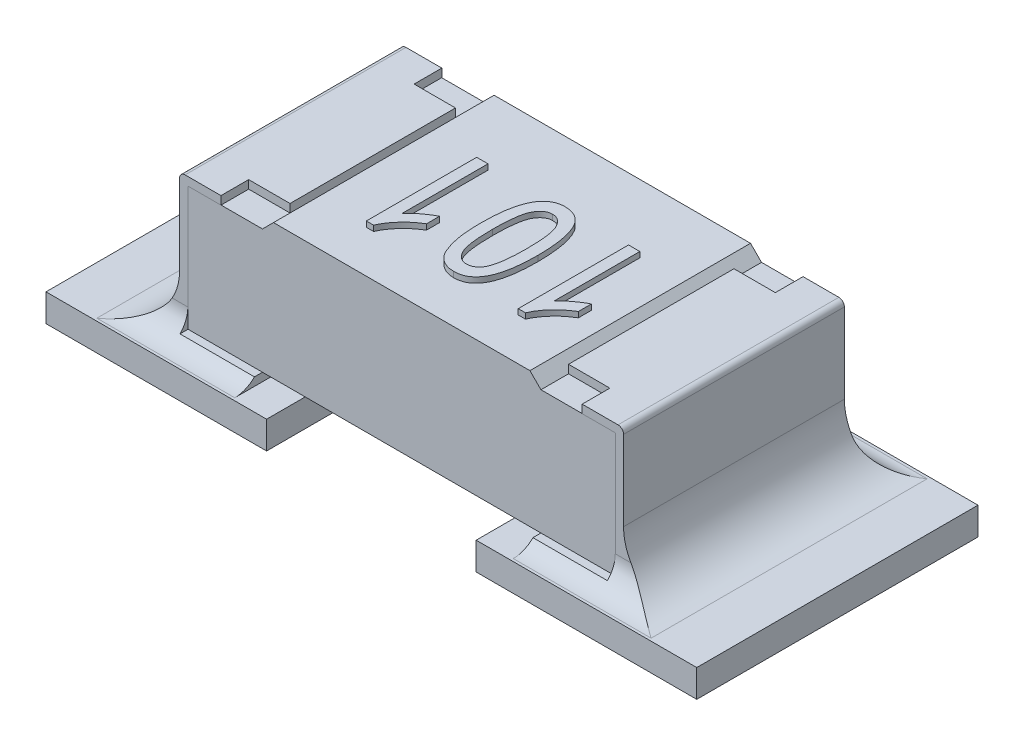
ISO-10303-21;
HEADER;
FILE_DESCRIPTION(('STEP AP214'),'2;1');
FILE_NAME('part.step','',(''),(''),'','','');
FILE_SCHEMA(('AUTOMOTIVE_DESIGN { 1 0 10303 214 1 1 1 1 }'));
ENDSEC;
DATA;
#1=APPLICATION_CONTEXT('core data for automotive mechanical design processes');
#2=APPLICATION_PROTOCOL_DEFINITION('international standard','automotive_design',2000,#1);
#3=PRODUCT_CONTEXT('',#1,'mechanical');
#4=PRODUCT('Part','Part','',(#3));
#5=PRODUCT_RELATED_PRODUCT_CATEGORY('part','',(#4));
#6=PRODUCT_DEFINITION_FORMATION('','',#4);
#7=PRODUCT_DEFINITION_CONTEXT('part definition',#1,'design');
#8=PRODUCT_DEFINITION('design','',#6,#7);
#9=PRODUCT_DEFINITION_SHAPE('','',#8);
#10=(LENGTH_UNIT() NAMED_UNIT(*) SI_UNIT(.MILLI.,.METRE.));
#11=(NAMED_UNIT(*) PLANE_ANGLE_UNIT() SI_UNIT($,.RADIAN.));
#12=(NAMED_UNIT(*) SI_UNIT($,.STERADIAN.) SOLID_ANGLE_UNIT());
#13=UNCERTAINTY_MEASURE_WITH_UNIT(LENGTH_MEASURE(1.E-05),#10,'distance_accuracy_value','');
#14=(GEOMETRIC_REPRESENTATION_CONTEXT(3) GLOBAL_UNCERTAINTY_ASSIGNED_CONTEXT((#13)) GLOBAL_UNIT_ASSIGNED_CONTEXT((#10,
#11,#12)) REPRESENTATION_CONTEXT('',''));
#15=CARTESIAN_POINT('',(0.,0.,0.));
#16=DIRECTION('',(0.,0.,1.));
#17=DIRECTION('',(1.,0.,0.));
#18=AXIS2_PLACEMENT_3D('',#15,#16,#17);
#19=CARTESIAN_POINT('',(-0.465,0.619999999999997,0.4));
#20=DIRECTION('',(0.,-1.,0.));
#21=DIRECTION('',(0.,0.,-1.));
#22=AXIS2_PLACEMENT_3D('',#19,#20,#21);
#23=PLANE('',#22);
#24=DIRECTION('',(-1.,0.,0.));
#25=VECTOR('',#24,1.);
#26=CARTESIAN_POINT('',(-0.255204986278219,0.619999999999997,0.246495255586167));
#27=LINE('',#26,#25);
#28=CARTESIAN_POINT('',(-0.255204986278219,0.619999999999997,0.246495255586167));
#29=VERTEX_POINT('',#28);
#30=CARTESIAN_POINT('',(-0.281647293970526,0.619999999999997,0.246495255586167));
#31=VERTEX_POINT('',#30);
#32=EDGE_CURVE('E521',#29,#31,#27,.T.);
#33=ORIENTED_EDGE('',*,*,#32,.T.);
#34=DIRECTION('',(0.,0.,-1.));
#35=VECTOR('',#34,1.);
#36=CARTESIAN_POINT('',(-0.281647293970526,0.619999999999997,0.246495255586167));
#37=LINE('',#36,#35);
#38=CARTESIAN_POINT('',(-0.281647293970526,0.619999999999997,-0.153504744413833));
#39=VERTEX_POINT('',#38);
#40=EDGE_CURVE('E503',#31,#39,#37,.T.);
#41=ORIENTED_EDGE('',*,*,#40,.T.);
#42=DIRECTION('',(1.,0.,0.));
#43=VECTOR('',#42,1.);
#44=CARTESIAN_POINT('',(-0.281647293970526,0.619999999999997,-0.153504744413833));
#45=LINE('',#44,#43);
#46=CARTESIAN_POINT('',(-0.240621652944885,0.619999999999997,-0.153504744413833));
#47=VERTEX_POINT('',#46);
#48=EDGE_CURVE('E514',#39,#47,#45,.T.);
#49=ORIENTED_EDGE('',*,*,#48,.T.);
#50=DIRECTION('',(0.,0.,1.));
#51=VECTOR('',#50,1.);
#52=CARTESIAN_POINT('',(-0.240621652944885,0.619999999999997,-0.153504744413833));
#53=LINE('',#52,#51);
#54=CARTESIAN_POINT('',(-0.240621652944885,0.619999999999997,0.158193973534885));
#55=VERTEX_POINT('',#54);
#56=EDGE_CURVE('E41',#47,#55,#53,.T.);
#57=ORIENTED_EDGE('',*,*,#56,.T.);
#58=CARTESIAN_POINT('',(-0.240621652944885,0.619999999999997,0.158193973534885));
#59=CARTESIAN_POINT('',(-0.238179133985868,0.619999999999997,0.155350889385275));
#60=CARTESIAN_POINT('',(-0.233126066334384,0.619999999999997,0.149469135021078));
#61=CARTESIAN_POINT('',(-0.224444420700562,0.619999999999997,0.141097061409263));
#62=CARTESIAN_POINT('',(-0.214792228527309,0.619999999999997,0.132612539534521));
#63=CARTESIAN_POINT('',(-0.204257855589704,0.619999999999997,0.124411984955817));
#64=CARTESIAN_POINT('',(-0.193501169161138,0.619999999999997,0.116741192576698));
#65=CARTESIAN_POINT('',(-0.183142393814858,0.619999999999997,0.109839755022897));
#66=CARTESIAN_POINT('',(-0.173334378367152,0.619999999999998,0.103961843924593));
#67=CARTESIAN_POINT('',(-0.166818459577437,0.619999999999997,0.100755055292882));
#68=CARTESIAN_POINT('',(-0.163698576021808,0.619999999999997,0.0992196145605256));
#69=B_SPLINE_CURVE_WITH_KNOTS('',3,(#58,#59,#60,#61,#62,#63,#64,#65,#66,#67,#68),.UNSPECIFIED.,
.F.,.F.,(4,1,1,1,1,1,1,1,4),(0.,0.115216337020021,0.238358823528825,0.370495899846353,
0.510333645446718,0.648696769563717,0.776733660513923,0.893097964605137,1.),.UNSPECIFIED.);
#70=CARTESIAN_POINT('',(-0.163698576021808,0.619999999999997,0.0992196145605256));
#71=VERTEX_POINT('',#70);
#72=EDGE_CURVE('E525',#55,#71,#69,.T.);
#73=ORIENTED_EDGE('',*,*,#72,.T.);
#74=DIRECTION('',(0.,0.,1.));
#75=VECTOR('',#74,1.);
#76=CARTESIAN_POINT('',(-0.163698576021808,0.619999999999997,0.0992196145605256));
#77=LINE('',#76,#75);
#78=CARTESIAN_POINT('',(-0.163698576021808,0.619999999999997,0.146495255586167));
#79=VERTEX_POINT('',#78);
#80=EDGE_CURVE('E530',#71,#79,#77,.T.);
#81=ORIENTED_EDGE('',*,*,#80,.T.);
#82=CARTESIAN_POINT('',(-0.163698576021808,0.619999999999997,0.146495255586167));
#83=CARTESIAN_POINT('',(-0.169015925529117,0.619999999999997,0.149805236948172));
#84=CARTESIAN_POINT('',(-0.179564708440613,0.619999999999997,0.156371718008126));
#85=CARTESIAN_POINT('',(-0.194340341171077,0.619999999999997,0.1676277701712));
#86=CARTESIAN_POINT('',(-0.208182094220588,0.619999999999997,0.179766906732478));
#87=CARTESIAN_POINT('',(-0.220680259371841,0.619999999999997,0.192930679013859));
#88=CARTESIAN_POINT('',(-0.231895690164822,0.619999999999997,0.206381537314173));
#89=CARTESIAN_POINT('',(-0.241471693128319,0.619999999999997,0.219831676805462));
#90=CARTESIAN_POINT('',(-0.249309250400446,0.619999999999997,0.233088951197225));
#91=CARTESIAN_POINT('',(-0.253284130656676,0.619999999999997,0.242127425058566));
#92=CARTESIAN_POINT('',(-0.255204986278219,0.619999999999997,0.246495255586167));
#93=B_SPLINE_CURVE_WITH_KNOTS('',3,(#82,#83,#84,#85,#86,#87,#88,#89,#90,#91,#92),.UNSPECIFIED.,
.F.,.F.,(4,1,1,1,1,1,1,1,4),(0.,0.13634120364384,0.270479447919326,0.403999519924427,
0.536885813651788,0.665360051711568,0.78511591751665,0.896157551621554,1.),.UNSPECIFIED.);
#94=EDGE_CURVE('E536',#79,#29,#93,.T.);
#95=ORIENTED_EDGE('',*,*,#94,.T.);
#96=EDGE_LOOP('',(#33,#41,#49,#57,#73,#81,#95));
#97=FACE_BOUND('',#96,.T.);
#98=CARTESIAN_POINT('',(0.0347629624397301,0.619999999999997,-0.158632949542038));
#99=CARTESIAN_POINT('',(0.0384549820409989,0.619999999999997,-0.158499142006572));
#100=CARTESIAN_POINT('',(0.0456948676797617,0.619999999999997,-0.15823675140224));
#101=CARTESIAN_POINT('',(0.0562689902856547,0.619999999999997,-0.156490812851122));
#102=CARTESIAN_POINT('',(0.06618062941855,0.619999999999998,-0.153395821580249));
#103=CARTESIAN_POINT('',(0.075535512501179,0.619999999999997,-0.149215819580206));
#104=CARTESIAN_POINT('',(0.0842293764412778,0.619999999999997,-0.143715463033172));
#105=CARTESIAN_POINT('',(0.0922591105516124,0.619999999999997,-0.136993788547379));
#106=CARTESIAN_POINT('',(0.0997629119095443,0.619999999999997,-0.129152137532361));
#107=CARTESIAN_POINT('',(0.104039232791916,0.619999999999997,-0.12316748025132));
#108=CARTESIAN_POINT('',(0.106237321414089,0.619999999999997,-0.120091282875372));
#109=B_SPLINE_CURVE_WITH_KNOTS('',3,(#98,#99,#100,#101,#102,#103,#104,#105,#106,#107,#108),
.UNSPECIFIED.,.F.,.F.,(4,1,1,1,1,1,1,1,4),(0.,0.130569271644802,0.256040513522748,
0.377640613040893,0.496854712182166,0.617404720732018,0.740158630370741,0.866437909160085,1.),.UNSPECIFIED.);
#110=CARTESIAN_POINT('',(0.0347629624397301,0.619999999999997,-0.158632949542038));
#111=VERTEX_POINT('',#110);
#112=CARTESIAN_POINT('',(0.106237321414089,0.619999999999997,-0.120091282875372));
#113=VERTEX_POINT('',#112);
#114=EDGE_CURVE('E638',#111,#113,#109,.T.);
#115=ORIENTED_EDGE('',*,*,#114,.T.);
#116=CARTESIAN_POINT('',(0.106237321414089,0.619999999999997,-0.120091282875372));
#117=CARTESIAN_POINT('',(0.108768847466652,0.619999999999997,-0.115492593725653));
#118=CARTESIAN_POINT('',(0.11404873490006,0.619999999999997,-0.105901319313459));
#119=CARTESIAN_POINT('',(0.120233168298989,0.619999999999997,-0.0899379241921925));
#120=CARTESIAN_POINT('',(0.125490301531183,0.619999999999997,-0.0721821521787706));
#121=CARTESIAN_POINT('',(0.129905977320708,0.619999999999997,-0.0525939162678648));
#122=CARTESIAN_POINT('',(0.133147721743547,0.619999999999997,-0.0311091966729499));
#123=CARTESIAN_POINT('',(0.13566325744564,0.619999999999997,-0.00780190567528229));
#124=CARTESIAN_POINT('',(0.137065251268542,0.619999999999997,0.0173647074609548));
#125=CARTESIAN_POINT('',(0.137237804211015,0.619999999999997,0.0347681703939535));
#126=CARTESIAN_POINT('',(0.137327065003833,0.619999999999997,0.0437708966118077));
#127=B_SPLINE_CURVE_WITH_KNOTS('',3,(#116,#117,#118,#119,#120,#121,#122,#123,#124,#125,#126),
.UNSPECIFIED.,.F.,.F.,(4,1,1,1,1,1,1,1,4),(0.,0.0933338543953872,0.194662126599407,
0.303837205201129,0.422725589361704,0.551666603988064,0.690295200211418,0.839791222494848,1.),.UNSPECIFIED.);
#128=CARTESIAN_POINT('',(0.137327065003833,0.619999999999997,0.0437708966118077));
#129=VERTEX_POINT('',#128);
#130=EDGE_CURVE('E611',#113,#129,#127,.T.);
#131=ORIENTED_EDGE('',*,*,#130,.T.);
#132=CARTESIAN_POINT('',(0.137327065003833,0.619999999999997,0.0437708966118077));
#133=CARTESIAN_POINT('',(0.137305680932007,0.619999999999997,0.0494873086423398));
#134=CARTESIAN_POINT('',(0.137263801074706,0.619999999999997,0.0606826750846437));
#135=CARTESIAN_POINT('',(0.136662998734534,0.619999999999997,0.0770582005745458));
#136=CARTESIAN_POINT('',(0.135834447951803,0.619999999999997,0.0926129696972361));
#137=CARTESIAN_POINT('',(0.134523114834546,0.619999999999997,0.107331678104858));
#138=CARTESIAN_POINT('',(0.132945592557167,0.619999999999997,0.121228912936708));
#139=CARTESIAN_POINT('',(0.131043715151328,0.619999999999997,0.134332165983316));
#140=CARTESIAN_POINT('',(0.12874079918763,0.619999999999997,0.146609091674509));
#141=CARTESIAN_POINT('',(0.125985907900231,0.619999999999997,0.158091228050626));
#142=CARTESIAN_POINT('',(0.122994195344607,0.619999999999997,0.168866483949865));
#143=CARTESIAN_POINT('',(0.119497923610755,0.619999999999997,0.178860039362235));
#144=CARTESIAN_POINT('',(0.115872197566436,0.619999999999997,0.18825641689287));
#145=CARTESIAN_POINT('',(0.111694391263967,0.619999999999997,0.196839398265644));
#146=CARTESIAN_POINT('',(0.107254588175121,0.619999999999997,0.204803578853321));
#147=CARTESIAN_POINT('',(0.102508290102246,0.619999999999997,0.212073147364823));
#148=CARTESIAN_POINT('',(0.0973170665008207,0.619999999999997,0.218602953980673));
#149=CARTESIAN_POINT('',(0.0918866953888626,0.619999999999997,0.224512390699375));
#150=CARTESIAN_POINT('',(0.0859842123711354,0.619999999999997,0.229670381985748));
#151=CARTESIAN_POINT('',(0.0797166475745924,0.619999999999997,0.234149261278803));
#152=CARTESIAN_POINT('',(0.0731611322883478,0.619999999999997,0.238051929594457));
#153=CARTESIAN_POINT('',(0.0661688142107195,0.619999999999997,0.241092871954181));
#154=CARTESIAN_POINT('',(0.0588455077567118,0.619999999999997,0.243506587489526));
#155=CARTESIAN_POINT('',(0.0511503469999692,0.619999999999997,0.245265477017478));
#156=CARTESIAN_POINT('',(0.0430733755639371,0.619999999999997,0.246339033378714));
#157=CARTESIAN_POINT('',(0.0375708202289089,0.619999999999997,0.246442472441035));
#158=CARTESIAN_POINT('',(0.0347629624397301,0.619999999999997,0.246495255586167));
#159=B_SPLINE_CURVE_WITH_KNOTS('',3,(#132,#133,#134,#135,#136,#137,#138,#139,#140,#141,#142,
#143,#144,#145,#146,#147,#148,#149,#150,#151,#152,#153,#154,#155,#156,#157,#158),.UNSPECIFIED.,
.F.,.F.,(4,1,1,1,1,1,1,1,1,1,1,1,1,1,1,1,1,1,1,1,1,1,1,1,4),(0.,0.0676683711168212,
0.132525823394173,0.193965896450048,0.252050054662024,0.307429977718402,0.359525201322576,
0.408764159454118,0.455240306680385,0.499280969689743,0.541078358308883,0.580535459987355,
0.618436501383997,0.653969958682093,0.688435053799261,0.721076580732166,0.75262154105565,
0.783318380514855,0.813679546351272,0.843722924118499,0.87345184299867,0.903748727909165,
0.934890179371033,0.966775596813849,1.),.UNSPECIFIED.);
#160=CARTESIAN_POINT('',(0.0347629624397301,0.619999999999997,0.246495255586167));
#161=VERTEX_POINT('',#160);
#162=EDGE_CURVE('E616',#129,#161,#159,.T.);
#163=ORIENTED_EDGE('',*,*,#162,.T.);
#164=CARTESIAN_POINT('',(0.0347629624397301,0.619999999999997,0.246495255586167));
#165=CARTESIAN_POINT('',(0.030638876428,0.619999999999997,0.246342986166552));
#166=CARTESIAN_POINT('',(0.0225054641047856,0.619999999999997,0.246042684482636));
#167=CARTESIAN_POINT('',(0.0106280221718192,0.619999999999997,0.243609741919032));
#168=CARTESIAN_POINT('',(-0.000550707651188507,0.619999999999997,0.239419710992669));
#169=CARTESIAN_POINT('',(-0.0110930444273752,0.619999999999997,0.233841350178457));
#170=CARTESIAN_POINT('',(-0.0207199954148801,0.619999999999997,0.226669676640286));
#171=CARTESIAN_POINT('',(-0.0293599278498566,0.619999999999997,0.218094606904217));
#172=CARTESIAN_POINT('',(-0.036644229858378,0.619999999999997,0.20793914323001));
#173=CARTESIAN_POINT('',(-0.0428209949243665,0.619999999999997,0.19641878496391));
#174=CARTESIAN_POINT('',(-0.0480250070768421,0.619999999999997,0.183534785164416));
#175=CARTESIAN_POINT('',(-0.0528151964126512,0.619999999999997,0.169429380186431));
#176=CARTESIAN_POINT('',(-0.0571487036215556,0.619999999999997,0.154002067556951));
#177=CARTESIAN_POINT('',(-0.06020904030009,0.619999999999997,0.140213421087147));
#178=CARTESIAN_POINT('',(-0.0624631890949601,0.619999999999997,0.128311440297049));
#179=CARTESIAN_POINT('',(-0.0638804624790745,0.619999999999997,0.118471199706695));
#180=CARTESIAN_POINT('',(-0.0650491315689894,0.619999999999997,0.107857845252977));
#181=CARTESIAN_POINT('',(-0.0661368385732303,0.619999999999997,0.0965107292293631));
#182=CARTESIAN_POINT('',(-0.0667927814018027,0.619999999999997,0.0843998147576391));
#183=CARTESIAN_POINT('',(-0.0673542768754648,0.619999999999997,0.0715523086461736));
#184=CARTESIAN_POINT('',(-0.0678025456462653,0.619999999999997,0.0579299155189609));
#185=CARTESIAN_POINT('',(-0.0678016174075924,0.619999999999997,0.0485789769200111));
#186=CARTESIAN_POINT('',(-0.0678011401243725,0.619999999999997,0.0437708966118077));
#187=B_SPLINE_CURVE_WITH_KNOTS('',3,(#164,#165,#166,#167,#168,#169,#170,#171,#172,#173,#174,
#175,#176,#177,#178,#179,#180,#181,#182,#183,#184,#185,#186),.UNSPECIFIED.,.F.,.F.,(4,1,1,1,1,1,
1,1,1,1,1,1,1,1,1,1,1,1,1,1,4),(0.,0.0487840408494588,0.0962105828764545,0.14271799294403,
0.189670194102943,0.236898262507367,0.284285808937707,0.33316193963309,0.384224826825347,
0.438645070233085,0.497425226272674,0.56047387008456,0.628191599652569,0.664524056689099,
0.703820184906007,0.745815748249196,0.79089161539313,0.838709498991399,0.889336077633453,
0.943098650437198,1.),.UNSPECIFIED.);
#188=CARTESIAN_POINT('',(-0.0678011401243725,0.619999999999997,0.0437708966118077));
#189=VERTEX_POINT('',#188);
#190=EDGE_CURVE('E49',#161,#189,#187,.T.);
#191=ORIENTED_EDGE('',*,*,#190,.T.);
#192=CARTESIAN_POINT('',(-0.0678011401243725,0.619999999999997,0.0437708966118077));
#193=CARTESIAN_POINT('',(-0.0677791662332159,0.619999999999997,0.0380812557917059));
#194=CARTESIAN_POINT('',(-0.067736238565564,0.619999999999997,0.0269661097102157));
#195=CARTESIAN_POINT('',(-0.0671470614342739,0.619999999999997,0.01072310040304));
#196=CARTESIAN_POINT('',(-0.0662721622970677,0.619999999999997,-0.00471888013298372));
#197=CARTESIAN_POINT('',(-0.0651031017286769,0.619999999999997,-0.0193667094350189));
#198=CARTESIAN_POINT('',(-0.0635134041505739,0.619999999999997,-0.0332395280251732));
#199=CARTESIAN_POINT('',(-0.0615041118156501,0.619999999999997,-0.0463043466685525));
#200=CARTESIAN_POINT('',(-0.0591875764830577,0.619999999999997,-0.0585730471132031));
#201=CARTESIAN_POINT('',(-0.0565850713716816,0.619999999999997,-0.0700604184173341));
#202=CARTESIAN_POINT('',(-0.0535034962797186,0.619999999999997,-0.0807675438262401));
#203=CARTESIAN_POINT('',(-0.0501428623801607,0.619999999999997,-0.0907962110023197));
#204=CARTESIAN_POINT('',(-0.0465157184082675,0.619999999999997,-0.100171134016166));
#205=CARTESIAN_POINT('',(-0.0424014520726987,0.619999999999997,-0.108814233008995));
#206=CARTESIAN_POINT('',(-0.0378877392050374,0.619999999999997,-0.116721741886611));
#207=CARTESIAN_POINT('',(-0.0332042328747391,0.619999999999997,-0.124077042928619));
#208=CARTESIAN_POINT('',(-0.0280610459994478,0.619999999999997,-0.130684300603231));
#209=CARTESIAN_POINT('',(-0.0224937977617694,0.619999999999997,-0.136543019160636));
#210=CARTESIAN_POINT('',(-0.0166535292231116,0.619999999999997,-0.141782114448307));
#211=CARTESIAN_POINT('',(-0.0104437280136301,0.619999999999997,-0.146326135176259));
#212=CARTESIAN_POINT('',(-0.0038116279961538,0.619999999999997,-0.150092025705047));
#213=CARTESIAN_POINT('',(0.00317446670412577,0.619999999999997,-0.153257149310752));
#214=CARTESIAN_POINT('',(0.010581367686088,0.619999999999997,-0.155622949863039));
#215=CARTESIAN_POINT('',(0.0183193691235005,0.619999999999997,-0.157415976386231));
#216=CARTESIAN_POINT('',(0.0264270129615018,0.619999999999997,-0.158470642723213));
#217=CARTESIAN_POINT('',(0.03195542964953,0.619999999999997,-0.158578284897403));
#218=CARTESIAN_POINT('',(0.0347629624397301,0.619999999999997,-0.158632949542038));
#219=B_SPLINE_CURVE_WITH_KNOTS('',3,(#192,#193,#194,#195,#196,#197,#198,#199,#200,#201,#202,
#203,#204,#205,#206,#207,#208,#209,#210,#211,#212,#213,#214,#215,#216,#217,#218),.UNSPECIFIED.,
.F.,.F.,(4,1,1,1,1,1,1,1,1,1,1,1,1,1,1,1,1,1,1,1,1,1,1,1,4),(0.,0.0674149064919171,
0.131700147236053,0.192565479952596,0.250677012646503,0.305794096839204,0.357984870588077,
0.407269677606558,0.453716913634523,0.497494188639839,0.539228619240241,0.579016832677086,
0.616531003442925,0.652528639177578,0.686852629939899,0.719773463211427,0.751564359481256,
0.782499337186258,0.81263224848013,0.842544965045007,0.87271939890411,0.903345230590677,
0.934515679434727,0.966744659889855,1.),.UNSPECIFIED.);
#220=EDGE_CURVE('E630',#189,#111,#219,.T.);
#221=ORIENTED_EDGE('',*,*,#220,.T.);
#222=EDGE_LOOP('',(#115,#131,#163,#191,#221));
#223=FACE_BOUND('',#222,.T.);
#224=DIRECTION('',(-1.,0.,0.));
#225=VECTOR('',#224,1.);
#226=CARTESIAN_POINT('',(-0.465,0.619999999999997,-0.4));
#227=LINE('',#226,#225);
#228=CARTESIAN_POINT('',(0.465,0.619999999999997,-0.4));
#229=VERTEX_POINT('',#228);
#230=CARTESIAN_POINT('',(-0.465,0.619999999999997,-0.4));
#231=VERTEX_POINT('',#230);
#232=EDGE_CURVE('E782',#229,#231,#227,.T.);
#233=ORIENTED_EDGE('',*,*,#232,.T.);
#234=DIRECTION('',(0.,0.,-1.));
#235=VECTOR('',#234,1.);
#236=CARTESIAN_POINT('',(-0.465,0.619999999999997,0.4));
#237=LINE('',#236,#235);
#238=CARTESIAN_POINT('',(-0.465,0.619999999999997,0.4));
#239=VERTEX_POINT('',#238);
#240=EDGE_CURVE('E797',#239,#231,#237,.T.);
#241=ORIENTED_EDGE('',*,*,#240,.F.);
#242=DIRECTION('',(-1.,0.,0.));
#243=VECTOR('',#242,1.);
#244=CARTESIAN_POINT('',(-0.465,0.619999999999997,0.4));
#245=LINE('',#244,#243);
#246=CARTESIAN_POINT('',(0.465,0.619999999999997,0.4));
#247=VERTEX_POINT('',#246);
#248=EDGE_CURVE('E789',#247,#239,#245,.T.);
#249=ORIENTED_EDGE('',*,*,#248,.F.);
#250=DIRECTION('',(0.,0.,-1.));
#251=VECTOR('',#250,1.);
#252=CARTESIAN_POINT('',(0.465,0.619999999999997,0.4));
#253=LINE('',#252,#251);
#254=EDGE_CURVE('E800',#247,#229,#253,.T.);
#255=ORIENTED_EDGE('',*,*,#254,.T.);
#256=EDGE_LOOP('',(#233,#241,#249,#255));
#257=FACE_BOUND('',#256,.T.);
#258=DIRECTION('',(-1.,0.,0.));
#259=VECTOR('',#258,1.);
#260=CARTESIAN_POINT('',(0.295564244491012,0.619999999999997,0.246495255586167));
#261=LINE('',#260,#259);
#262=CARTESIAN_POINT('',(0.295564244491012,0.619999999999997,0.246495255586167));
#263=VERTEX_POINT('',#262);
#264=CARTESIAN_POINT('',(0.269121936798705,0.619999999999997,0.246495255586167));
#265=VERTEX_POINT('',#264);
#266=EDGE_CURVE('E1149',#263,#265,#261,.T.);
#267=ORIENTED_EDGE('',*,*,#266,.T.);
#268=DIRECTION('',(0.,0.,-1.));
#269=VECTOR('',#268,1.);
#270=CARTESIAN_POINT('',(0.269121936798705,0.619999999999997,0.246495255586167));
#271=LINE('',#270,#269);
#272=CARTESIAN_POINT('',(0.269121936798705,0.619999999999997,-0.153504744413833));
#273=VERTEX_POINT('',#272);
#274=EDGE_CURVE('E1177',#265,#273,#271,.T.);
#275=ORIENTED_EDGE('',*,*,#274,.T.);
#276=DIRECTION('',(1.,0.,0.));
#277=VECTOR('',#276,1.);
#278=CARTESIAN_POINT('',(0.269121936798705,0.619999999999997,-0.153504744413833));
#279=LINE('',#278,#277);
#280=CARTESIAN_POINT('',(0.310147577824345,0.619999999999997,-0.153504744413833));
#281=VERTEX_POINT('',#280);
#282=EDGE_CURVE('E1174',#273,#281,#279,.T.);
#283=ORIENTED_EDGE('',*,*,#282,.T.);
#284=DIRECTION('',(0.,0.,1.));
#285=VECTOR('',#284,1.);
#286=CARTESIAN_POINT('',(0.310147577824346,0.619999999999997,-0.153504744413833));
#287=LINE('',#286,#285);
#288=CARTESIAN_POINT('',(0.310147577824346,0.619999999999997,0.158193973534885));
#289=VERTEX_POINT('',#288);
#290=EDGE_CURVE('E1168',#281,#289,#287,.T.);
#291=ORIENTED_EDGE('',*,*,#290,.T.);
#292=CARTESIAN_POINT('',(0.310147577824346,0.619999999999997,0.158193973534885));
#293=CARTESIAN_POINT('',(0.312590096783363,0.619999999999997,0.155350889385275));
#294=CARTESIAN_POINT('',(0.317643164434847,0.619999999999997,0.149469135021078));
#295=CARTESIAN_POINT('',(0.326324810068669,0.619999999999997,0.141097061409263));
#296=CARTESIAN_POINT('',(0.335977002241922,0.619999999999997,0.132612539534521));
#297=CARTESIAN_POINT('',(0.346511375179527,0.619999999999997,0.124411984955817));
#298=CARTESIAN_POINT('',(0.357268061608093,0.619999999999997,0.116741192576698));
#299=CARTESIAN_POINT('',(0.367626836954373,0.619999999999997,0.109839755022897));
#300=CARTESIAN_POINT('',(0.377434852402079,0.619999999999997,0.103961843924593));
#301=CARTESIAN_POINT('',(0.383950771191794,0.619999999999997,0.100755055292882));
#302=CARTESIAN_POINT('',(0.387070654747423,0.619999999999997,0.0992196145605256));
#303=B_SPLINE_CURVE_WITH_KNOTS('',3,(#292,#293,#294,#295,#296,#297,#298,#299,#300,#301,#302),
.UNSPECIFIED.,.F.,.F.,(4,1,1,1,1,1,1,1,4),(0.,0.115216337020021,0.238358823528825,
0.370495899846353,0.510333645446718,0.648696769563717,0.776733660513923,0.893097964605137,1.),.UNSPECIFIED.);
#304=CARTESIAN_POINT('',(0.387070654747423,0.619999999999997,0.0992196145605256));
#305=VERTEX_POINT('',#304);
#306=EDGE_CURVE('E1163',#289,#305,#303,.T.);
#307=ORIENTED_EDGE('',*,*,#306,.T.);
#308=DIRECTION('',(0.,0.,1.));
#309=VECTOR('',#308,1.);
#310=CARTESIAN_POINT('',(0.387070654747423,0.619999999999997,0.0992196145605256));
#311=LINE('',#310,#309);
#312=CARTESIAN_POINT('',(0.387070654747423,0.619999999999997,0.146495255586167));
#313=VERTEX_POINT('',#312);
#314=EDGE_CURVE('E1157',#305,#313,#311,.T.);
#315=ORIENTED_EDGE('',*,*,#314,.T.);
#316=CARTESIAN_POINT('',(0.387070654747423,0.619999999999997,0.146495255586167));
#317=CARTESIAN_POINT('',(0.381753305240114,0.619999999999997,0.149805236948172));
#318=CARTESIAN_POINT('',(0.371204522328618,0.619999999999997,0.156371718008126));
#319=CARTESIAN_POINT('',(0.356428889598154,0.619999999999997,0.1676277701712));
#320=CARTESIAN_POINT('',(0.342587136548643,0.619999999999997,0.179766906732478));
#321=CARTESIAN_POINT('',(0.33008897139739,0.619999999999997,0.192930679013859));
#322=CARTESIAN_POINT('',(0.318873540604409,0.619999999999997,0.206381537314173));
#323=CARTESIAN_POINT('',(0.309297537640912,0.619999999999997,0.219831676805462));
#324=CARTESIAN_POINT('',(0.301459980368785,0.619999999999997,0.233088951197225));
#325=CARTESIAN_POINT('',(0.297485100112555,0.619999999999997,0.242127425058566));
#326=CARTESIAN_POINT('',(0.295564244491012,0.619999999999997,0.246495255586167));
#327=B_SPLINE_CURVE_WITH_KNOTS('',3,(#316,#317,#318,#319,#320,#321,#322,#323,#324,#325,#326),
.UNSPECIFIED.,.F.,.F.,(4,1,1,1,1,1,1,1,4),(0.,0.136341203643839,0.270479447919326,
0.403999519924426,0.536885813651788,0.665360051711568,0.78511591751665,0.896157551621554,1.),.UNSPECIFIED.);
#328=EDGE_CURVE('E1152',#313,#263,#327,.T.);
#329=ORIENTED_EDGE('',*,*,#328,.T.);
#330=EDGE_LOOP('',(#267,#275,#283,#291,#307,#315,#329));
#331=FACE_BOUND('',#330,.T.);
#332=ADVANCED_FACE('F26',(#97,#223,#257,#331),#23,.F.);
#333=CARTESIAN_POINT('',(0.775,0.579999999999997,0.4));
#334=DIRECTION('',(0.,-1.,0.));
#335=DIRECTION('',(0.,0.,-1.));
#336=AXIS2_PLACEMENT_3D('',#333,#334,#335);
#337=PLANE('',#336);
#338=DIRECTION('',(0.,0.,-1.));
#339=VECTOR('',#338,1.);
#340=CARTESIAN_POINT('',(0.505,0.579999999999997,0.4));
#341=LINE('',#340,#339);
#342=CARTESIAN_POINT('',(0.505,0.579999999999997,0.4));
#343=VERTEX_POINT('',#342);
#344=CARTESIAN_POINT('',(0.505,0.579999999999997,0.3));
#345=VERTEX_POINT('',#344);
#346=EDGE_CURVE('E804',#343,#345,#341,.T.);
#347=ORIENTED_EDGE('',*,*,#346,.F.);
#348=DIRECTION('',(-1.,0.,0.));
#349=VECTOR('',#348,1.);
#350=CARTESIAN_POINT('',(0.775,0.579999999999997,0.4));
#351=LINE('',#350,#349);
#352=CARTESIAN_POINT('',(0.655,0.579999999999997,0.4));
#353=VERTEX_POINT('',#352);
#354=EDGE_CURVE('E999',#353,#343,#351,.T.);
#355=ORIENTED_EDGE('',*,*,#354,.F.);
#356=DIRECTION('',(0.,0.,-1.));
#357=VECTOR('',#356,1.);
#358=CARTESIAN_POINT('',(0.655,0.579999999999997,0.5));
#359=LINE('',#358,#357);
#360=CARTESIAN_POINT('',(0.655,0.579999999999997,0.3));
#361=VERTEX_POINT('',#360);
#362=EDGE_CURVE('E827',#353,#361,#359,.T.);
#363=ORIENTED_EDGE('',*,*,#362,.T.);
#364=DIRECTION('',(-1.,0.,0.));
#365=VECTOR('',#364,1.);
#366=CARTESIAN_POINT('',(0.505,0.579999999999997,0.3));
#367=LINE('',#366,#365);
#368=EDGE_CURVE('E830',#361,#345,#367,.T.);
#369=ORIENTED_EDGE('',*,*,#368,.T.);
#370=EDGE_LOOP('',(#347,#355,#363,#369));
#371=FACE_BOUND('',#370,.T.);
#372=ADVANCED_FACE('F1238',(#371),#337,.F.);
#373=CARTESIAN_POINT('',(0.505,0.579999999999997,-0.3));
#374=VERTEX_POINT('',#373);
#375=CARTESIAN_POINT('',(0.505,0.579999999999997,-0.4));
#376=VERTEX_POINT('',#375);
#377=EDGE_CURVE('E803',#374,#376,#341,.T.);
#378=ORIENTED_EDGE('',*,*,#377,.F.);
#379=DIRECTION('',(1.,0.,0.));
#380=VECTOR('',#379,1.);
#381=CARTESIAN_POINT('',(0.505,0.579999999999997,-0.3));
#382=LINE('',#381,#380);
#383=CARTESIAN_POINT('',(0.655,0.579999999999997,-0.3));
#384=VERTEX_POINT('',#383);
#385=EDGE_CURVE('E844',#374,#384,#382,.T.);
#386=ORIENTED_EDGE('',*,*,#385,.T.);
#387=DIRECTION('',(0.,0.,-1.));
#388=VECTOR('',#387,1.);
#389=CARTESIAN_POINT('',(0.655,0.579999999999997,-0.5));
#390=LINE('',#389,#388);
#391=CARTESIAN_POINT('',(0.655,0.579999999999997,-0.4));
#392=VERTEX_POINT('',#391);
#393=EDGE_CURVE('E848',#384,#392,#390,.T.);
#394=ORIENTED_EDGE('',*,*,#393,.T.);
#395=DIRECTION('',(-1.,0.,0.));
#396=VECTOR('',#395,1.);
#397=CARTESIAN_POINT('',(0.775,0.579999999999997,-0.4));
#398=LINE('',#397,#396);
#399=EDGE_CURVE('E973',#392,#376,#398,.T.);
#400=ORIENTED_EDGE('',*,*,#399,.T.);
#401=EDGE_LOOP('',(#378,#386,#394,#400));
#402=FACE_BOUND('',#401,.T.);
#403=ADVANCED_FACE('F1777',(#402),#337,.F.);
#404=DIRECTION('',(0.,0.,-1.));
#405=VECTOR('',#404,1.);
#406=CARTESIAN_POINT('',(-0.505,0.579999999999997,0.4));
#407=LINE('',#406,#405);
#408=CARTESIAN_POINT('',(-0.505,0.579999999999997,-0.3));
#409=VERTEX_POINT('',#408);
#410=CARTESIAN_POINT('',(-0.505,0.579999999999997,-0.4));
#411=VERTEX_POINT('',#410);
#412=EDGE_CURVE('E794',#409,#411,#407,.T.);
#413=ORIENTED_EDGE('',*,*,#412,.T.);
#414=CARTESIAN_POINT('',(-0.655,0.579999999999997,-0.4));
#415=VERTEX_POINT('',#414);
#416=EDGE_CURVE('E976',#411,#415,#398,.T.);
#417=ORIENTED_EDGE('',*,*,#416,.T.);
#418=DIRECTION('',(0.,0.,1.));
#419=VECTOR('',#418,1.);
#420=CARTESIAN_POINT('',(-0.655,0.579999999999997,-0.5));
#421=LINE('',#420,#419);
#422=CARTESIAN_POINT('',(-0.655,0.579999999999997,-0.3));
#423=VERTEX_POINT('',#422);
#424=EDGE_CURVE('E861',#415,#423,#421,.T.);
#425=ORIENTED_EDGE('',*,*,#424,.T.);
#426=DIRECTION('',(1.,0.,0.));
#427=VECTOR('',#426,1.);
#428=CARTESIAN_POINT('',(-0.505,0.579999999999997,-0.3));
#429=LINE('',#428,#427);
#430=EDGE_CURVE('E864',#423,#409,#429,.T.);
#431=ORIENTED_EDGE('',*,*,#430,.T.);
#432=EDGE_LOOP('',(#413,#417,#425,#431));
#433=FACE_BOUND('',#432,.T.);
#434=ADVANCED_FACE('F1789',(#433),#337,.F.);
#435=CARTESIAN_POINT('',(-0.505,0.579999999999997,0.4));
#436=VERTEX_POINT('',#435);
#437=CARTESIAN_POINT('',(-0.505,0.579999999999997,0.3));
#438=VERTEX_POINT('',#437);
#439=EDGE_CURVE('E795',#436,#438,#407,.T.);
#440=ORIENTED_EDGE('',*,*,#439,.T.);
#441=DIRECTION('',(-1.,0.,0.));
#442=VECTOR('',#441,1.);
#443=CARTESIAN_POINT('',(-0.505,0.579999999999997,0.3));
#444=LINE('',#443,#442);
#445=CARTESIAN_POINT('',(-0.655,0.579999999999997,0.3));
#446=VERTEX_POINT('',#445);
#447=EDGE_CURVE('E812',#438,#446,#444,.T.);
#448=ORIENTED_EDGE('',*,*,#447,.T.);
#449=DIRECTION('',(0.,0.,1.));
#450=VECTOR('',#449,1.);
#451=CARTESIAN_POINT('',(-0.655,0.579999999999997,0.5));
#452=LINE('',#451,#450);
#453=CARTESIAN_POINT('',(-0.655,0.579999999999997,0.4));
#454=VERTEX_POINT('',#453);
#455=EDGE_CURVE('E816',#446,#454,#452,.T.);
#456=ORIENTED_EDGE('',*,*,#455,.T.);
#457=EDGE_CURVE('E994',#436,#454,#351,.T.);
#458=ORIENTED_EDGE('',*,*,#457,.F.);
#459=EDGE_LOOP('',(#440,#448,#456,#458));
#460=FACE_BOUND('',#459,.T.);
#461=ADVANCED_FACE('F1779',(#460),#337,.F.);
#462=CARTESIAN_POINT('',(0.775,0.13,0.399999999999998));
#463=DIRECTION('',(0.,1.,0.));
#464=DIRECTION('',(0.,0.,1.));
#465=AXIS2_PLACEMENT_3D('',#462,#463,#464);
#466=PLANE('',#465);
#467=DIRECTION('',(0.,0.,-1.));
#468=VECTOR('',#467,1.);
#469=CARTESIAN_POINT('',(0.505,0.13,0.4005));
#470=LINE('',#469,#468);
#471=CARTESIAN_POINT('',(0.505,0.13,0.399999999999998));
#472=VERTEX_POINT('',#471);
#473=CARTESIAN_POINT('',(0.505,0.13,-0.399999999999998));
#474=VERTEX_POINT('',#473);
#475=EDGE_CURVE('E904',#472,#474,#470,.T.);
#476=ORIENTED_EDGE('',*,*,#475,.F.);
#477=DIRECTION('',(-1.,0.,0.));
#478=VECTOR('',#477,1.);
#479=CARTESIAN_POINT('',(0.775,0.13,0.399999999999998));
#480=LINE('',#479,#478);
#481=CARTESIAN_POINT('',(-0.504999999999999,0.13,0.399999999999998));
#482=VERTEX_POINT('',#481);
#483=EDGE_CURVE('E1006',#472,#482,#480,.T.);
#484=ORIENTED_EDGE('',*,*,#483,.T.);
#485=DIRECTION('',(0.,0.,-1.));
#486=VECTOR('',#485,1.);
#487=CARTESIAN_POINT('',(-0.505,0.13,0.4005));
#488=LINE('',#487,#486);
#489=CARTESIAN_POINT('',(-0.504999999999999,0.13,-0.399999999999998));
#490=VERTEX_POINT('',#489);
#491=EDGE_CURVE('E964',#482,#490,#488,.T.);
#492=ORIENTED_EDGE('',*,*,#491,.T.);
#493=DIRECTION('',(-1.,0.,0.));
#494=VECTOR('',#493,1.);
#495=CARTESIAN_POINT('',(0.775,0.13,-0.399999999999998));
#496=LINE('',#495,#494);
#497=EDGE_CURVE('E1002',#474,#490,#496,.T.);
#498=ORIENTED_EDGE('',*,*,#497,.F.);
#499=EDGE_LOOP('',(#476,#484,#492,#498));
#500=FACE_BOUND('',#499,.T.);
#501=ADVANCED_FACE('F1782',(#500),#466,.F.);
#502=CARTESIAN_POINT('',(0.775,0.579999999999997,0.4));
#503=DIRECTION('',(0.,0.,-1.));
#504=DIRECTION('',(0.,1.,0.));
#505=AXIS2_PLACEMENT_3D('',#502,#503,#504);
#506=PLANE('',#505);
#507=DIRECTION('',(0.,-1.,0.));
#508=VECTOR('',#507,1.);
#509=CARTESIAN_POINT('',(-0.775,0.579999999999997,0.4));
#510=LINE('',#509,#508);
#511=CARTESIAN_POINT('',(-0.775,0.579999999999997,0.4));
#512=VERTEX_POINT('',#511);
#513=CARTESIAN_POINT('',(-0.775,0.13,0.399999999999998));
#514=VERTEX_POINT('',#513);
#515=EDGE_CURVE('E985',#512,#514,#510,.T.);
#516=ORIENTED_EDGE('',*,*,#515,.T.);
#517=DIRECTION('',(-1.,0.,0.));
#518=VECTOR('',#517,1.);
#519=CARTESIAN_POINT('',(0.775,0.13,0.399999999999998));
#520=LINE('',#519,#518);
#521=EDGE_CURVE('E982',#482,#514,#520,.T.);
#522=ORIENTED_EDGE('',*,*,#521,.F.);
#523=ORIENTED_EDGE('',*,*,#483,.F.);
#524=CARTESIAN_POINT('',(0.775,0.13,0.4));
#525=VERTEX_POINT('',#524);
#526=EDGE_CURVE('E1007',#525,#472,#480,.T.);
#527=ORIENTED_EDGE('',*,*,#526,.F.);
#528=DIRECTION('',(0.,-1.,0.));
#529=VECTOR('',#528,1.);
#530=CARTESIAN_POINT('',(0.775,0.579999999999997,0.4));
#531=LINE('',#530,#529);
#532=CARTESIAN_POINT('',(0.775,0.579999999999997,0.4));
#533=VERTEX_POINT('',#532);
#534=EDGE_CURVE('E990',#533,#525,#531,.T.);
#535=ORIENTED_EDGE('',*,*,#534,.F.);
#536=EDGE_CURVE('E995',#533,#353,#351,.T.);
#537=ORIENTED_EDGE('',*,*,#536,.T.);
#538=ORIENTED_EDGE('',*,*,#354,.T.);
#539=DIRECTION('',(-0.707106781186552,0.707106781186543,0.));
#540=VECTOR('',#539,1.);
#541=CARTESIAN_POINT('',(0.465,0.619999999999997,0.4));
#542=LINE('',#541,#540);
#543=EDGE_CURVE('E787',#343,#247,#542,.T.);
#544=ORIENTED_EDGE('',*,*,#543,.T.);
#545=ORIENTED_EDGE('',*,*,#248,.T.);
#546=DIRECTION('',(-0.707106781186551,-0.707106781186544,0.));
#547=VECTOR('',#546,1.);
#548=CARTESIAN_POINT('',(-0.505,0.579999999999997,0.4));
#549=LINE('',#548,#547);
#550=EDGE_CURVE('E791',#239,#436,#549,.T.);
#551=ORIENTED_EDGE('',*,*,#550,.T.);
#552=ORIENTED_EDGE('',*,*,#457,.T.);
#553=DIRECTION('',(1.,0.,0.));
#554=VECTOR('',#553,1.);
#555=CARTESIAN_POINT('',(0.775,0.579999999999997,0.4));
#556=LINE('',#555,#554);
#557=EDGE_CURVE('E975',#512,#454,#556,.T.);
#558=ORIENTED_EDGE('',*,*,#557,.F.);
#559=EDGE_LOOP('',(#516,#522,#523,#527,#535,#537,#538,#544,#545,#551,#552,#558));
#560=FACE_BOUND('',#559,.T.);
#561=ADVANCED_FACE('F28',(#560),#506,.F.);
#562=CARTESIAN_POINT('',(0.775,0.579999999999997,-0.4));
#563=DIRECTION('',(0.,0.,1.));
#564=DIRECTION('',(0.,-1.,0.));
#565=AXIS2_PLACEMENT_3D('',#562,#563,#564);
#566=PLANE('',#565);
#567=DIRECTION('',(0.,1.,0.));
#568=VECTOR('',#567,1.);
#569=CARTESIAN_POINT('',(-0.775,0.579999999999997,-0.4));
#570=LINE('',#569,#568);
#571=CARTESIAN_POINT('',(-0.775,0.13,-0.399999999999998));
#572=VERTEX_POINT('',#571);
#573=CARTESIAN_POINT('',(-0.775,0.579999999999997,-0.4));
#574=VERTEX_POINT('',#573);
#575=EDGE_CURVE('E987',#572,#574,#570,.T.);
#576=ORIENTED_EDGE('',*,*,#575,.T.);
#577=EDGE_CURVE('E972',#415,#574,#398,.T.);
#578=ORIENTED_EDGE('',*,*,#577,.F.);
#579=ORIENTED_EDGE('',*,*,#416,.F.);
#580=DIRECTION('',(-0.707106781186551,-0.707106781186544,0.));
#581=VECTOR('',#580,1.);
#582=CARTESIAN_POINT('',(-0.505,0.579999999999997,-0.4));
#583=LINE('',#582,#581);
#584=EDGE_CURVE('E784',#231,#411,#583,.T.);
#585=ORIENTED_EDGE('',*,*,#584,.F.);
#586=ORIENTED_EDGE('',*,*,#232,.F.);
#587=DIRECTION('',(-0.707106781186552,0.707106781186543,0.));
#588=VECTOR('',#587,1.);
#589=CARTESIAN_POINT('',(0.465,0.619999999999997,-0.4));
#590=LINE('',#589,#588);
#591=EDGE_CURVE('E780',#376,#229,#590,.T.);
#592=ORIENTED_EDGE('',*,*,#591,.F.);
#593=ORIENTED_EDGE('',*,*,#399,.F.);
#594=DIRECTION('',(-1.,0.,0.));
#595=VECTOR('',#594,1.);
#596=CARTESIAN_POINT('',(0.775,0.579999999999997,-0.4));
#597=LINE('',#596,#595);
#598=CARTESIAN_POINT('',(0.775,0.579999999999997,-0.4));
#599=VERTEX_POINT('',#598);
#600=EDGE_CURVE('E998',#599,#392,#597,.T.);
#601=ORIENTED_EDGE('',*,*,#600,.F.);
#602=DIRECTION('',(0.,1.,0.));
#603=VECTOR('',#602,1.);
#604=CARTESIAN_POINT('',(0.775,0.579999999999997,-0.4));
#605=LINE('',#604,#603);
#606=CARTESIAN_POINT('',(0.775,0.13,-0.4));
#607=VERTEX_POINT('',#606);
#608=EDGE_CURVE('E992',#607,#599,#605,.T.);
#609=ORIENTED_EDGE('',*,*,#608,.F.);
#610=EDGE_CURVE('E1003',#607,#474,#496,.T.);
#611=ORIENTED_EDGE('',*,*,#610,.T.);
#612=ORIENTED_EDGE('',*,*,#497,.T.);
#613=DIRECTION('',(1.,0.,0.));
#614=VECTOR('',#613,1.);
#615=CARTESIAN_POINT('',(0.775,0.13,-0.399999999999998));
#616=LINE('',#615,#614);
#617=EDGE_CURVE('E979',#572,#490,#616,.T.);
#618=ORIENTED_EDGE('',*,*,#617,.F.);
#619=EDGE_LOOP('',(#576,#578,#579,#585,#586,#592,#593,#601,#609,#611,#612,#618));
#620=FACE_BOUND('',#619,.T.);
#621=ADVANCED_FACE('F1756',(#620),#566,.F.);
#622=CARTESIAN_POINT('',(-0.775,0.13,0.4005));
#623=DIRECTION('',(-1.,0.,0.));
#624=DIRECTION('',(0.,-1.,0.));
#625=AXIS2_PLACEMENT_3D('',#622,#623,#624);
#626=PLANE('',#625);
#627=DIRECTION('',(0.,0.,-1.));
#628=VECTOR('',#627,1.);
#629=CARTESIAN_POINT('',(-0.775,0.13,0.4005));
#630=LINE('',#629,#628);
#631=CARTESIAN_POINT('',(-0.775,0.13,0.429085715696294));
#632=VERTEX_POINT('',#631);
#633=EDGE_CURVE('E956',#632,#514,#630,.T.);
#634=ORIENTED_EDGE('',*,*,#633,.T.);
#635=ORIENTED_EDGE('',*,*,#515,.F.);
#636=DIRECTION('',(0.,0.,-1.));
#637=VECTOR('',#636,1.);
#638=CARTESIAN_POINT('',(-0.775,0.579999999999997,0.4005));
#639=LINE('',#638,#637);
#640=CARTESIAN_POINT('',(-0.775,0.579999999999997,0.4005));
#641=VERTEX_POINT('',#640);
#642=EDGE_CURVE('E952',#641,#512,#639,.T.);
#643=ORIENTED_EDGE('',*,*,#642,.F.);
#644=DIRECTION('',(0.,1.,0.));
#645=VECTOR('',#644,1.);
#646=CARTESIAN_POINT('',(-0.775,0.13,0.4005));
#647=LINE('',#646,#645);
#648=CARTESIAN_POINT('',(-0.775,0.2,0.4005));
#649=VERTEX_POINT('',#648);
#650=EDGE_CURVE('E942',#649,#641,#647,.T.);
#651=ORIENTED_EDGE('',*,*,#650,.F.);
#652=CARTESIAN_POINT('',(-0.775,0.2,0.5005));
#653=DIRECTION('',(-1.,0.,0.));
#654=DIRECTION('',(0.,-1.,0.));
#655=AXIS2_PLACEMENT_3D('',#652,#653,#654);
#656=CIRCLE('',#655,0.1);
#657=EDGE_CURVE('E1661',#649,#632,#656,.T.);
#658=ORIENTED_EDGE('',*,*,#657,.T.);
#659=EDGE_LOOP('',(#634,#635,#643,#651,#658));
#660=FACE_BOUND('',#659,.T.);
#661=ADVANCED_FACE('F1752',(#660),#626,.F.);
#662=CARTESIAN_POINT('',(-0.775,0.579999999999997,-0.4005));
#663=VERTEX_POINT('',#662);
#664=EDGE_CURVE('E951',#574,#663,#639,.T.);
#665=ORIENTED_EDGE('',*,*,#664,.F.);
#666=ORIENTED_EDGE('',*,*,#575,.F.);
#667=CARTESIAN_POINT('',(-0.775,0.13,-0.429085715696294));
#668=VERTEX_POINT('',#667);
#669=EDGE_CURVE('E955',#572,#668,#630,.T.);
#670=ORIENTED_EDGE('',*,*,#669,.T.);
#671=CARTESIAN_POINT('',(-0.775,0.2,-0.5005));
#672=DIRECTION('',(-1.,0.,0.));
#673=DIRECTION('',(0.,-1.,0.));
#674=AXIS2_PLACEMENT_3D('',#671,#672,#673);
#675=CIRCLE('',#674,0.1);
#676=CARTESIAN_POINT('',(-0.775,0.2,-0.4005));
#677=VERTEX_POINT('',#676);
#678=EDGE_CURVE('E1103',#668,#677,#675,.T.);
#679=ORIENTED_EDGE('',*,*,#678,.T.);
#680=DIRECTION('',(0.,1.,0.));
#681=VECTOR('',#680,1.);
#682=CARTESIAN_POINT('',(-0.775,0.13,-0.4005));
#683=LINE('',#682,#681);
#684=EDGE_CURVE('E930',#677,#663,#683,.T.);
#685=ORIENTED_EDGE('',*,*,#684,.T.);
#686=EDGE_LOOP('',(#665,#666,#670,#679,#685));
#687=FACE_BOUND('',#686,.T.);
#688=ADVANCED_FACE('F1755',(#687),#626,.F.);
#689=CARTESIAN_POINT('',(-0.505,0.13,0.4005));
#690=DIRECTION('',(0.,-1.,0.));
#691=DIRECTION('',(0.,0.,-1.));
#692=AXIS2_PLACEMENT_3D('',#689,#690,#691);
#693=PLANE('',#692);
#694=CARTESIAN_POINT('',(-0.505,0.13,0.429085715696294));
#695=VERTEX_POINT('',#694);
#696=EDGE_CURVE('E960',#695,#482,#488,.T.);
#697=ORIENTED_EDGE('',*,*,#696,.T.);
#698=ORIENTED_EDGE('',*,*,#521,.T.);
#699=ORIENTED_EDGE('',*,*,#633,.F.);
#700=DIRECTION('',(-1.,0.,0.));
#701=VECTOR('',#700,1.);
#702=CARTESIAN_POINT('',(-0.775,0.13,0.429085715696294));
#703=LINE('',#702,#701);
#704=EDGE_CURVE('E1658',#632,#695,#703,.F.);
#705=ORIENTED_EDGE('',*,*,#704,.T.);
#706=EDGE_LOOP('',(#697,#698,#699,#705));
#707=FACE_BOUND('',#706,.T.);
#708=ADVANCED_FACE('F1758',(#707),#693,.F.);
#709=ORIENTED_EDGE('',*,*,#669,.F.);
#710=ORIENTED_EDGE('',*,*,#617,.T.);
#711=CARTESIAN_POINT('',(-0.505,0.13,-0.429085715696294));
#712=VERTEX_POINT('',#711);
#713=EDGE_CURVE('E959',#490,#712,#488,.T.);
#714=ORIENTED_EDGE('',*,*,#713,.T.);
#715=DIRECTION('',(1.,0.,0.));
#716=VECTOR('',#715,1.);
#717=CARTESIAN_POINT('',(-0.505,0.13,-0.429085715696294));
#718=LINE('',#717,#716);
#719=EDGE_CURVE('E1656',#712,#668,#718,.F.);
#720=ORIENTED_EDGE('',*,*,#719,.T.);
#721=EDGE_LOOP('',(#709,#710,#714,#720));
#722=FACE_BOUND('',#721,.T.);
#723=ADVANCED_FACE('F1750',(#722),#693,.F.);
#724=CARTESIAN_POINT('',(-0.775,0.579999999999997,0.4005));
#725=DIRECTION('',(0.,1.,0.));
#726=DIRECTION('',(0.,0.,1.));
#727=AXIS2_PLACEMENT_3D('',#724,#725,#726);
#728=PLANE('',#727);
#729=ORIENTED_EDGE('',*,*,#557,.T.);
#730=CARTESIAN_POINT('',(-0.655,0.579999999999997,0.4005));
#731=VERTEX_POINT('',#730);
#732=EDGE_CURVE('E815',#454,#731,#452,.T.);
#733=ORIENTED_EDGE('',*,*,#732,.T.);
#734=DIRECTION('',(1.,0.,0.));
#735=VECTOR('',#734,1.);
#736=CARTESIAN_POINT('',(-0.775,0.579999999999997,0.4005));
#737=LINE('',#736,#735);
#738=EDGE_CURVE('E944',#641,#731,#737,.T.);
#739=ORIENTED_EDGE('',*,*,#738,.F.);
#740=ORIENTED_EDGE('',*,*,#642,.T.);
#741=EDGE_LOOP('',(#729,#733,#739,#740));
#742=FACE_BOUND('',#741,.T.);
#743=ADVANCED_FACE('F1746',(#742),#728,.F.);
#744=DIRECTION('',(1.,0.,0.));
#745=VECTOR('',#744,1.);
#746=CARTESIAN_POINT('',(-0.775,0.579999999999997,-0.4005));
#747=LINE('',#746,#745);
#748=CARTESIAN_POINT('',(-0.655,0.579999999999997,-0.4005));
#749=VERTEX_POINT('',#748);
#750=EDGE_CURVE('E932',#663,#749,#747,.T.);
#751=ORIENTED_EDGE('',*,*,#750,.T.);
#752=EDGE_CURVE('E863',#749,#415,#421,.T.);
#753=ORIENTED_EDGE('',*,*,#752,.T.);
#754=ORIENTED_EDGE('',*,*,#577,.T.);
#755=ORIENTED_EDGE('',*,*,#664,.T.);
#756=EDGE_LOOP('',(#751,#753,#754,#755));
#757=FACE_BOUND('',#756,.T.);
#758=ADVANCED_FACE('F1749',(#757),#728,.F.);
#759=CARTESIAN_POINT('',(-0.785,0.609999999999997,0.4005));
#760=DIRECTION('',(0.,-1.,0.));
#761=DIRECTION('',(0.,0.,-1.));
#762=AXIS2_PLACEMENT_3D('',#759,#760,#761);
#763=PLANE('',#762);
#764=DIRECTION('',(-1.,0.,0.));
#765=VECTOR('',#764,1.);
#766=CARTESIAN_POINT('',(-0.785,0.609999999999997,0.4005));
#767=LINE('',#766,#765);
#768=CARTESIAN_POINT('',(-0.655,0.609999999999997,0.4005));
#769=VERTEX_POINT('',#768);
#770=CARTESIAN_POINT('',(-0.785,0.609999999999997,0.4005));
#771=VERTEX_POINT('',#770);
#772=EDGE_CURVE('E935',#769,#771,#767,.T.);
#773=ORIENTED_EDGE('',*,*,#772,.F.);
#774=DIRECTION('',(0.,0.,1.));
#775=VECTOR('',#774,1.);
#776=CARTESIAN_POINT('',(-0.655,0.609999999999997,0.5));
#777=LINE('',#776,#775);
#778=CARTESIAN_POINT('',(-0.655,0.609999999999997,0.3));
#779=VERTEX_POINT('',#778);
#780=EDGE_CURVE('E810',#779,#769,#777,.T.);
#781=ORIENTED_EDGE('',*,*,#780,.F.);
#782=DIRECTION('',(-1.,0.,0.));
#783=VECTOR('',#782,1.);
#784=CARTESIAN_POINT('',(-0.505,0.609999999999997,0.3));
#785=LINE('',#784,#783);
#786=CARTESIAN_POINT('',(-0.505,0.609999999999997,0.3));
#787=VERTEX_POINT('',#786);
#788=EDGE_CURVE('E807',#787,#779,#785,.T.);
#789=ORIENTED_EDGE('',*,*,#788,.F.);
#790=DIRECTION('',(0.,0.,-1.));
#791=VECTOR('',#790,1.);
#792=CARTESIAN_POINT('',(-0.505,0.609999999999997,0.4005));
#793=LINE('',#792,#791);
#794=CARTESIAN_POINT('',(-0.505,0.609999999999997,-0.3));
#795=VERTEX_POINT('',#794);
#796=EDGE_CURVE('E947',#787,#795,#793,.T.);
#797=ORIENTED_EDGE('',*,*,#796,.T.);
#798=DIRECTION('',(1.,0.,0.));
#799=VECTOR('',#798,1.);
#800=CARTESIAN_POINT('',(-0.505,0.609999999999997,-0.3));
#801=LINE('',#800,#799);
#802=CARTESIAN_POINT('',(-0.655,0.609999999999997,-0.3));
#803=VERTEX_POINT('',#802);
#804=EDGE_CURVE('E858',#803,#795,#801,.T.);
#805=ORIENTED_EDGE('',*,*,#804,.F.);
#806=DIRECTION('',(0.,0.,1.));
#807=VECTOR('',#806,1.);
#808=CARTESIAN_POINT('',(-0.655,0.609999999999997,-0.5));
#809=LINE('',#808,#807);
#810=CARTESIAN_POINT('',(-0.655,0.609999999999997,-0.4005));
#811=VERTEX_POINT('',#810);
#812=EDGE_CURVE('E854',#811,#803,#809,.T.);
#813=ORIENTED_EDGE('',*,*,#812,.F.);
#814=DIRECTION('',(-1.,0.,0.));
#815=VECTOR('',#814,1.);
#816=CARTESIAN_POINT('',(-0.785,0.609999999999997,-0.4005));
#817=LINE('',#816,#815);
#818=CARTESIAN_POINT('',(-0.785,0.609999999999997,-0.4005));
#819=VERTEX_POINT('',#818);
#820=EDGE_CURVE('E923',#811,#819,#817,.T.);
#821=ORIENTED_EDGE('',*,*,#820,.T.);
#822=DIRECTION('',(0.,0.,-1.));
#823=VECTOR('',#822,1.);
#824=CARTESIAN_POINT('',(-0.785,0.609999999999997,0.4005));
#825=LINE('',#824,#823);
#826=EDGE_CURVE('E969',#771,#819,#825,.T.);
#827=ORIENTED_EDGE('',*,*,#826,.F.);
#828=EDGE_LOOP('',(#773,#781,#789,#797,#805,#813,#821,#827));
#829=FACE_BOUND('',#828,.T.);
#830=ADVANCED_FACE('F1770',(#829),#763,.F.);
#831=CARTESIAN_POINT('',(-0.785,0.589999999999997,0.4005));
#832=DIRECTION('',(0.,0.,-1.));
#833=DIRECTION('',(-1.,0.,0.));
#834=AXIS2_PLACEMENT_3D('',#831,#832,#833);
#835=CYLINDRICAL_SURFACE('',#834,0.0200000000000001);
#836=CARTESIAN_POINT('',(-0.785,0.589999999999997,-0.4005));
#837=DIRECTION('',(0.,0.,1.));
#838=DIRECTION('',(1.,0.,0.));
#839=AXIS2_PLACEMENT_3D('',#836,#837,#838);
#840=CIRCLE('',#839,0.0200000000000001);
#841=CARTESIAN_POINT('',(-0.805,0.589999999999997,-0.4005));
#842=VERTEX_POINT('',#841);
#843=EDGE_CURVE('E925',#819,#842,#840,.T.);
#844=ORIENTED_EDGE('',*,*,#843,.T.);
#845=DIRECTION('',(0.,0.,-1.));
#846=VECTOR('',#845,1.);
#847=CARTESIAN_POINT('',(-0.805,0.589999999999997,0.4005));
#848=LINE('',#847,#846);
#849=CARTESIAN_POINT('',(-0.805,0.589999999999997,0.4005));
#850=VERTEX_POINT('',#849);
#851=EDGE_CURVE('E966',#850,#842,#848,.T.);
#852=ORIENTED_EDGE('',*,*,#851,.F.);
#853=CARTESIAN_POINT('',(-0.785,0.589999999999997,0.4005));
#854=DIRECTION('',(0.,0.,1.));
#855=DIRECTION('',(1.,0.,0.));
#856=AXIS2_PLACEMENT_3D('',#853,#854,#855);
#857=CIRCLE('',#856,0.0200000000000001);
#858=EDGE_CURVE('E937',#771,#850,#857,.T.);
#859=ORIENTED_EDGE('',*,*,#858,.F.);
#860=ORIENTED_EDGE('',*,*,#826,.T.);
#861=EDGE_LOOP('',(#844,#852,#859,#860));
#862=FACE_BOUND('',#861,.T.);
#863=ADVANCED_FACE('F1766',(#862),#835,.T.);
#864=CARTESIAN_POINT('',(-0.805,0.589999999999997,0.4005));
#865=DIRECTION('',(1.,0.,0.));
#866=DIRECTION('',(0.,0.,-1.));
#867=AXIS2_PLACEMENT_3D('',#864,#865,#866);
#868=PLANE('',#867);
#869=DIRECTION('',(0.,-1.,0.));
#870=VECTOR('',#869,1.);
#871=CARTESIAN_POINT('',(-0.805,0.589999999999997,-0.4005));
#872=LINE('',#871,#870);
#873=CARTESIAN_POINT('',(-0.805,0.3,-0.4005));
#874=VERTEX_POINT('',#873);
#875=EDGE_CURVE('E927',#842,#874,#872,.T.);
#876=ORIENTED_EDGE('',*,*,#875,.T.);
#877=DIRECTION('',(0.,0.,-1.));
#878=VECTOR('',#877,1.);
#879=CARTESIAN_POINT('',(-0.805,0.3,0.4005));
#880=LINE('',#879,#878);
#881=CARTESIAN_POINT('',(-0.805,0.3,0.4005));
#882=VERTEX_POINT('',#881);
#883=EDGE_CURVE('E1026',#874,#882,#880,.F.);
#884=ORIENTED_EDGE('',*,*,#883,.T.);
#885=DIRECTION('',(0.,-1.,0.));
#886=VECTOR('',#885,1.);
#887=CARTESIAN_POINT('',(-0.805,0.589999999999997,0.4005));
#888=LINE('',#887,#886);
#889=EDGE_CURVE('E939',#850,#882,#888,.T.);
#890=ORIENTED_EDGE('',*,*,#889,.F.);
#891=ORIENTED_EDGE('',*,*,#851,.T.);
#892=EDGE_LOOP('',(#876,#884,#890,#891));
#893=FACE_BOUND('',#892,.T.);
#894=ADVANCED_FACE('F1764',(#893),#868,.F.);
#895=CARTESIAN_POINT('',(-0.505,0.13,0.4005));
#896=DIRECTION('',(-1.,0.,0.));
#897=DIRECTION('',(0.,0.,1.));
#898=AXIS2_PLACEMENT_3D('',#895,#896,#897);
#899=PLANE('',#898);
#900=DIRECTION('',(0.,0.,-1.));
#901=VECTOR('',#900,1.);
#902=CARTESIAN_POINT('',(-0.505,0.1,0.4005));
#903=LINE('',#902,#901);
#904=CARTESIAN_POINT('',(-0.505,0.1,0.5005));
#905=VERTEX_POINT('',#904);
#906=CARTESIAN_POINT('',(-0.505,0.1,-0.5005));
#907=VERTEX_POINT('',#906);
#908=EDGE_CURVE('E963',#905,#907,#903,.T.);
#909=ORIENTED_EDGE('',*,*,#908,.T.);
#910=CARTESIAN_POINT('',(-0.505,0.2,-0.5005));
#911=DIRECTION('',(-1.,0.,0.));
#912=DIRECTION('',(0.,0.,1.));
#913=AXIS2_PLACEMENT_3D('',#910,#911,#912);
#914=CIRCLE('',#913,0.1);
#915=EDGE_CURVE('E1653',#907,#712,#914,.T.);
#916=ORIENTED_EDGE('',*,*,#915,.T.);
#917=ORIENTED_EDGE('',*,*,#713,.F.);
#918=ORIENTED_EDGE('',*,*,#491,.F.);
#919=ORIENTED_EDGE('',*,*,#696,.F.);
#920=CARTESIAN_POINT('',(-0.505,0.2,0.5005));
#921=DIRECTION('',(-1.,0.,0.));
#922=DIRECTION('',(0.,0.,1.));
#923=AXIS2_PLACEMENT_3D('',#920,#921,#922);
#924=CIRCLE('',#923,0.1);
#925=EDGE_CURVE('E1654',#695,#905,#924,.T.);
#926=ORIENTED_EDGE('',*,*,#925,.T.);
#927=EDGE_LOOP('',(#909,#916,#917,#918,#919,#926));
#928=FACE_BOUND('',#927,.T.);
#929=ADVANCED_FACE('F1744',(#928),#899,.F.);
#930=CARTESIAN_POINT('',(-0.505,0.609999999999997,0.4005));
#931=DIRECTION('',(-1.,0.,0.));
#932=DIRECTION('',(0.,0.,1.));
#933=AXIS2_PLACEMENT_3D('',#930,#931,#932);
#934=PLANE('',#933);
#935=ORIENTED_EDGE('',*,*,#796,.F.);
#936=DIRECTION('',(0.,1.,0.));
#937=VECTOR('',#936,1.);
#938=CARTESIAN_POINT('',(-0.505,0.579999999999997,0.3));
#939=LINE('',#938,#937);
#940=EDGE_CURVE('E819',#438,#787,#939,.T.);
#941=ORIENTED_EDGE('',*,*,#940,.F.);
#942=DIRECTION('',(0.,0.,-1.));
#943=VECTOR('',#942,1.);
#944=CARTESIAN_POINT('',(-0.505,0.579999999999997,0.4005));
#945=LINE('',#944,#943);
#946=EDGE_CURVE('E949',#438,#409,#945,.T.);
#947=ORIENTED_EDGE('',*,*,#946,.T.);
#948=DIRECTION('',(0.,1.,0.));
#949=VECTOR('',#948,1.);
#950=CARTESIAN_POINT('',(-0.505,0.579999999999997,-0.3));
#951=LINE('',#950,#949);
#952=EDGE_CURVE('E868',#409,#795,#951,.T.);
#953=ORIENTED_EDGE('',*,*,#952,.T.);
#954=EDGE_LOOP('',(#935,#941,#947,#953));
#955=FACE_BOUND('',#954,.T.);
#956=ADVANCED_FACE('F1740',(#955),#934,.F.);
#957=CARTESIAN_POINT('',(-0.785,0.589999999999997,0.4005));
#958=DIRECTION('',(0.,0.,1.));
#959=DIRECTION('',(1.,0.,0.));
#960=AXIS2_PLACEMENT_3D('',#957,#958,#959);
#961=PLANE('',#960);
#962=CARTESIAN_POINT('',(-1.005,0.3,0.4005));
#963=DIRECTION('',(0.,0.,1.));
#964=DIRECTION('',(1.,0.,0.));
#965=AXIS2_PLACEMENT_3D('',#962,#963,#964);
#966=CIRCLE('',#965,0.2);
#967=CARTESIAN_POINT('',(-0.831794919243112,0.2,0.4005));
#968=VERTEX_POINT('',#967);
#969=EDGE_CURVE('E1035',#882,#968,#966,.F.);
#970=ORIENTED_EDGE('',*,*,#969,.T.);
#971=DIRECTION('',(1.,0.,0.));
#972=VECTOR('',#971,1.);
#973=CARTESIAN_POINT('',(-0.505,0.2,0.4005));
#974=LINE('',#973,#972);
#975=EDGE_CURVE('E1047',#968,#649,#974,.T.);
#976=ORIENTED_EDGE('',*,*,#975,.T.);
#977=ORIENTED_EDGE('',*,*,#650,.T.);
#978=ORIENTED_EDGE('',*,*,#738,.T.);
#979=DIRECTION('',(0.,-1.,0.));
#980=VECTOR('',#979,1.);
#981=CARTESIAN_POINT('',(-0.655,0.589999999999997,0.4005));
#982=LINE('',#981,#980);
#983=EDGE_CURVE('E1017',#769,#731,#982,.T.);
#984=ORIENTED_EDGE('',*,*,#983,.F.);
#985=ORIENTED_EDGE('',*,*,#772,.T.);
#986=ORIENTED_EDGE('',*,*,#858,.T.);
#987=ORIENTED_EDGE('',*,*,#889,.T.);
#988=EDGE_LOOP('',(#970,#976,#977,#978,#984,#985,#986,#987));
#989=FACE_BOUND('',#988,.T.);
#990=ADVANCED_FACE('F1736',(#989),#961,.T.);
#991=CARTESIAN_POINT('',(-0.785,0.589999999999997,-0.4005));
#992=DIRECTION('',(0.,0.,1.));
#993=DIRECTION('',(1.,0.,0.));
#994=AXIS2_PLACEMENT_3D('',#991,#992,#993);
#995=PLANE('',#994);
#996=ORIENTED_EDGE('',*,*,#684,.F.);
#997=DIRECTION('',(1.,0.,0.));
#998=VECTOR('',#997,1.);
#999=CARTESIAN_POINT('',(-0.785,0.2,-0.4005));
#1000=LINE('',#999,#998);
#1001=CARTESIAN_POINT('',(-0.831794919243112,0.2,-0.4005));
#1002=VERTEX_POINT('',#1001);
#1003=EDGE_CURVE('E1056',#677,#1002,#1000,.F.);
#1004=ORIENTED_EDGE('',*,*,#1003,.T.);
#1005=CARTESIAN_POINT('',(-1.005,0.3,-0.4005));
#1006=DIRECTION('',(0.,0.,1.));
#1007=DIRECTION('',(1.,0.,0.));
#1008=AXIS2_PLACEMENT_3D('',#1005,#1006,#1007);
#1009=CIRCLE('',#1008,0.2);
#1010=EDGE_CURVE('E1033',#1002,#874,#1009,.T.);
#1011=ORIENTED_EDGE('',*,*,#1010,.T.);
#1012=ORIENTED_EDGE('',*,*,#875,.F.);
#1013=ORIENTED_EDGE('',*,*,#843,.F.);
#1014=ORIENTED_EDGE('',*,*,#820,.F.);
#1015=DIRECTION('',(0.,-1.,0.));
#1016=VECTOR('',#1015,1.);
#1017=CARTESIAN_POINT('',(-0.655,0.589999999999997,-0.4005));
#1018=LINE('',#1017,#1016);
#1019=EDGE_CURVE('E1009',#811,#749,#1018,.T.);
#1020=ORIENTED_EDGE('',*,*,#1019,.T.);
#1021=ORIENTED_EDGE('',*,*,#750,.F.);
#1022=EDGE_LOOP('',(#996,#1004,#1011,#1012,#1013,#1014,#1020,#1021));
#1023=FACE_BOUND('',#1022,.T.);
#1024=ADVANCED_FACE('F1716',(#1023),#995,.F.);
#1025=CARTESIAN_POINT('',(0.775,0.13,0.4005));
#1026=DIRECTION('',(1.,0.,0.));
#1027=DIRECTION('',(0.,0.,-1.));
#1028=AXIS2_PLACEMENT_3D('',#1025,#1026,#1027);
#1029=PLANE('',#1028);
#1030=DIRECTION('',(0.,0.,-1.));
#1031=VECTOR('',#1030,1.);
#1032=CARTESIAN_POINT('',(0.775,0.579999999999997,0.4005));
#1033=LINE('',#1032,#1031);
#1034=CARTESIAN_POINT('',(0.775,0.579999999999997,0.4005));
#1035=VERTEX_POINT('',#1034);
#1036=EDGE_CURVE('E909',#1035,#533,#1033,.T.);
#1037=ORIENTED_EDGE('',*,*,#1036,.T.);
#1038=ORIENTED_EDGE('',*,*,#534,.T.);
#1039=DIRECTION('',(0.,0.,-1.));
#1040=VECTOR('',#1039,1.);
#1041=CARTESIAN_POINT('',(0.775,0.13,0.4005));
#1042=LINE('',#1041,#1040);
#1043=CARTESIAN_POINT('',(0.775,0.13,0.429085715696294));
#1044=VERTEX_POINT('',#1043);
#1045=EDGE_CURVE('E905',#1044,#525,#1042,.T.);
#1046=ORIENTED_EDGE('',*,*,#1045,.F.);
#1047=CARTESIAN_POINT('',(0.775,0.2,0.5005));
#1048=DIRECTION('',(1.,0.,0.));
#1049=DIRECTION('',(0.,0.,-1.));
#1050=AXIS2_PLACEMENT_3D('',#1047,#1048,#1049);
#1051=CIRCLE('',#1050,0.1);
#1052=CARTESIAN_POINT('',(0.775,0.2,0.4005));
#1053=VERTEX_POINT('',#1052);
#1054=EDGE_CURVE('E1666',#1044,#1053,#1051,.T.);
#1055=ORIENTED_EDGE('',*,*,#1054,.T.);
#1056=DIRECTION('',(0.,-1.,0.));
#1057=VECTOR('',#1056,1.);
#1058=CARTESIAN_POINT('',(0.775,0.13,0.4005));
#1059=LINE('',#1058,#1057);
#1060=EDGE_CURVE('E894',#1035,#1053,#1059,.T.);
#1061=ORIENTED_EDGE('',*,*,#1060,.F.);
#1062=EDGE_LOOP('',(#1037,#1038,#1046,#1055,#1061));
#1063=FACE_BOUND('',#1062,.T.);
#1064=ADVANCED_FACE('F1681',(#1063),#1029,.F.);
#1065=CARTESIAN_POINT('',(0.775,0.13,-0.429085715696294));
#1066=VERTEX_POINT('',#1065);
#1067=EDGE_CURVE('E903',#607,#1066,#1042,.T.);
#1068=ORIENTED_EDGE('',*,*,#1067,.F.);
#1069=ORIENTED_EDGE('',*,*,#608,.T.);
#1070=CARTESIAN_POINT('',(0.775,0.579999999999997,-0.4005));
#1071=VERTEX_POINT('',#1070);
#1072=EDGE_CURVE('E908',#599,#1071,#1033,.T.);
#1073=ORIENTED_EDGE('',*,*,#1072,.T.);
#1074=DIRECTION('',(0.,-1.,0.));
#1075=VECTOR('',#1074,1.);
#1076=CARTESIAN_POINT('',(0.775,0.13,-0.4005));
#1077=LINE('',#1076,#1075);
#1078=CARTESIAN_POINT('',(0.775,0.2,-0.4005));
#1079=VERTEX_POINT('',#1078);
#1080=EDGE_CURVE('E882',#1071,#1079,#1077,.T.);
#1081=ORIENTED_EDGE('',*,*,#1080,.T.);
#1082=CARTESIAN_POINT('',(0.775,0.2,-0.5005));
#1083=DIRECTION('',(1.,0.,0.));
#1084=DIRECTION('',(0.,0.,-1.));
#1085=AXIS2_PLACEMENT_3D('',#1082,#1083,#1084);
#1086=CIRCLE('',#1085,0.1);
#1087=EDGE_CURVE('E1801',#1079,#1066,#1086,.T.);
#1088=ORIENTED_EDGE('',*,*,#1087,.T.);
#1089=EDGE_LOOP('',(#1068,#1069,#1073,#1081,#1088));
#1090=FACE_BOUND('',#1089,.T.);
#1091=ADVANCED_FACE('F1715',(#1090),#1029,.F.);
#1092=CARTESIAN_POINT('',(0.775,0.579999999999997,0.4005));
#1093=DIRECTION('',(0.,1.,0.));
#1094=DIRECTION('',(0.,0.,1.));
#1095=AXIS2_PLACEMENT_3D('',#1092,#1093,#1094);
#1096=PLANE('',#1095);
#1097=DIRECTION('',(1.,0.,0.));
#1098=VECTOR('',#1097,1.);
#1099=CARTESIAN_POINT('',(0.775,0.579999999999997,0.4005));
#1100=LINE('',#1099,#1098);
#1101=CARTESIAN_POINT('',(0.655,0.579999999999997,0.4005));
#1102=VERTEX_POINT('',#1101);
#1103=EDGE_CURVE('E892',#1102,#1035,#1100,.T.);
#1104=ORIENTED_EDGE('',*,*,#1103,.F.);
#1105=EDGE_CURVE('E829',#1102,#353,#359,.T.);
#1106=ORIENTED_EDGE('',*,*,#1105,.T.);
#1107=ORIENTED_EDGE('',*,*,#536,.F.);
#1108=ORIENTED_EDGE('',*,*,#1036,.F.);
#1109=EDGE_LOOP('',(#1104,#1106,#1107,#1108));
#1110=FACE_BOUND('',#1109,.T.);
#1111=ADVANCED_FACE('F1690',(#1110),#1096,.F.);
#1112=ORIENTED_EDGE('',*,*,#600,.T.);
#1113=CARTESIAN_POINT('',(0.655,0.579999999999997,-0.4005));
#1114=VERTEX_POINT('',#1113);
#1115=EDGE_CURVE('E847',#392,#1114,#390,.T.);
#1116=ORIENTED_EDGE('',*,*,#1115,.T.);
#1117=DIRECTION('',(1.,0.,0.));
#1118=VECTOR('',#1117,1.);
#1119=CARTESIAN_POINT('',(0.775,0.579999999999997,-0.4005));
#1120=LINE('',#1119,#1118);
#1121=EDGE_CURVE('E880',#1114,#1071,#1120,.T.);
#1122=ORIENTED_EDGE('',*,*,#1121,.T.);
#1123=ORIENTED_EDGE('',*,*,#1072,.F.);
#1124=EDGE_LOOP('',(#1112,#1116,#1122,#1123));
#1125=FACE_BOUND('',#1124,.T.);
#1126=ADVANCED_FACE('F1700',(#1125),#1096,.F.);
#1127=CARTESIAN_POINT('',(0.505,0.13,0.4005));
#1128=DIRECTION('',(0.,-1.,0.));
#1129=DIRECTION('',(0.,0.,-1.));
#1130=AXIS2_PLACEMENT_3D('',#1127,#1128,#1129);
#1131=PLANE('',#1130);
#1132=ORIENTED_EDGE('',*,*,#1045,.T.);
#1133=ORIENTED_EDGE('',*,*,#526,.T.);
#1134=CARTESIAN_POINT('',(0.505,0.13,0.429085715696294));
#1135=VERTEX_POINT('',#1134);
#1136=EDGE_CURVE('E900',#1135,#472,#470,.T.);
#1137=ORIENTED_EDGE('',*,*,#1136,.F.);
#1138=DIRECTION('',(-1.,0.,0.));
#1139=VECTOR('',#1138,1.);
#1140=CARTESIAN_POINT('',(0.505,0.13,0.429085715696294));
#1141=LINE('',#1140,#1139);
#1142=EDGE_CURVE('E1667',#1135,#1044,#1141,.F.);
#1143=ORIENTED_EDGE('',*,*,#1142,.T.);
#1144=EDGE_LOOP('',(#1132,#1133,#1137,#1143));
#1145=FACE_BOUND('',#1144,.T.);
#1146=ADVANCED_FACE('F1697',(#1145),#1131,.F.);
#1147=CARTESIAN_POINT('',(0.505,0.13,-0.429085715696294));
#1148=VERTEX_POINT('',#1147);
#1149=EDGE_CURVE('E899',#474,#1148,#470,.T.);
#1150=ORIENTED_EDGE('',*,*,#1149,.F.);
#1151=ORIENTED_EDGE('',*,*,#610,.F.);
#1152=ORIENTED_EDGE('',*,*,#1067,.T.);
#1153=DIRECTION('',(1.,0.,0.));
#1154=VECTOR('',#1153,1.);
#1155=CARTESIAN_POINT('',(0.775,0.13,-0.429085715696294));
#1156=LINE('',#1155,#1154);
#1157=EDGE_CURVE('E34',#1066,#1148,#1156,.F.);
#1158=ORIENTED_EDGE('',*,*,#1157,.T.);
#1159=EDGE_LOOP('',(#1150,#1151,#1152,#1158));
#1160=FACE_BOUND('',#1159,.T.);
#1161=ADVANCED_FACE('F1699',(#1160),#1131,.F.);
#1162=CARTESIAN_POINT('',(0.805,0.1,0.4005));
#1163=DIRECTION('',(-1.,0.,0.));
#1164=DIRECTION('',(0.,0.,1.));
#1165=AXIS2_PLACEMENT_3D('',#1162,#1163,#1164);
#1166=PLANE('',#1165);
#1167=DIRECTION('',(0.,1.,0.));
#1168=VECTOR('',#1167,1.);
#1169=CARTESIAN_POINT('',(0.805,0.1,0.4005));
#1170=LINE('',#1169,#1168);
#1171=CARTESIAN_POINT('',(0.805,0.3,0.4005));
#1172=VERTEX_POINT('',#1171);
#1173=CARTESIAN_POINT('',(0.805,0.589999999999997,0.4005));
#1174=VERTEX_POINT('',#1173);
#1175=EDGE_CURVE('E885',#1172,#1174,#1170,.T.);
#1176=ORIENTED_EDGE('',*,*,#1175,.F.);
#1177=DIRECTION('',(0.,0.,-1.));
#1178=VECTOR('',#1177,1.);
#1179=CARTESIAN_POINT('',(0.805,0.3,0.4005));
#1180=LINE('',#1179,#1178);
#1181=CARTESIAN_POINT('',(0.805,0.3,-0.4005));
#1182=VERTEX_POINT('',#1181);
#1183=EDGE_CURVE('E1019',#1172,#1182,#1180,.T.);
#1184=ORIENTED_EDGE('',*,*,#1183,.T.);
#1185=DIRECTION('',(0.,1.,0.));
#1186=VECTOR('',#1185,1.);
#1187=CARTESIAN_POINT('',(0.805,0.1,-0.4005));
#1188=LINE('',#1187,#1186);
#1189=CARTESIAN_POINT('',(0.805,0.589999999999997,-0.4005));
#1190=VERTEX_POINT('',#1189);
#1191=EDGE_CURVE('E871',#1182,#1190,#1188,.T.);
#1192=ORIENTED_EDGE('',*,*,#1191,.T.);
#1193=DIRECTION('',(0.,0.,-1.));
#1194=VECTOR('',#1193,1.);
#1195=CARTESIAN_POINT('',(0.805,0.589999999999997,0.4005));
#1196=LINE('',#1195,#1194);
#1197=EDGE_CURVE('E920',#1174,#1190,#1196,.T.);
#1198=ORIENTED_EDGE('',*,*,#1197,.F.);
#1199=EDGE_LOOP('',(#1176,#1184,#1192,#1198));
#1200=FACE_BOUND('',#1199,.T.);
#1201=ADVANCED_FACE('F1706',(#1200),#1166,.F.);
#1202=CARTESIAN_POINT('',(0.785,0.589999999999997,0.4005));
#1203=DIRECTION('',(0.,0.,-1.));
#1204=DIRECTION('',(-1.,0.,0.));
#1205=AXIS2_PLACEMENT_3D('',#1202,#1203,#1204);
#1206=CYLINDRICAL_SURFACE('',#1205,0.02);
#1207=CARTESIAN_POINT('',(0.785,0.589999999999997,-0.4005));
#1208=DIRECTION('',(0.,0.,1.));
#1209=DIRECTION('',(1.,0.,0.));
#1210=AXIS2_PLACEMENT_3D('',#1207,#1208,#1209);
#1211=CIRCLE('',#1210,0.02);
#1212=CARTESIAN_POINT('',(0.785,0.609999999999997,-0.4005));
#1213=VERTEX_POINT('',#1212);
#1214=EDGE_CURVE('E875',#1190,#1213,#1211,.T.);
#1215=ORIENTED_EDGE('',*,*,#1214,.T.);
#1216=DIRECTION('',(0.,0.,-1.));
#1217=VECTOR('',#1216,1.);
#1218=CARTESIAN_POINT('',(0.785,0.609999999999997,0.4005));
#1219=LINE('',#1218,#1217);
#1220=CARTESIAN_POINT('',(0.785,0.609999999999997,0.4005));
#1221=VERTEX_POINT('',#1220);
#1222=EDGE_CURVE('E917',#1221,#1213,#1219,.T.);
#1223=ORIENTED_EDGE('',*,*,#1222,.F.);
#1224=CARTESIAN_POINT('',(0.785,0.589999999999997,0.4005));
#1225=DIRECTION('',(0.,0.,1.));
#1226=DIRECTION('',(1.,0.,0.));
#1227=AXIS2_PLACEMENT_3D('',#1224,#1225,#1226);
#1228=CIRCLE('',#1227,0.02);
#1229=EDGE_CURVE('E887',#1174,#1221,#1228,.T.);
#1230=ORIENTED_EDGE('',*,*,#1229,.F.);
#1231=ORIENTED_EDGE('',*,*,#1197,.T.);
#1232=EDGE_LOOP('',(#1215,#1223,#1230,#1231));
#1233=FACE_BOUND('',#1232,.T.);
#1234=ADVANCED_FACE('F1726',(#1233),#1206,.T.);
#1235=CARTESIAN_POINT('',(0.505,0.609999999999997,0.4005));
#1236=DIRECTION('',(0.,-1.,0.));
#1237=DIRECTION('',(1.,0.,0.));
#1238=AXIS2_PLACEMENT_3D('',#1235,#1236,#1237);
#1239=PLANE('',#1238);
#1240=DIRECTION('',(0.,0.,-1.));
#1241=VECTOR('',#1240,1.);
#1242=CARTESIAN_POINT('',(0.505,0.609999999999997,0.4005));
#1243=LINE('',#1242,#1241);
#1244=CARTESIAN_POINT('',(0.505,0.609999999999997,0.3));
#1245=VERTEX_POINT('',#1244);
#1246=CARTESIAN_POINT('',(0.505,0.609999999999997,-0.3));
#1247=VERTEX_POINT('',#1246);
#1248=EDGE_CURVE('E915',#1245,#1247,#1243,.T.);
#1249=ORIENTED_EDGE('',*,*,#1248,.F.);
#1250=DIRECTION('',(-1.,0.,0.));
#1251=VECTOR('',#1250,1.);
#1252=CARTESIAN_POINT('',(0.505,0.609999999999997,0.3));
#1253=LINE('',#1252,#1251);
#1254=CARTESIAN_POINT('',(0.655,0.609999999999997,0.3));
#1255=VERTEX_POINT('',#1254);
#1256=EDGE_CURVE('E825',#1255,#1245,#1253,.T.);
#1257=ORIENTED_EDGE('',*,*,#1256,.F.);
#1258=DIRECTION('',(0.,0.,-1.));
#1259=VECTOR('',#1258,1.);
#1260=CARTESIAN_POINT('',(0.655,0.609999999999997,0.5));
#1261=LINE('',#1260,#1259);
#1262=CARTESIAN_POINT('',(0.655,0.609999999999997,0.4005));
#1263=VERTEX_POINT('',#1262);
#1264=EDGE_CURVE('E822',#1263,#1255,#1261,.T.);
#1265=ORIENTED_EDGE('',*,*,#1264,.F.);
#1266=DIRECTION('',(-1.,0.,0.));
#1267=VECTOR('',#1266,1.);
#1268=CARTESIAN_POINT('',(0.505,0.609999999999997,0.4005));
#1269=LINE('',#1268,#1267);
#1270=EDGE_CURVE('E889',#1221,#1263,#1269,.T.);
#1271=ORIENTED_EDGE('',*,*,#1270,.F.);
#1272=ORIENTED_EDGE('',*,*,#1222,.T.);
#1273=DIRECTION('',(-1.,0.,0.));
#1274=VECTOR('',#1273,1.);
#1275=CARTESIAN_POINT('',(0.505,0.609999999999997,-0.4005));
#1276=LINE('',#1275,#1274);
#1277=CARTESIAN_POINT('',(0.655,0.609999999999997,-0.4005));
#1278=VERTEX_POINT('',#1277);
#1279=EDGE_CURVE('E877',#1213,#1278,#1276,.T.);
#1280=ORIENTED_EDGE('',*,*,#1279,.T.);
#1281=DIRECTION('',(0.,0.,-1.));
#1282=VECTOR('',#1281,1.);
#1283=CARTESIAN_POINT('',(0.655,0.609999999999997,-0.5));
#1284=LINE('',#1283,#1282);
#1285=CARTESIAN_POINT('',(0.655,0.609999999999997,-0.3));
#1286=VERTEX_POINT('',#1285);
#1287=EDGE_CURVE('E842',#1286,#1278,#1284,.T.);
#1288=ORIENTED_EDGE('',*,*,#1287,.F.);
#1289=DIRECTION('',(1.,0.,0.));
#1290=VECTOR('',#1289,1.);
#1291=CARTESIAN_POINT('',(0.505,0.609999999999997,-0.3));
#1292=LINE('',#1291,#1290);
#1293=EDGE_CURVE('E837',#1247,#1286,#1292,.T.);
#1294=ORIENTED_EDGE('',*,*,#1293,.F.);
#1295=EDGE_LOOP('',(#1249,#1257,#1265,#1271,#1272,#1280,#1288,#1294));
#1296=FACE_BOUND('',#1295,.T.);
#1297=ADVANCED_FACE('F1722',(#1296),#1239,.F.);
#1298=CARTESIAN_POINT('',(0.505,0.609999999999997,0.4005));
#1299=DIRECTION('',(1.,0.,0.));
#1300=DIRECTION('',(0.,0.,-1.));
#1301=AXIS2_PLACEMENT_3D('',#1298,#1299,#1300);
#1302=PLANE('',#1301);
#1303=DIRECTION('',(0.,0.,-1.));
#1304=VECTOR('',#1303,1.);
#1305=CARTESIAN_POINT('',(0.505,0.579999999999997,0.4005));
#1306=LINE('',#1305,#1304);
#1307=EDGE_CURVE('E912',#345,#374,#1306,.T.);
#1308=ORIENTED_EDGE('',*,*,#1307,.F.);
#1309=DIRECTION('',(0.,1.,0.));
#1310=VECTOR('',#1309,1.);
#1311=CARTESIAN_POINT('',(0.505,0.579999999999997,0.3));
#1312=LINE('',#1311,#1310);
#1313=EDGE_CURVE('E834',#345,#1245,#1312,.T.);
#1314=ORIENTED_EDGE('',*,*,#1313,.T.);
#1315=ORIENTED_EDGE('',*,*,#1248,.T.);
#1316=DIRECTION('',(0.,1.,0.));
#1317=VECTOR('',#1316,1.);
#1318=CARTESIAN_POINT('',(0.505,0.579999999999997,-0.3));
#1319=LINE('',#1318,#1317);
#1320=EDGE_CURVE('E851',#374,#1247,#1319,.T.);
#1321=ORIENTED_EDGE('',*,*,#1320,.F.);
#1322=EDGE_LOOP('',(#1308,#1314,#1315,#1321));
#1323=FACE_BOUND('',#1322,.T.);
#1324=ADVANCED_FACE('F1719',(#1323),#1302,.F.);
#1325=CARTESIAN_POINT('',(0.505,0.13,0.4005));
#1326=DIRECTION('',(1.,0.,0.));
#1327=DIRECTION('',(0.,0.,-1.));
#1328=AXIS2_PLACEMENT_3D('',#1325,#1326,#1327);
#1329=PLANE('',#1328);
#1330=ORIENTED_EDGE('',*,*,#1149,.T.);
#1331=CARTESIAN_POINT('',(0.505,0.2,-0.5005));
#1332=DIRECTION('',(1.,0.,0.));
#1333=DIRECTION('',(0.,0.,-1.));
#1334=AXIS2_PLACEMENT_3D('',#1331,#1332,#1333);
#1335=CIRCLE('',#1334,0.1);
#1336=CARTESIAN_POINT('',(0.505,0.1,-0.5005));
#1337=VERTEX_POINT('',#1336);
#1338=EDGE_CURVE('E11',#1148,#1337,#1335,.T.);
#1339=ORIENTED_EDGE('',*,*,#1338,.T.);
#1340=DIRECTION('',(0.,0.,-1.));
#1341=VECTOR('',#1340,1.);
#1342=CARTESIAN_POINT('',(0.505,0.1,0.4005));
#1343=LINE('',#1342,#1341);
#1344=CARTESIAN_POINT('',(0.505,0.1,0.5005));
#1345=VERTEX_POINT('',#1344);
#1346=EDGE_CURVE('E897',#1345,#1337,#1343,.T.);
#1347=ORIENTED_EDGE('',*,*,#1346,.F.);
#1348=CARTESIAN_POINT('',(0.505,0.2,0.5005));
#1349=DIRECTION('',(1.,0.,0.));
#1350=DIRECTION('',(0.,0.,-1.));
#1351=AXIS2_PLACEMENT_3D('',#1348,#1349,#1350);
#1352=CIRCLE('',#1351,0.1);
#1353=EDGE_CURVE('E1068',#1345,#1135,#1352,.T.);
#1354=ORIENTED_EDGE('',*,*,#1353,.T.);
#1355=ORIENTED_EDGE('',*,*,#1136,.T.);
#1356=ORIENTED_EDGE('',*,*,#475,.T.);
#1357=EDGE_LOOP('',(#1330,#1339,#1347,#1354,#1355,#1356));
#1358=FACE_BOUND('',#1357,.T.);
#1359=ADVANCED_FACE('F1675',(#1358),#1329,.F.);
#1360=CARTESIAN_POINT('',(0.785,0.589999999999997,0.4005));
#1361=DIRECTION('',(0.,0.,1.));
#1362=DIRECTION('',(1.,0.,0.));
#1363=AXIS2_PLACEMENT_3D('',#1360,#1361,#1362);
#1364=PLANE('',#1363);
#1365=ORIENTED_EDGE('',*,*,#1060,.T.);
#1366=DIRECTION('',(1.,0.,0.));
#1367=VECTOR('',#1366,1.);
#1368=CARTESIAN_POINT('',(1.005,0.2,0.4005));
#1369=LINE('',#1368,#1367);
#1370=CARTESIAN_POINT('',(0.831794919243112,0.2,0.4005));
#1371=VERTEX_POINT('',#1370);
#1372=EDGE_CURVE('E1038',#1053,#1371,#1369,.T.);
#1373=ORIENTED_EDGE('',*,*,#1372,.T.);
#1374=CARTESIAN_POINT('',(1.005,0.3,0.4005));
#1375=DIRECTION('',(0.,0.,1.));
#1376=DIRECTION('',(1.,0.,0.));
#1377=AXIS2_PLACEMENT_3D('',#1374,#1375,#1376);
#1378=CIRCLE('',#1377,0.2);
#1379=EDGE_CURVE('E1031',#1371,#1172,#1378,.F.);
#1380=ORIENTED_EDGE('',*,*,#1379,.T.);
#1381=ORIENTED_EDGE('',*,*,#1175,.T.);
#1382=ORIENTED_EDGE('',*,*,#1229,.T.);
#1383=ORIENTED_EDGE('',*,*,#1270,.T.);
#1384=DIRECTION('',(0.,1.,0.));
#1385=VECTOR('',#1384,1.);
#1386=CARTESIAN_POINT('',(0.655,0.589999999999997,0.4005));
#1387=LINE('',#1386,#1385);
#1388=EDGE_CURVE('E1015',#1102,#1263,#1387,.T.);
#1389=ORIENTED_EDGE('',*,*,#1388,.F.);
#1390=ORIENTED_EDGE('',*,*,#1103,.T.);
#1391=EDGE_LOOP('',(#1365,#1373,#1380,#1381,#1382,#1383,#1389,#1390));
#1392=FACE_BOUND('',#1391,.T.);
#1393=ADVANCED_FACE('F1683',(#1392),#1364,.T.);
#1394=CARTESIAN_POINT('',(0.785,0.589999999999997,-0.4005));
#1395=DIRECTION('',(0.,0.,1.));
#1396=DIRECTION('',(1.,0.,0.));
#1397=AXIS2_PLACEMENT_3D('',#1394,#1395,#1396);
#1398=PLANE('',#1397);
#1399=CARTESIAN_POINT('',(1.005,0.3,-0.4005));
#1400=DIRECTION('',(0.,0.,1.));
#1401=DIRECTION('',(1.,0.,0.));
#1402=AXIS2_PLACEMENT_3D('',#1399,#1400,#1401);
#1403=CIRCLE('',#1402,0.2);
#1404=CARTESIAN_POINT('',(0.831794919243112,0.2,-0.4005));
#1405=VERTEX_POINT('',#1404);
#1406=EDGE_CURVE('E1028',#1182,#1405,#1403,.T.);
#1407=ORIENTED_EDGE('',*,*,#1406,.T.);
#1408=DIRECTION('',(1.,0.,0.));
#1409=VECTOR('',#1408,1.);
#1410=CARTESIAN_POINT('',(0.785,0.2,-0.4005));
#1411=LINE('',#1410,#1409);
#1412=EDGE_CURVE('E1058',#1405,#1079,#1411,.F.);
#1413=ORIENTED_EDGE('',*,*,#1412,.T.);
#1414=ORIENTED_EDGE('',*,*,#1080,.F.);
#1415=ORIENTED_EDGE('',*,*,#1121,.F.);
#1416=DIRECTION('',(0.,1.,0.));
#1417=VECTOR('',#1416,1.);
#1418=CARTESIAN_POINT('',(0.655,0.589999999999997,-0.4005));
#1419=LINE('',#1418,#1417);
#1420=EDGE_CURVE('E1012',#1114,#1278,#1419,.T.);
#1421=ORIENTED_EDGE('',*,*,#1420,.T.);
#1422=ORIENTED_EDGE('',*,*,#1279,.F.);
#1423=ORIENTED_EDGE('',*,*,#1214,.F.);
#1424=ORIENTED_EDGE('',*,*,#1191,.F.);
#1425=EDGE_LOOP('',(#1407,#1413,#1414,#1415,#1421,#1422,#1423,#1424));
#1426=FACE_BOUND('',#1425,.T.);
#1427=ADVANCED_FACE('F1898',(#1426),#1398,.F.);
#1428=CARTESIAN_POINT('',(-0.655,0.579999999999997,-0.5));
#1429=DIRECTION('',(-1.,0.,0.));
#1430=DIRECTION('',(0.,0.,1.));
#1431=AXIS2_PLACEMENT_3D('',#1428,#1429,#1430);
#1432=PLANE('',#1431);
#1433=ORIENTED_EDGE('',*,*,#812,.T.);
#1434=DIRECTION('',(0.,1.,0.));
#1435=VECTOR('',#1434,1.);
#1436=CARTESIAN_POINT('',(-0.655,0.579999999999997,-0.3));
#1437=LINE('',#1436,#1435);
#1438=EDGE_CURVE('E867',#423,#803,#1437,.T.);
#1439=ORIENTED_EDGE('',*,*,#1438,.F.);
#1440=ORIENTED_EDGE('',*,*,#424,.F.);
#1441=ORIENTED_EDGE('',*,*,#752,.F.);
#1442=ORIENTED_EDGE('',*,*,#1019,.F.);
#1443=EDGE_LOOP('',(#1433,#1439,#1440,#1441,#1442));
#1444=FACE_BOUND('',#1443,.T.);
#1445=ADVANCED_FACE('F1876',(#1444),#1432,.F.);
#1446=CARTESIAN_POINT('',(-0.505,0.579999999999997,-0.3));
#1447=DIRECTION('',(0.,0.,1.));
#1448=DIRECTION('',(1.,0.,0.));
#1449=AXIS2_PLACEMENT_3D('',#1446,#1447,#1448);
#1450=PLANE('',#1449);
#1451=ORIENTED_EDGE('',*,*,#804,.T.);
#1452=ORIENTED_EDGE('',*,*,#952,.F.);
#1453=ORIENTED_EDGE('',*,*,#430,.F.);
#1454=ORIENTED_EDGE('',*,*,#1438,.T.);
#1455=EDGE_LOOP('',(#1451,#1452,#1453,#1454));
#1456=FACE_BOUND('',#1455,.T.);
#1457=ADVANCED_FACE('F1880',(#1456),#1450,.F.);
#1458=CARTESIAN_POINT('',(0.655,0.579999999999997,-0.5));
#1459=DIRECTION('',(1.,0.,0.));
#1460=DIRECTION('',(0.,0.,-1.));
#1461=AXIS2_PLACEMENT_3D('',#1458,#1459,#1460);
#1462=PLANE('',#1461);
#1463=ORIENTED_EDGE('',*,*,#1115,.F.);
#1464=ORIENTED_EDGE('',*,*,#393,.F.);
#1465=DIRECTION('',(0.,1.,0.));
#1466=VECTOR('',#1465,1.);
#1467=CARTESIAN_POINT('',(0.655,0.579999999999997,-0.3));
#1468=LINE('',#1467,#1466);
#1469=EDGE_CURVE('E852',#384,#1286,#1468,.T.);
#1470=ORIENTED_EDGE('',*,*,#1469,.T.);
#1471=ORIENTED_EDGE('',*,*,#1287,.T.);
#1472=ORIENTED_EDGE('',*,*,#1420,.F.);
#1473=EDGE_LOOP('',(#1463,#1464,#1470,#1471,#1472));
#1474=FACE_BOUND('',#1473,.T.);
#1475=ADVANCED_FACE('F1904',(#1474),#1462,.F.);
#1476=CARTESIAN_POINT('',(0.505,0.579999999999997,-0.3));
#1477=DIRECTION('',(0.,0.,1.));
#1478=DIRECTION('',(1.,0.,0.));
#1479=AXIS2_PLACEMENT_3D('',#1476,#1477,#1478);
#1480=PLANE('',#1479);
#1481=ORIENTED_EDGE('',*,*,#1293,.T.);
#1482=ORIENTED_EDGE('',*,*,#1469,.F.);
#1483=ORIENTED_EDGE('',*,*,#385,.F.);
#1484=ORIENTED_EDGE('',*,*,#1320,.T.);
#1485=EDGE_LOOP('',(#1481,#1482,#1483,#1484));
#1486=FACE_BOUND('',#1485,.T.);
#1487=ADVANCED_FACE('F1908',(#1486),#1480,.F.);
#1488=CARTESIAN_POINT('',(0.505,0.579999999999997,0.3));
#1489=DIRECTION('',(0.,0.,-1.));
#1490=DIRECTION('',(-1.,0.,0.));
#1491=AXIS2_PLACEMENT_3D('',#1488,#1489,#1490);
#1492=PLANE('',#1491);
#1493=ORIENTED_EDGE('',*,*,#1256,.T.);
#1494=ORIENTED_EDGE('',*,*,#1313,.F.);
#1495=ORIENTED_EDGE('',*,*,#368,.F.);
#1496=DIRECTION('',(0.,1.,0.));
#1497=VECTOR('',#1496,1.);
#1498=CARTESIAN_POINT('',(0.655,0.579999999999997,0.3));
#1499=LINE('',#1498,#1497);
#1500=EDGE_CURVE('E833',#361,#1255,#1499,.T.);
#1501=ORIENTED_EDGE('',*,*,#1500,.T.);
#1502=EDGE_LOOP('',(#1493,#1494,#1495,#1501));
#1503=FACE_BOUND('',#1502,.T.);
#1504=ADVANCED_FACE('F1823',(#1503),#1492,.F.);
#1505=CARTESIAN_POINT('',(0.655,0.579999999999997,0.5));
#1506=DIRECTION('',(1.,0.,0.));
#1507=DIRECTION('',(0.,0.,-1.));
#1508=AXIS2_PLACEMENT_3D('',#1505,#1506,#1507);
#1509=PLANE('',#1508);
#1510=ORIENTED_EDGE('',*,*,#1388,.T.);
#1511=ORIENTED_EDGE('',*,*,#1264,.T.);
#1512=ORIENTED_EDGE('',*,*,#1500,.F.);
#1513=ORIENTED_EDGE('',*,*,#362,.F.);
#1514=ORIENTED_EDGE('',*,*,#1105,.F.);
#1515=EDGE_LOOP('',(#1510,#1511,#1512,#1513,#1514));
#1516=FACE_BOUND('',#1515,.T.);
#1517=ADVANCED_FACE('F1819',(#1516),#1509,.F.);
#1518=CARTESIAN_POINT('',(-0.655,0.579999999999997,0.5));
#1519=DIRECTION('',(-1.,0.,0.));
#1520=DIRECTION('',(0.,0.,1.));
#1521=AXIS2_PLACEMENT_3D('',#1518,#1519,#1520);
#1522=PLANE('',#1521);
#1523=ORIENTED_EDGE('',*,*,#983,.T.);
#1524=ORIENTED_EDGE('',*,*,#732,.F.);
#1525=ORIENTED_EDGE('',*,*,#455,.F.);
#1526=DIRECTION('',(0.,1.,0.));
#1527=VECTOR('',#1526,1.);
#1528=CARTESIAN_POINT('',(-0.655,0.579999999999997,0.3));
#1529=LINE('',#1528,#1527);
#1530=EDGE_CURVE('E820',#446,#779,#1529,.T.);
#1531=ORIENTED_EDGE('',*,*,#1530,.T.);
#1532=ORIENTED_EDGE('',*,*,#780,.T.);
#1533=EDGE_LOOP('',(#1523,#1524,#1525,#1531,#1532));
#1534=FACE_BOUND('',#1533,.T.);
#1535=ADVANCED_FACE('F1838',(#1534),#1522,.F.);
#1536=CARTESIAN_POINT('',(-0.505,0.579999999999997,0.3));
#1537=DIRECTION('',(0.,0.,-1.));
#1538=DIRECTION('',(-1.,0.,0.));
#1539=AXIS2_PLACEMENT_3D('',#1536,#1537,#1538);
#1540=PLANE('',#1539);
#1541=ORIENTED_EDGE('',*,*,#788,.T.);
#1542=ORIENTED_EDGE('',*,*,#1530,.F.);
#1543=ORIENTED_EDGE('',*,*,#447,.F.);
#1544=ORIENTED_EDGE('',*,*,#940,.T.);
#1545=EDGE_LOOP('',(#1541,#1542,#1543,#1544));
#1546=FACE_BOUND('',#1545,.T.);
#1547=ADVANCED_FACE('F1913',(#1546),#1540,.F.);
#1548=CARTESIAN_POINT('',(0.465,0.619999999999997,0.4));
#1549=DIRECTION('',(-0.707106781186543,-0.707106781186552,0.));
#1550=DIRECTION('',(0.707106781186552,-0.707106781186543,0.));
#1551=AXIS2_PLACEMENT_3D('',#1548,#1549,#1550);
#1552=PLANE('',#1551);
#1553=ORIENTED_EDGE('',*,*,#591,.T.);
#1554=ORIENTED_EDGE('',*,*,#254,.F.);
#1555=ORIENTED_EDGE('',*,*,#543,.F.);
#1556=ORIENTED_EDGE('',*,*,#346,.T.);
#1557=ORIENTED_EDGE('',*,*,#1307,.T.);
#1558=ORIENTED_EDGE('',*,*,#377,.T.);
#1559=EDGE_LOOP('',(#1553,#1554,#1555,#1556,#1557,#1558));
#1560=FACE_BOUND('',#1559,.T.);
#1561=ADVANCED_FACE('F1497',(#1560),#1552,.F.);
#1562=CARTESIAN_POINT('',(-0.505,0.579999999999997,0.4));
#1563=DIRECTION('',(0.707106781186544,-0.707106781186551,0.));
#1564=DIRECTION('',(0.707106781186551,0.707106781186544,0.));
#1565=AXIS2_PLACEMENT_3D('',#1562,#1563,#1564);
#1566=PLANE('',#1565);
#1567=ORIENTED_EDGE('',*,*,#584,.T.);
#1568=ORIENTED_EDGE('',*,*,#412,.F.);
#1569=ORIENTED_EDGE('',*,*,#946,.F.);
#1570=ORIENTED_EDGE('',*,*,#439,.F.);
#1571=ORIENTED_EDGE('',*,*,#550,.F.);
#1572=ORIENTED_EDGE('',*,*,#240,.T.);
#1573=EDGE_LOOP('',(#1567,#1568,#1569,#1570,#1571,#1572));
#1574=FACE_BOUND('',#1573,.T.);
#1575=ADVANCED_FACE('F1502',(#1574),#1566,.F.);
#1576=CARTESIAN_POINT('',(-1.18,0.1,-0.51));
#1577=DIRECTION('',(1.,0.,0.));
#1578=DIRECTION('',(0.,0.,-1.));
#1579=AXIS2_PLACEMENT_3D('',#1576,#1577,#1578);
#1580=PLANE('',#1579);
#1581=DIRECTION('',(0.,0.,1.));
#1582=VECTOR('',#1581,1.);
#1583=CARTESIAN_POINT('',(-1.18,0.,-0.51));
#1584=LINE('',#1583,#1582);
#1585=CARTESIAN_POINT('',(-1.18,0.,-0.51));
#1586=VERTEX_POINT('',#1585);
#1587=CARTESIAN_POINT('',(-1.18,0.,0.51));
#1588=VERTEX_POINT('',#1587);
#1589=EDGE_CURVE('E750',#1586,#1588,#1584,.T.);
#1590=ORIENTED_EDGE('',*,*,#1589,.T.);
#1591=DIRECTION('',(0.,-1.,0.));
#1592=VECTOR('',#1591,1.);
#1593=CARTESIAN_POINT('',(-1.18,0.1,0.51));
#1594=LINE('',#1593,#1592);
#1595=CARTESIAN_POINT('',(-1.18,0.1,0.51));
#1596=VERTEX_POINT('',#1595);
#1597=EDGE_CURVE('E777',#1596,#1588,#1594,.T.);
#1598=ORIENTED_EDGE('',*,*,#1597,.F.);
#1599=DIRECTION('',(0.,0.,1.));
#1600=VECTOR('',#1599,1.);
#1601=CARTESIAN_POINT('',(-1.18,0.1,-0.51));
#1602=LINE('',#1601,#1600);
#1603=CARTESIAN_POINT('',(-1.18,0.1,-0.51));
#1604=VERTEX_POINT('',#1603);
#1605=EDGE_CURVE('E759',#1604,#1596,#1602,.T.);
#1606=ORIENTED_EDGE('',*,*,#1605,.F.);
#1607=DIRECTION('',(0.,-1.,0.));
#1608=VECTOR('',#1607,1.);
#1609=CARTESIAN_POINT('',(-1.18,0.1,-0.51));
#1610=LINE('',#1609,#1608);
#1611=EDGE_CURVE('E768',#1604,#1586,#1610,.T.);
#1612=ORIENTED_EDGE('',*,*,#1611,.T.);
#1613=EDGE_LOOP('',(#1590,#1598,#1606,#1612));
#1614=FACE_BOUND('',#1613,.T.);
#1615=ADVANCED_FACE('F1507',(#1614),#1580,.F.);
#1616=CARTESIAN_POINT('',(-1.18,0.1,0.51));
#1617=DIRECTION('',(0.,0.,-1.));
#1618=DIRECTION('',(-1.,0.,0.));
#1619=AXIS2_PLACEMENT_3D('',#1616,#1617,#1618);
#1620=PLANE('',#1619);
#1621=DIRECTION('',(1.,0.,0.));
#1622=VECTOR('',#1621,1.);
#1623=CARTESIAN_POINT('',(-1.18,0.,0.51));
#1624=LINE('',#1623,#1622);
#1625=CARTESIAN_POINT('',(-0.38,0.,0.51));
#1626=VERTEX_POINT('',#1625);
#1627=EDGE_CURVE('E753',#1588,#1626,#1624,.T.);
#1628=ORIENTED_EDGE('',*,*,#1627,.T.);
#1629=DIRECTION('',(0.,-1.,0.));
#1630=VECTOR('',#1629,1.);
#1631=CARTESIAN_POINT('',(-0.38,0.1,0.51));
#1632=LINE('',#1631,#1630);
#1633=CARTESIAN_POINT('',(-0.38,0.1,0.51));
#1634=VERTEX_POINT('',#1633);
#1635=EDGE_CURVE('E774',#1634,#1626,#1632,.T.);
#1636=ORIENTED_EDGE('',*,*,#1635,.F.);
#1637=DIRECTION('',(1.,0.,0.));
#1638=VECTOR('',#1637,1.);
#1639=CARTESIAN_POINT('',(-1.18,0.1,0.51));
#1640=LINE('',#1639,#1638);
#1641=EDGE_CURVE('E762',#1596,#1634,#1640,.T.);
#1642=ORIENTED_EDGE('',*,*,#1641,.F.);
#1643=ORIENTED_EDGE('',*,*,#1597,.T.);
#1644=EDGE_LOOP('',(#1628,#1636,#1642,#1643));
#1645=FACE_BOUND('',#1644,.T.);
#1646=ADVANCED_FACE('F1515',(#1645),#1620,.F.);
#1647=CARTESIAN_POINT('',(-0.38,0.1,-0.51));
#1648=DIRECTION('',(-1.,0.,0.));
#1649=DIRECTION('',(0.,0.,1.));
#1650=AXIS2_PLACEMENT_3D('',#1647,#1648,#1649);
#1651=PLANE('',#1650);
#1652=DIRECTION('',(0.,0.,-1.));
#1653=VECTOR('',#1652,1.);
#1654=CARTESIAN_POINT('',(-0.38,0.,-0.51));
#1655=LINE('',#1654,#1653);
#1656=CARTESIAN_POINT('',(-0.38,0.,-0.51));
#1657=VERTEX_POINT('',#1656);
#1658=EDGE_CURVE('E755',#1626,#1657,#1655,.T.);
#1659=ORIENTED_EDGE('',*,*,#1658,.T.);
#1660=DIRECTION('',(0.,-1.,0.));
#1661=VECTOR('',#1660,1.);
#1662=CARTESIAN_POINT('',(-0.38,0.1,-0.51));
#1663=LINE('',#1662,#1661);
#1664=CARTESIAN_POINT('',(-0.38,0.1,-0.51));
#1665=VERTEX_POINT('',#1664);
#1666=EDGE_CURVE('E771',#1665,#1657,#1663,.T.);
#1667=ORIENTED_EDGE('',*,*,#1666,.F.);
#1668=DIRECTION('',(0.,0.,-1.));
#1669=VECTOR('',#1668,1.);
#1670=CARTESIAN_POINT('',(-0.38,0.1,-0.51));
#1671=LINE('',#1670,#1669);
#1672=EDGE_CURVE('E764',#1634,#1665,#1671,.T.);
#1673=ORIENTED_EDGE('',*,*,#1672,.F.);
#1674=ORIENTED_EDGE('',*,*,#1635,.T.);
#1675=EDGE_LOOP('',(#1659,#1667,#1673,#1674));
#1676=FACE_BOUND('',#1675,.T.);
#1677=ADVANCED_FACE('F1523',(#1676),#1651,.F.);
#1678=CARTESIAN_POINT('',(-1.18,0.1,-0.51));
#1679=DIRECTION('',(0.,0.,1.));
#1680=DIRECTION('',(1.,0.,0.));
#1681=AXIS2_PLACEMENT_3D('',#1678,#1679,#1680);
#1682=PLANE('',#1681);
#1683=DIRECTION('',(-1.,0.,0.));
#1684=VECTOR('',#1683,1.);
#1685=CARTESIAN_POINT('',(-1.18,0.,-0.51));
#1686=LINE('',#1685,#1684);
#1687=EDGE_CURVE('E757',#1657,#1586,#1686,.T.);
#1688=ORIENTED_EDGE('',*,*,#1687,.T.);
#1689=ORIENTED_EDGE('',*,*,#1611,.F.);
#1690=DIRECTION('',(-1.,0.,0.));
#1691=VECTOR('',#1690,1.);
#1692=CARTESIAN_POINT('',(-1.18,0.1,-0.51));
#1693=LINE('',#1692,#1691);
#1694=EDGE_CURVE('E766',#1665,#1604,#1693,.T.);
#1695=ORIENTED_EDGE('',*,*,#1694,.F.);
#1696=ORIENTED_EDGE('',*,*,#1666,.T.);
#1697=EDGE_LOOP('',(#1688,#1689,#1695,#1696));
#1698=FACE_BOUND('',#1697,.T.);
#1699=ADVANCED_FACE('F1531',(#1698),#1682,.F.);
#1700=CARTESIAN_POINT('',(-1.18,0.1,-0.51));
#1701=DIRECTION('',(0.,1.,0.));
#1702=DIRECTION('',(0.,0.,1.));
#1703=AXIS2_PLACEMENT_3D('',#1700,#1701,#1702);
#1704=PLANE('',#1703);
#1705=ORIENTED_EDGE('',*,*,#908,.F.);
#1706=DIRECTION('',(1.,0.,0.));
#1707=VECTOR('',#1706,1.);
#1708=CARTESIAN_POINT('',(-1.005,0.1,0.5005));
#1709=LINE('',#1708,#1707);
#1710=CARTESIAN_POINT('',(-1.005,0.1,0.5005));
#1711=VERTEX_POINT('',#1710);
#1712=EDGE_CURVE('E1053',#905,#1711,#1709,.F.);
#1713=ORIENTED_EDGE('',*,*,#1712,.T.);
#1714=DIRECTION('',(0.,0.,-1.));
#1715=VECTOR('',#1714,1.);
#1716=CARTESIAN_POINT('',(-1.005,0.1,-0.51));
#1717=LINE('',#1716,#1715);
#1718=CARTESIAN_POINT('',(-1.005,0.1,-0.5005));
#1719=VERTEX_POINT('',#1718);
#1720=EDGE_CURVE('E1024',#1711,#1719,#1717,.T.);
#1721=ORIENTED_EDGE('',*,*,#1720,.T.);
#1722=DIRECTION('',(1.,0.,0.));
#1723=VECTOR('',#1722,1.);
#1724=CARTESIAN_POINT('',(-1.18,0.1,-0.5005));
#1725=LINE('',#1724,#1723);
#1726=EDGE_CURVE('E1050',#1719,#907,#1725,.T.);
#1727=ORIENTED_EDGE('',*,*,#1726,.T.);
#1728=EDGE_LOOP('',(#1705,#1713,#1721,#1727));
#1729=FACE_BOUND('',#1728,.T.);
#1730=ORIENTED_EDGE('',*,*,#1605,.T.);
#1731=ORIENTED_EDGE('',*,*,#1641,.T.);
#1732=ORIENTED_EDGE('',*,*,#1672,.T.);
#1733=ORIENTED_EDGE('',*,*,#1694,.T.);
#1734=EDGE_LOOP('',(#1730,#1731,#1732,#1733));
#1735=FACE_BOUND('',#1734,.T.);
#1736=ADVANCED_FACE('F1539',(#1729,#1735),#1704,.T.);
#1737=CARTESIAN_POINT('',(-1.18,0.,-0.51));
#1738=DIRECTION('',(0.,1.,0.));
#1739=DIRECTION('',(0.,0.,1.));
#1740=AXIS2_PLACEMENT_3D('',#1737,#1738,#1739);
#1741=PLANE('',#1740);
#1742=ORIENTED_EDGE('',*,*,#1589,.F.);
#1743=ORIENTED_EDGE('',*,*,#1687,.F.);
#1744=ORIENTED_EDGE('',*,*,#1658,.F.);
#1745=ORIENTED_EDGE('',*,*,#1627,.F.);
#1746=EDGE_LOOP('',(#1742,#1743,#1744,#1745));
#1747=FACE_BOUND('',#1746,.T.);
#1748=ADVANCED_FACE('F1548',(#1747),#1741,.F.);
#1749=CARTESIAN_POINT('',(1.18,0.1,-0.51));
#1750=DIRECTION('',(0.,0.,1.));
#1751=DIRECTION('',(1.,0.,0.));
#1752=AXIS2_PLACEMENT_3D('',#1749,#1750,#1751);
#1753=PLANE('',#1752);
#1754=DIRECTION('',(-1.,0.,0.));
#1755=VECTOR('',#1754,1.);
#1756=CARTESIAN_POINT('',(1.18,0.,-0.51));
#1757=LINE('',#1756,#1755);
#1758=CARTESIAN_POINT('',(1.18,0.,-0.51));
#1759=VERTEX_POINT('',#1758);
#1760=CARTESIAN_POINT('',(0.38,0.,-0.51));
#1761=VERTEX_POINT('',#1760);
#1762=EDGE_CURVE('E708',#1759,#1761,#1757,.T.);
#1763=ORIENTED_EDGE('',*,*,#1762,.T.);
#1764=DIRECTION('',(0.,-1.,0.));
#1765=VECTOR('',#1764,1.);
#1766=CARTESIAN_POINT('',(0.38,0.1,-0.51));
#1767=LINE('',#1766,#1765);
#1768=CARTESIAN_POINT('',(0.38,0.1,-0.51));
#1769=VERTEX_POINT('',#1768);
#1770=EDGE_CURVE('E747',#1769,#1761,#1767,.T.);
#1771=ORIENTED_EDGE('',*,*,#1770,.F.);
#1772=DIRECTION('',(-1.,0.,0.));
#1773=VECTOR('',#1772,1.);
#1774=CARTESIAN_POINT('',(1.18,0.1,-0.51));
#1775=LINE('',#1774,#1773);
#1776=CARTESIAN_POINT('',(1.18,0.1,-0.51));
#1777=VERTEX_POINT('',#1776);
#1778=EDGE_CURVE('E729',#1777,#1769,#1775,.T.);
#1779=ORIENTED_EDGE('',*,*,#1778,.F.);
#1780=DIRECTION('',(0.,-1.,0.));
#1781=VECTOR('',#1780,1.);
#1782=CARTESIAN_POINT('',(1.18,0.1,-0.51));
#1783=LINE('',#1782,#1781);
#1784=EDGE_CURVE('E738',#1777,#1759,#1783,.T.);
#1785=ORIENTED_EDGE('',*,*,#1784,.T.);
#1786=EDGE_LOOP('',(#1763,#1771,#1779,#1785));
#1787=FACE_BOUND('',#1786,.T.);
#1788=ADVANCED_FACE('F1557',(#1787),#1753,.F.);
#1789=CARTESIAN_POINT('',(0.38,0.1,-0.51));
#1790=DIRECTION('',(1.,0.,0.));
#1791=DIRECTION('',(0.,0.,-1.));
#1792=AXIS2_PLACEMENT_3D('',#1789,#1790,#1791);
#1793=PLANE('',#1792);
#1794=DIRECTION('',(0.,0.,1.));
#1795=VECTOR('',#1794,1.);
#1796=CARTESIAN_POINT('',(0.38,0.,-0.51));
#1797=LINE('',#1796,#1795);
#1798=CARTESIAN_POINT('',(0.38,0.,0.51));
#1799=VERTEX_POINT('',#1798);
#1800=EDGE_CURVE('E723',#1761,#1799,#1797,.T.);
#1801=ORIENTED_EDGE('',*,*,#1800,.T.);
#1802=DIRECTION('',(0.,-1.,0.));
#1803=VECTOR('',#1802,1.);
#1804=CARTESIAN_POINT('',(0.38,0.1,0.51));
#1805=LINE('',#1804,#1803);
#1806=CARTESIAN_POINT('',(0.38,0.1,0.51));
#1807=VERTEX_POINT('',#1806);
#1808=EDGE_CURVE('E744',#1807,#1799,#1805,.T.);
#1809=ORIENTED_EDGE('',*,*,#1808,.F.);
#1810=DIRECTION('',(0.,0.,1.));
#1811=VECTOR('',#1810,1.);
#1812=CARTESIAN_POINT('',(0.38,0.1,-0.51));
#1813=LINE('',#1812,#1811);
#1814=EDGE_CURVE('E732',#1769,#1807,#1813,.T.);
#1815=ORIENTED_EDGE('',*,*,#1814,.F.);
#1816=ORIENTED_EDGE('',*,*,#1770,.T.);
#1817=EDGE_LOOP('',(#1801,#1809,#1815,#1816));
#1818=FACE_BOUND('',#1817,.T.);
#1819=ADVANCED_FACE('F1565',(#1818),#1793,.F.);
#1820=CARTESIAN_POINT('',(1.18,0.1,0.51));
#1821=DIRECTION('',(0.,0.,-1.));
#1822=DIRECTION('',(-1.,0.,0.));
#1823=AXIS2_PLACEMENT_3D('',#1820,#1821,#1822);
#1824=PLANE('',#1823);
#1825=DIRECTION('',(1.,0.,0.));
#1826=VECTOR('',#1825,1.);
#1827=CARTESIAN_POINT('',(1.18,0.,0.51));
#1828=LINE('',#1827,#1826);
#1829=CARTESIAN_POINT('',(1.18,0.,0.51));
#1830=VERTEX_POINT('',#1829);
#1831=EDGE_CURVE('E725',#1799,#1830,#1828,.T.);
#1832=ORIENTED_EDGE('',*,*,#1831,.T.);
#1833=DIRECTION('',(0.,-1.,0.));
#1834=VECTOR('',#1833,1.);
#1835=CARTESIAN_POINT('',(1.18,0.1,0.51));
#1836=LINE('',#1835,#1834);
#1837=CARTESIAN_POINT('',(1.18,0.1,0.51));
#1838=VERTEX_POINT('',#1837);
#1839=EDGE_CURVE('E741',#1838,#1830,#1836,.T.);
#1840=ORIENTED_EDGE('',*,*,#1839,.F.);
#1841=DIRECTION('',(1.,0.,0.));
#1842=VECTOR('',#1841,1.);
#1843=CARTESIAN_POINT('',(1.18,0.1,0.51));
#1844=LINE('',#1843,#1842);
#1845=EDGE_CURVE('E734',#1807,#1838,#1844,.T.);
#1846=ORIENTED_EDGE('',*,*,#1845,.F.);
#1847=ORIENTED_EDGE('',*,*,#1808,.T.);
#1848=EDGE_LOOP('',(#1832,#1840,#1846,#1847));
#1849=FACE_BOUND('',#1848,.T.);
#1850=ADVANCED_FACE('F1573',(#1849),#1824,.F.);
#1851=CARTESIAN_POINT('',(1.18,0.1,-0.51));
#1852=DIRECTION('',(-1.,0.,0.));
#1853=DIRECTION('',(0.,0.,1.));
#1854=AXIS2_PLACEMENT_3D('',#1851,#1852,#1853);
#1855=PLANE('',#1854);
#1856=DIRECTION('',(0.,0.,-1.));
#1857=VECTOR('',#1856,1.);
#1858=CARTESIAN_POINT('',(1.18,0.,-0.51));
#1859=LINE('',#1858,#1857);
#1860=EDGE_CURVE('E727',#1830,#1759,#1859,.T.);
#1861=ORIENTED_EDGE('',*,*,#1860,.T.);
#1862=ORIENTED_EDGE('',*,*,#1784,.F.);
#1863=DIRECTION('',(0.,0.,-1.));
#1864=VECTOR('',#1863,1.);
#1865=CARTESIAN_POINT('',(1.18,0.1,-0.51));
#1866=LINE('',#1865,#1864);
#1867=EDGE_CURVE('E736',#1838,#1777,#1866,.T.);
#1868=ORIENTED_EDGE('',*,*,#1867,.F.);
#1869=ORIENTED_EDGE('',*,*,#1839,.T.);
#1870=EDGE_LOOP('',(#1861,#1862,#1868,#1869));
#1871=FACE_BOUND('',#1870,.T.);
#1872=ADVANCED_FACE('F1581',(#1871),#1855,.F.);
#1873=CARTESIAN_POINT('',(0.38,0.1,-0.51));
#1874=DIRECTION('',(0.,1.,0.));
#1875=DIRECTION('',(0.,0.,1.));
#1876=AXIS2_PLACEMENT_3D('',#1873,#1874,#1875);
#1877=PLANE('',#1876);
#1878=DIRECTION('',(0.,0.,-1.));
#1879=VECTOR('',#1878,1.);
#1880=CARTESIAN_POINT('',(1.005,0.1,-0.51));
#1881=LINE('',#1880,#1879);
#1882=CARTESIAN_POINT('',(1.005,0.1,-0.5005));
#1883=VERTEX_POINT('',#1882);
#1884=CARTESIAN_POINT('',(1.005,0.1,0.5005));
#1885=VERTEX_POINT('',#1884);
#1886=EDGE_CURVE('E1022',#1883,#1885,#1881,.F.);
#1887=ORIENTED_EDGE('',*,*,#1886,.T.);
#1888=DIRECTION('',(1.,0.,0.));
#1889=VECTOR('',#1888,1.);
#1890=CARTESIAN_POINT('',(0.505,0.1,0.5005));
#1891=LINE('',#1890,#1889);
#1892=EDGE_CURVE('E1044',#1885,#1345,#1891,.F.);
#1893=ORIENTED_EDGE('',*,*,#1892,.T.);
#1894=ORIENTED_EDGE('',*,*,#1346,.T.);
#1895=DIRECTION('',(1.,0.,0.));
#1896=VECTOR('',#1895,1.);
#1897=CARTESIAN_POINT('',(0.38,0.1,-0.5005));
#1898=LINE('',#1897,#1896);
#1899=EDGE_CURVE('E1041',#1337,#1883,#1898,.T.);
#1900=ORIENTED_EDGE('',*,*,#1899,.T.);
#1901=EDGE_LOOP('',(#1887,#1893,#1894,#1900));
#1902=FACE_BOUND('',#1901,.T.);
#1903=ORIENTED_EDGE('',*,*,#1778,.T.);
#1904=ORIENTED_EDGE('',*,*,#1814,.T.);
#1905=ORIENTED_EDGE('',*,*,#1845,.T.);
#1906=ORIENTED_EDGE('',*,*,#1867,.T.);
#1907=EDGE_LOOP('',(#1903,#1904,#1905,#1906));
#1908=FACE_BOUND('',#1907,.T.);
#1909=ADVANCED_FACE('F1589',(#1902,#1908),#1877,.T.);
#1910=CARTESIAN_POINT('',(0.38,0.,-0.51));
#1911=DIRECTION('',(0.,1.,0.));
#1912=DIRECTION('',(0.,0.,1.));
#1913=AXIS2_PLACEMENT_3D('',#1910,#1911,#1912);
#1914=PLANE('',#1913);
#1915=ORIENTED_EDGE('',*,*,#1762,.F.);
#1916=ORIENTED_EDGE('',*,*,#1860,.F.);
#1917=ORIENTED_EDGE('',*,*,#1831,.F.);
#1918=ORIENTED_EDGE('',*,*,#1800,.F.);
#1919=EDGE_LOOP('',(#1915,#1916,#1917,#1918));
#1920=FACE_BOUND('',#1919,.T.);
#1921=ADVANCED_FACE('F1597',(#1920),#1914,.F.);
#1922=CARTESIAN_POINT('',(1.005,0.3,0.4005));
#1923=DIRECTION('',(0.,0.,-1.));
#1924=DIRECTION('',(-1.,0.,0.));
#1925=AXIS2_PLACEMENT_3D('',#1922,#1923,#1924);
#1926=CYLINDRICAL_SURFACE('',#1925,0.2);
#1927=ORIENTED_EDGE('',*,*,#1379,.F.);
#1928=CARTESIAN_POINT('',(0.831794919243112,0.2,0.4005));
#1929=CARTESIAN_POINT('',(0.836120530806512,0.192485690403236,0.40050885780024));
#1930=CARTESIAN_POINT('',(0.840916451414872,0.185326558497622,0.401342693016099));
#1931=CARTESIAN_POINT('',(0.851163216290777,0.171925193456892,0.404279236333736));
#1932=CARTESIAN_POINT('',(0.856604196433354,0.165671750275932,0.406364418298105));
#1933=CARTESIAN_POINT('',(0.869070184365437,0.152971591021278,0.411926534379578));
#1934=CARTESIAN_POINT('',(0.87619945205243,0.146715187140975,0.415592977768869));
#1935=CARTESIAN_POINT('',(0.890961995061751,0.135433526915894,0.423817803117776));
#1936=CARTESIAN_POINT('',(0.898598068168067,0.130415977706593,0.428381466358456));
#1937=CARTESIAN_POINT('',(0.91734089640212,0.11979325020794,0.440067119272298));
#1938=CARTESIAN_POINT('',(0.928599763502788,0.114774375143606,0.447476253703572));
#1939=CARTESIAN_POINT('',(0.951410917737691,0.10693634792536,0.462898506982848));
#1940=CARTESIAN_POINT('',(0.962962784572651,0.104114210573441,0.470910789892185));
#1941=CARTESIAN_POINT('',(0.983923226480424,0.10088958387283,0.485601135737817));
#1942=CARTESIAN_POINT('',(0.993308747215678,0.100121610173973,0.49223338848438));
#1943=CARTESIAN_POINT('',(1.0034604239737,0.10000444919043,0.499411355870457));
#1944=CARTESIAN_POINT('',(1.00423023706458,0.100000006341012,0.499955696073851));
#1945=CARTESIAN_POINT('',(1.005,0.1,0.5005));
#1946=B_SPLINE_CURVE_WITH_KNOTS('',3,(#1928,#1929,#1930,#1931,#1932,#1933,#1934,#1935,#1936,
#1937,#1938,#1939,#1940,#1941,#1942,#1943,#1944,#1945),.UNSPECIFIED.,.F.,.F.,(4,2,2,2,2,2,2,2,
4),(0.,0.025848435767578,0.0513430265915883,0.0816965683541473,0.11223443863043,
0.15515146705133,0.198010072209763,0.23247985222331,0.23530831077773),.UNSPECIFIED.);
#1947=EDGE_CURVE('E1060',#1371,#1885,#1946,.T.);
#1948=ORIENTED_EDGE('',*,*,#1947,.T.);
#1949=ORIENTED_EDGE('',*,*,#1886,.F.);
#1950=CARTESIAN_POINT('',(0.831794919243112,0.2,-0.4005));
#1951=CARTESIAN_POINT('',(0.836120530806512,0.192485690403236,-0.40050885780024));
#1952=CARTESIAN_POINT('',(0.840916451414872,0.185326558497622,-0.401342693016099));
#1953=CARTESIAN_POINT('',(0.851163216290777,0.171925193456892,-0.404279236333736));
#1954=CARTESIAN_POINT('',(0.856604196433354,0.165671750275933,-0.406364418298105));
#1955=CARTESIAN_POINT('',(0.869070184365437,0.152971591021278,-0.411926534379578));
#1956=CARTESIAN_POINT('',(0.876199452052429,0.146715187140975,-0.415592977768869));
#1957=CARTESIAN_POINT('',(0.890961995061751,0.135433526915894,-0.423817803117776));
#1958=CARTESIAN_POINT('',(0.898598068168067,0.130415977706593,-0.428381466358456));
#1959=CARTESIAN_POINT('',(0.91734089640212,0.11979325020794,-0.440067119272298));
#1960=CARTESIAN_POINT('',(0.928599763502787,0.114774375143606,-0.447476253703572));
#1961=CARTESIAN_POINT('',(0.951410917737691,0.10693634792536,-0.462898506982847));
#1962=CARTESIAN_POINT('',(0.962962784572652,0.104114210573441,-0.470910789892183));
#1963=CARTESIAN_POINT('',(0.983923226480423,0.10088958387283,-0.485601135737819));
#1964=CARTESIAN_POINT('',(0.993308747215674,0.100121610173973,-0.492233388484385));
#1965=CARTESIAN_POINT('',(1.0034604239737,0.10000444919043,-0.499411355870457));
#1966=CARTESIAN_POINT('',(1.00423023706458,0.100000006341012,-0.499955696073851));
#1967=CARTESIAN_POINT('',(1.005,0.1,-0.5005));
#1968=B_SPLINE_CURVE_WITH_KNOTS('',3,(#1950,#1951,#1952,#1953,#1954,#1955,#1956,#1957,#1958,
#1959,#1960,#1961,#1962,#1963,#1964,#1965,#1966,#1967),.UNSPECIFIED.,.F.,.F.,(4,2,2,2,2,2,2,2,
4),(0.,0.025848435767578,0.0513430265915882,0.0816965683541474,0.11223443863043,
0.15515146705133,0.198010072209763,0.23247985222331,0.23530831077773),.UNSPECIFIED.);
#1969=EDGE_CURVE('E1102',#1883,#1405,#1968,.F.);
#1970=ORIENTED_EDGE('',*,*,#1969,.T.);
#1971=ORIENTED_EDGE('',*,*,#1406,.F.);
#1972=ORIENTED_EDGE('',*,*,#1183,.F.);
#1973=EDGE_LOOP('',(#1927,#1948,#1949,#1970,#1971,#1972));
#1974=FACE_BOUND('',#1973,.T.);
#1975=ADVANCED_FACE('F1070',(#1974),#1926,.F.);
#1976=CARTESIAN_POINT('',(-1.005,0.3,-0.51));
#1977=DIRECTION('',(0.,0.,-1.));
#1978=DIRECTION('',(-1.,0.,0.));
#1979=AXIS2_PLACEMENT_3D('',#1976,#1977,#1978);
#1980=CYLINDRICAL_SURFACE('',#1979,0.2);
#1981=ORIENTED_EDGE('',*,*,#969,.F.);
#1982=ORIENTED_EDGE('',*,*,#883,.F.);
#1983=ORIENTED_EDGE('',*,*,#1010,.F.);
#1984=CARTESIAN_POINT('',(-0.831794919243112,0.2,-0.4005));
#1985=CARTESIAN_POINT('',(-0.836120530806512,0.192485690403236,-0.40050885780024));
#1986=CARTESIAN_POINT('',(-0.840916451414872,0.185326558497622,-0.401342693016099));
#1987=CARTESIAN_POINT('',(-0.851163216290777,0.171925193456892,-0.404279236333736));
#1988=CARTESIAN_POINT('',(-0.856604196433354,0.165671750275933,-0.406364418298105));
#1989=CARTESIAN_POINT('',(-0.869070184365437,0.152971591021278,-0.411926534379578));
#1990=CARTESIAN_POINT('',(-0.876199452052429,0.146715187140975,-0.415592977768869));
#1991=CARTESIAN_POINT('',(-0.890961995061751,0.135433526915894,-0.423817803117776));
#1992=CARTESIAN_POINT('',(-0.898598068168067,0.130415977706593,-0.428381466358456));
#1993=CARTESIAN_POINT('',(-0.91734089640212,0.11979325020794,-0.440067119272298));
#1994=CARTESIAN_POINT('',(-0.928599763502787,0.114774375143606,-0.447476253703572));
#1995=CARTESIAN_POINT('',(-0.951410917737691,0.10693634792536,-0.462898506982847));
#1996=CARTESIAN_POINT('',(-0.962962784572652,0.104114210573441,-0.470910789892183));
#1997=CARTESIAN_POINT('',(-0.983923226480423,0.10088958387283,-0.485601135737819));
#1998=CARTESIAN_POINT('',(-0.993308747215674,0.100121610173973,-0.492233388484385));
#1999=CARTESIAN_POINT('',(-1.0034604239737,0.10000444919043,-0.499411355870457));
#2000=CARTESIAN_POINT('',(-1.00423023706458,0.100000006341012,-0.499955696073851));
#2001=CARTESIAN_POINT('',(-1.005,0.1,-0.5005));
#2002=B_SPLINE_CURVE_WITH_KNOTS('',3,(#1984,#1985,#1986,#1987,#1988,#1989,#1990,#1991,#1992,
#1993,#1994,#1995,#1996,#1997,#1998,#1999,#2000,#2001),.UNSPECIFIED.,.F.,.F.,(4,2,2,2,2,2,2,2,
4),(0.,0.025848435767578,0.0513430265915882,0.0816965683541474,0.11223443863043,
0.15515146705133,0.198010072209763,0.23247985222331,0.23530831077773),.UNSPECIFIED.);
#2003=EDGE_CURVE('E1095',#1002,#1719,#2002,.T.);
#2004=ORIENTED_EDGE('',*,*,#2003,.T.);
#2005=ORIENTED_EDGE('',*,*,#1720,.F.);
#2006=CARTESIAN_POINT('',(-0.831794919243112,0.2,0.4005));
#2007=CARTESIAN_POINT('',(-0.836120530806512,0.192485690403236,0.40050885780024));
#2008=CARTESIAN_POINT('',(-0.840916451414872,0.185326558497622,0.401342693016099));
#2009=CARTESIAN_POINT('',(-0.851163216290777,0.171925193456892,0.404279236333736));
#2010=CARTESIAN_POINT('',(-0.856604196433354,0.165671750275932,0.406364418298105));
#2011=CARTESIAN_POINT('',(-0.869070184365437,0.152971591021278,0.411926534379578));
#2012=CARTESIAN_POINT('',(-0.87619945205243,0.146715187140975,0.415592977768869));
#2013=CARTESIAN_POINT('',(-0.890961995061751,0.135433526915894,0.423817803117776));
#2014=CARTESIAN_POINT('',(-0.898598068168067,0.130415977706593,0.428381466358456));
#2015=CARTESIAN_POINT('',(-0.91734089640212,0.11979325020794,0.440067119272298));
#2016=CARTESIAN_POINT('',(-0.928599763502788,0.114774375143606,0.447476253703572));
#2017=CARTESIAN_POINT('',(-0.951410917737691,0.10693634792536,0.462898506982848));
#2018=CARTESIAN_POINT('',(-0.962962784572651,0.104114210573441,0.470910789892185));
#2019=CARTESIAN_POINT('',(-0.983923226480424,0.10088958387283,0.485601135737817));
#2020=CARTESIAN_POINT('',(-0.993308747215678,0.100121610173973,0.49223338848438));
#2021=CARTESIAN_POINT('',(-1.0034604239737,0.10000444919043,0.499411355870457));
#2022=CARTESIAN_POINT('',(-1.00423023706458,0.100000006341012,0.499955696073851));
#2023=CARTESIAN_POINT('',(-1.005,0.1,0.5005));
#2024=B_SPLINE_CURVE_WITH_KNOTS('',3,(#2006,#2007,#2008,#2009,#2010,#2011,#2012,#2013,#2014,
#2015,#2016,#2017,#2018,#2019,#2020,#2021,#2022,#2023),.UNSPECIFIED.,.F.,.F.,(4,2,2,2,2,2,2,2,
4),(0.,0.025848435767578,0.0513430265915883,0.0816965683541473,0.11223443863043,
0.15515146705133,0.198010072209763,0.23247985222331,0.23530831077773),.UNSPECIFIED.);
#2025=EDGE_CURVE('E1088',#1711,#968,#2024,.F.);
#2026=ORIENTED_EDGE('',*,*,#2025,.T.);
#2027=EDGE_LOOP('',(#1981,#1982,#1983,#2004,#2005,#2026));
#2028=FACE_BOUND('',#2027,.T.);
#2029=ADVANCED_FACE('F1079',(#2028),#1980,.F.);
#2030=CARTESIAN_POINT('',(0.785,0.2,0.5005));
#2031=DIRECTION('',(-1.,0.,0.));
#2032=DIRECTION('',(0.,0.,1.));
#2033=AXIS2_PLACEMENT_3D('',#2030,#2031,#2032);
#2034=CYLINDRICAL_SURFACE('',#2033,0.1);
#2035=ORIENTED_EDGE('',*,*,#1353,.F.);
#2036=ORIENTED_EDGE('',*,*,#1892,.F.);
#2037=ORIENTED_EDGE('',*,*,#1947,.F.);
#2038=ORIENTED_EDGE('',*,*,#1372,.F.);
#2039=ORIENTED_EDGE('',*,*,#1054,.F.);
#2040=ORIENTED_EDGE('',*,*,#1142,.F.);
#2041=EDGE_LOOP('',(#2035,#2036,#2037,#2038,#2039,#2040));
#2042=FACE_BOUND('',#2041,.T.);
#2043=ADVANCED_FACE('F1074',(#2042),#2034,.F.);
#2044=CARTESIAN_POINT('',(-0.785,0.2,0.5005));
#2045=DIRECTION('',(-1.,0.,0.));
#2046=DIRECTION('',(0.,0.,1.));
#2047=AXIS2_PLACEMENT_3D('',#2044,#2045,#2046);
#2048=CYLINDRICAL_SURFACE('',#2047,0.1);
#2049=ORIENTED_EDGE('',*,*,#2025,.F.);
#2050=ORIENTED_EDGE('',*,*,#1712,.F.);
#2051=ORIENTED_EDGE('',*,*,#925,.F.);
#2052=ORIENTED_EDGE('',*,*,#704,.F.);
#2053=ORIENTED_EDGE('',*,*,#657,.F.);
#2054=ORIENTED_EDGE('',*,*,#975,.F.);
#2055=EDGE_LOOP('',(#2049,#2050,#2051,#2052,#2053,#2054));
#2056=FACE_BOUND('',#2055,.T.);
#2057=ADVANCED_FACE('F1078',(#2056),#2048,.F.);
#2058=CARTESIAN_POINT('',(-1.18,0.2,-0.5005));
#2059=DIRECTION('',(1.,0.,0.));
#2060=DIRECTION('',(0.,0.,-1.));
#2061=AXIS2_PLACEMENT_3D('',#2058,#2059,#2060);
#2062=CYLINDRICAL_SURFACE('',#2061,0.1);
#2063=ORIENTED_EDGE('',*,*,#2003,.F.);
#2064=ORIENTED_EDGE('',*,*,#1003,.F.);
#2065=ORIENTED_EDGE('',*,*,#678,.F.);
#2066=ORIENTED_EDGE('',*,*,#719,.F.);
#2067=ORIENTED_EDGE('',*,*,#915,.F.);
#2068=ORIENTED_EDGE('',*,*,#1726,.F.);
#2069=EDGE_LOOP('',(#2063,#2064,#2065,#2066,#2067,#2068));
#2070=FACE_BOUND('',#2069,.T.);
#2071=ADVANCED_FACE('F1110',(#2070),#2062,.F.);
#2072=CARTESIAN_POINT('',(0.38,0.2,-0.5005));
#2073=DIRECTION('',(1.,0.,0.));
#2074=DIRECTION('',(0.,0.,-1.));
#2075=AXIS2_PLACEMENT_3D('',#2072,#2073,#2074);
#2076=CYLINDRICAL_SURFACE('',#2075,0.1);
#2077=ORIENTED_EDGE('',*,*,#1087,.F.);
#2078=ORIENTED_EDGE('',*,*,#1412,.F.);
#2079=ORIENTED_EDGE('',*,*,#1969,.F.);
#2080=ORIENTED_EDGE('',*,*,#1899,.F.);
#2081=ORIENTED_EDGE('',*,*,#1338,.F.);
#2082=ORIENTED_EDGE('',*,*,#1157,.F.);
#2083=EDGE_LOOP('',(#2077,#2078,#2079,#2080,#2081,#2082));
#2084=FACE_BOUND('',#2083,.T.);
#2085=ADVANCED_FACE('F1113',(#2084),#2076,.F.);
#2086=CARTESIAN_POINT('',(0.269121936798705,0.639999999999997,0.246495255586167));
#2087=DIRECTION('',(-1.,0.,0.));
#2088=DIRECTION('',(0.,0.,1.));
#2089=AXIS2_PLACEMENT_3D('',#2086,#2087,#2088);
#2090=PLANE('',#2089);
#2091=ORIENTED_EDGE('',*,*,#274,.F.);
#2092=DIRECTION('',(0.,-1.,0.));
#2093=VECTOR('',#2092,1.);
#2094=CARTESIAN_POINT('',(0.269121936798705,0.639999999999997,0.246495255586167));
#2095=LINE('',#2094,#2093);
#2096=CARTESIAN_POINT('',(0.269121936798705,0.639999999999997,0.246495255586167));
#2097=VERTEX_POINT('',#2096);
#2098=EDGE_CURVE('E706',#2097,#265,#2095,.T.);
#2099=ORIENTED_EDGE('',*,*,#2098,.F.);
#2100=DIRECTION('',(0.,0.,-1.));
#2101=VECTOR('',#2100,1.);
#2102=CARTESIAN_POINT('',(0.269121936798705,0.639999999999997,0.246495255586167));
#2103=LINE('',#2102,#2101);
#2104=CARTESIAN_POINT('',(0.269121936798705,0.639999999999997,-0.153504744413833));
#2105=VERTEX_POINT('',#2104);
#2106=EDGE_CURVE('E1146',#2097,#2105,#2103,.T.);
#2107=ORIENTED_EDGE('',*,*,#2106,.T.);
#2108=DIRECTION('',(0.,-1.,0.));
#2109=VECTOR('',#2108,1.);
#2110=CARTESIAN_POINT('',(0.269121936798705,0.639999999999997,-0.153504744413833));
#2111=LINE('',#2110,#2109);
#2112=EDGE_CURVE('E705',#2105,#273,#2111,.T.);
#2113=ORIENTED_EDGE('',*,*,#2112,.T.);
#2114=EDGE_LOOP('',(#2091,#2099,#2107,#2113));
#2115=FACE_BOUND('',#2114,.T.);
#2116=ADVANCED_FACE('F682',(#2115),#2090,.T.);
#2117=CARTESIAN_POINT('',(0.295564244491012,0.639999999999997,0.246495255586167));
#2118=DIRECTION('',(0.,0.,1.));
#2119=DIRECTION('',(1.,0.,0.));
#2120=AXIS2_PLACEMENT_3D('',#2117,#2118,#2119);
#2121=PLANE('',#2120);
#2122=ORIENTED_EDGE('',*,*,#266,.F.);
#2123=DIRECTION('',(0.,-1.,0.));
#2124=VECTOR('',#2123,1.);
#2125=CARTESIAN_POINT('',(0.295564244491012,0.639999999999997,0.246495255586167));
#2126=LINE('',#2125,#2124);
#2127=CARTESIAN_POINT('',(0.295564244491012,0.639999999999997,0.246495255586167));
#2128=VERTEX_POINT('',#2127);
#2129=EDGE_CURVE('E709',#2128,#263,#2126,.T.);
#2130=ORIENTED_EDGE('',*,*,#2129,.F.);
#2131=DIRECTION('',(-1.,0.,0.));
#2132=VECTOR('',#2131,1.);
#2133=CARTESIAN_POINT('',(0.295564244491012,0.639999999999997,0.246495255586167));
#2134=LINE('',#2133,#2132);
#2135=EDGE_CURVE('E697',#2128,#2097,#2134,.T.);
#2136=ORIENTED_EDGE('',*,*,#2135,.T.);
#2137=ORIENTED_EDGE('',*,*,#2098,.T.);
#2138=EDGE_LOOP('',(#2122,#2130,#2136,#2137));
#2139=FACE_BOUND('',#2138,.T.);
#2140=ADVANCED_FACE('F678',(#2139),#2121,.T.);
#2141=CARTESIAN_POINT('',(0.387070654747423,0.639999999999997,0.146495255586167));
#2142=CARTESIAN_POINT('',(0.381753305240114,0.639999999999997,0.149805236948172));
#2143=CARTESIAN_POINT('',(0.371204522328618,0.639999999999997,0.156371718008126));
#2144=CARTESIAN_POINT('',(0.356428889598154,0.639999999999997,0.1676277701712));
#2145=CARTESIAN_POINT('',(0.342587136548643,0.639999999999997,0.179766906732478));
#2146=CARTESIAN_POINT('',(0.33008897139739,0.639999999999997,0.192930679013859));
#2147=CARTESIAN_POINT('',(0.318873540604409,0.639999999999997,0.206381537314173));
#2148=CARTESIAN_POINT('',(0.309297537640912,0.639999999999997,0.219831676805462));
#2149=CARTESIAN_POINT('',(0.301459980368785,0.639999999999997,0.233088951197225));
#2150=CARTESIAN_POINT('',(0.297485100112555,0.639999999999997,0.242127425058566));
#2151=CARTESIAN_POINT('',(0.295564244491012,0.639999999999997,0.246495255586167));
#2152=B_SPLINE_CURVE_WITH_KNOTS('',3,(#2141,#2142,#2143,#2144,#2145,#2146,#2147,#2148,#2149,
#2150,#2151),.UNSPECIFIED.,.F.,.F.,(4,1,1,1,1,1,1,1,4),(0.,0.136341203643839,0.270479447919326,
0.403999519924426,0.536885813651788,0.665360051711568,0.78511591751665,0.896157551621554,1.),.UNSPECIFIED.);
#2153=DIRECTION('',(0.,-1.,0.));
#2154=VECTOR('',#2153,1.);
#2155=SURFACE_OF_LINEAR_EXTRUSION('',#2152,#2154);
#2156=ORIENTED_EDGE('',*,*,#328,.F.);
#2157=DIRECTION('',(0.,-1.,0.));
#2158=VECTOR('',#2157,1.);
#2159=CARTESIAN_POINT('',(0.387070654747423,0.639999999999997,0.146495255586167));
#2160=LINE('',#2159,#2158);
#2161=CARTESIAN_POINT('',(0.387070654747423,0.639999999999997,0.146495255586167));
#2162=VERTEX_POINT('',#2161);
#2163=EDGE_CURVE('E711',#2162,#313,#2160,.T.);
#2164=ORIENTED_EDGE('',*,*,#2163,.F.);
#2165=EDGE_CURVE('E690',#2162,#2128,#2152,.T.);
#2166=ORIENTED_EDGE('',*,*,#2165,.T.);
#2167=ORIENTED_EDGE('',*,*,#2129,.T.);
#2168=EDGE_LOOP('',(#2156,#2164,#2166,#2167));
#2169=FACE_BOUND('',#2168,.T.);
#2170=ADVANCED_FACE('F681',(#2169),#2155,.T.);
#2171=CARTESIAN_POINT('',(0.387070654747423,0.639999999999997,0.0992196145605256));
#2172=DIRECTION('',(1.,0.,0.));
#2173=DIRECTION('',(0.,0.,-1.));
#2174=AXIS2_PLACEMENT_3D('',#2171,#2172,#2173);
#2175=PLANE('',#2174);
#2176=ORIENTED_EDGE('',*,*,#314,.F.);
#2177=DIRECTION('',(0.,-1.,0.));
#2178=VECTOR('',#2177,1.);
#2179=CARTESIAN_POINT('',(0.387070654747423,0.639999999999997,0.0992196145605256));
#2180=LINE('',#2179,#2178);
#2181=CARTESIAN_POINT('',(0.387070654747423,0.639999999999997,0.0992196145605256));
#2182=VERTEX_POINT('',#2181);
#2183=EDGE_CURVE('E713',#2182,#305,#2180,.T.);
#2184=ORIENTED_EDGE('',*,*,#2183,.F.);
#2185=DIRECTION('',(0.,0.,1.));
#2186=VECTOR('',#2185,1.);
#2187=CARTESIAN_POINT('',(0.387070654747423,0.639999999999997,0.0992196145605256));
#2188=LINE('',#2187,#2186);
#2189=EDGE_CURVE('E698',#2182,#2162,#2188,.T.);
#2190=ORIENTED_EDGE('',*,*,#2189,.T.);
#2191=ORIENTED_EDGE('',*,*,#2163,.T.);
#2192=EDGE_LOOP('',(#2176,#2184,#2190,#2191));
#2193=FACE_BOUND('',#2192,.T.);
#2194=ADVANCED_FACE('F687',(#2193),#2175,.T.);
#2195=CARTESIAN_POINT('',(0.310147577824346,0.639999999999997,0.158193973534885));
#2196=CARTESIAN_POINT('',(0.312590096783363,0.639999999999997,0.155350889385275));
#2197=CARTESIAN_POINT('',(0.317643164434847,0.639999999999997,0.149469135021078));
#2198=CARTESIAN_POINT('',(0.326324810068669,0.639999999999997,0.141097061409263));
#2199=CARTESIAN_POINT('',(0.335977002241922,0.639999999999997,0.132612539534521));
#2200=CARTESIAN_POINT('',(0.346511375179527,0.639999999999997,0.124411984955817));
#2201=CARTESIAN_POINT('',(0.357268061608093,0.639999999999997,0.116741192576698));
#2202=CARTESIAN_POINT('',(0.367626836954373,0.639999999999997,0.109839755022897));
#2203=CARTESIAN_POINT('',(0.377434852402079,0.639999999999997,0.103961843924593));
#2204=CARTESIAN_POINT('',(0.383950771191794,0.639999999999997,0.100755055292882));
#2205=CARTESIAN_POINT('',(0.387070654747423,0.639999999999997,0.0992196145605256));
#2206=B_SPLINE_CURVE_WITH_KNOTS('',3,(#2195,#2196,#2197,#2198,#2199,#2200,#2201,#2202,#2203,
#2204,#2205),.UNSPECIFIED.,.F.,.F.,(4,1,1,1,1,1,1,1,4),(0.,0.115216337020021,0.238358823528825,
0.370495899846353,0.510333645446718,0.648696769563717,0.776733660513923,0.893097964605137,1.),.UNSPECIFIED.);
#2207=DIRECTION('',(0.,-1.,0.));
#2208=VECTOR('',#2207,1.);
#2209=SURFACE_OF_LINEAR_EXTRUSION('',#2206,#2208);
#2210=ORIENTED_EDGE('',*,*,#306,.F.);
#2211=DIRECTION('',(0.,-1.,0.));
#2212=VECTOR('',#2211,1.);
#2213=CARTESIAN_POINT('',(0.310147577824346,0.639999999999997,0.158193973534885));
#2214=LINE('',#2213,#2212);
#2215=CARTESIAN_POINT('',(0.310147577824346,0.639999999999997,0.158193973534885));
#2216=VERTEX_POINT('',#2215);
#2217=EDGE_CURVE('E715',#2216,#289,#2214,.T.);
#2218=ORIENTED_EDGE('',*,*,#2217,.F.);
#2219=EDGE_CURVE('E1131',#2216,#2182,#2206,.T.);
#2220=ORIENTED_EDGE('',*,*,#2219,.T.);
#2221=ORIENTED_EDGE('',*,*,#2183,.T.);
#2222=EDGE_LOOP('',(#2210,#2218,#2220,#2221));
#2223=FACE_BOUND('',#2222,.T.);
#2224=ADVANCED_FACE('F1127',(#2223),#2209,.T.);
#2225=CARTESIAN_POINT('',(0.310147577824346,0.639999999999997,-0.153504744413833));
#2226=DIRECTION('',(1.,0.,0.));
#2227=DIRECTION('',(0.,0.,-1.));
#2228=AXIS2_PLACEMENT_3D('',#2225,#2226,#2227);
#2229=PLANE('',#2228);
#2230=ORIENTED_EDGE('',*,*,#290,.F.);
#2231=DIRECTION('',(0.,-1.,0.));
#2232=VECTOR('',#2231,1.);
#2233=CARTESIAN_POINT('',(0.310147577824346,0.639999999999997,-0.153504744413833));
#2234=LINE('',#2233,#2232);
#2235=CARTESIAN_POINT('',(0.310147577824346,0.639999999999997,-0.153504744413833));
#2236=VERTEX_POINT('',#2235);
#2237=EDGE_CURVE('E717',#2236,#281,#2234,.T.);
#2238=ORIENTED_EDGE('',*,*,#2237,.F.);
#2239=DIRECTION('',(0.,0.,1.));
#2240=VECTOR('',#2239,1.);
#2241=CARTESIAN_POINT('',(0.310147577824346,0.639999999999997,-0.153504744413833));
#2242=LINE('',#2241,#2240);
#2243=EDGE_CURVE('E1137',#2236,#2216,#2242,.T.);
#2244=ORIENTED_EDGE('',*,*,#2243,.T.);
#2245=ORIENTED_EDGE('',*,*,#2217,.T.);
#2246=EDGE_LOOP('',(#2230,#2238,#2244,#2245));
#2247=FACE_BOUND('',#2246,.T.);
#2248=ADVANCED_FACE('F1124',(#2247),#2229,.T.);
#2249=CARTESIAN_POINT('',(0.269121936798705,0.639999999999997,-0.153504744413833));
#2250=DIRECTION('',(0.,0.,-1.));
#2251=DIRECTION('',(-1.,0.,0.));
#2252=AXIS2_PLACEMENT_3D('',#2249,#2250,#2251);
#2253=PLANE('',#2252);
#2254=ORIENTED_EDGE('',*,*,#282,.F.);
#2255=ORIENTED_EDGE('',*,*,#2112,.F.);
#2256=DIRECTION('',(1.,0.,0.));
#2257=VECTOR('',#2256,1.);
#2258=CARTESIAN_POINT('',(0.269121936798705,0.639999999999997,-0.153504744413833));
#2259=LINE('',#2258,#2257);
#2260=EDGE_CURVE('E1143',#2105,#2236,#2259,.T.);
#2261=ORIENTED_EDGE('',*,*,#2260,.T.);
#2262=ORIENTED_EDGE('',*,*,#2237,.T.);
#2263=EDGE_LOOP('',(#2254,#2255,#2261,#2262));
#2264=FACE_BOUND('',#2263,.T.);
#2265=ADVANCED_FACE('F676',(#2264),#2253,.T.);
#2266=CARTESIAN_POINT('',(0.345798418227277,0.639999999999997,0.125063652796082));
#2267=DIRECTION('',(0.,1.,0.));
#2268=DIRECTION('',(0.,0.,1.));
#2269=AXIS2_PLACEMENT_3D('',#2266,#2267,#2268);
#2270=PLANE('',#2269);
#2271=ORIENTED_EDGE('',*,*,#2106,.F.);
#2272=ORIENTED_EDGE('',*,*,#2135,.F.);
#2273=ORIENTED_EDGE('',*,*,#2165,.F.);
#2274=ORIENTED_EDGE('',*,*,#2189,.F.);
#2275=ORIENTED_EDGE('',*,*,#2219,.F.);
#2276=ORIENTED_EDGE('',*,*,#2243,.F.);
#2277=ORIENTED_EDGE('',*,*,#2260,.F.);
#2278=EDGE_LOOP('',(#2271,#2272,#2273,#2274,#2275,#2276,#2277));
#2279=FACE_BOUND('',#2278,.T.);
#2280=ADVANCED_FACE('F673',(#2279),#2270,.T.);
#2281=CARTESIAN_POINT('',(0.131717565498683,0.639999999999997,-0.0402578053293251));
#2282=DIRECTION('',(0.,1.,0.));
#2283=DIRECTION('',(0.,0.,1.));
#2284=AXIS2_PLACEMENT_3D('',#2281,#2282,#2283);
#2285=PLANE('',#2284);
#2286=CARTESIAN_POINT('',(0.106237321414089,0.639999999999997,-0.120091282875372));
#2287=CARTESIAN_POINT('',(0.108768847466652,0.639999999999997,-0.115492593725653));
#2288=CARTESIAN_POINT('',(0.11404873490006,0.639999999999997,-0.105901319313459));
#2289=CARTESIAN_POINT('',(0.120233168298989,0.639999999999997,-0.0899379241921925));
#2290=CARTESIAN_POINT('',(0.125490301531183,0.639999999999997,-0.0721821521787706));
#2291=CARTESIAN_POINT('',(0.129905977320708,0.639999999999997,-0.0525939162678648));
#2292=CARTESIAN_POINT('',(0.133147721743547,0.639999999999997,-0.0311091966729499));
#2293=CARTESIAN_POINT('',(0.13566325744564,0.639999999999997,-0.00780190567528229));
#2294=CARTESIAN_POINT('',(0.137065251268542,0.639999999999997,0.0173647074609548));
#2295=CARTESIAN_POINT('',(0.137237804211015,0.639999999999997,0.0347681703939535));
#2296=CARTESIAN_POINT('',(0.137327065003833,0.639999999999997,0.0437708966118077));
#2297=B_SPLINE_CURVE_WITH_KNOTS('',3,(#2286,#2287,#2288,#2289,#2290,#2291,#2292,#2293,#2294,
#2295,#2296),.UNSPECIFIED.,.F.,.F.,(4,1,1,1,1,1,1,1,4),(0.,0.0933338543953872,0.194662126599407,
0.303837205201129,0.422725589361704,0.551666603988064,0.690295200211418,0.839791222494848,1.),.UNSPECIFIED.);
#2298=CARTESIAN_POINT('',(0.106237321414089,0.639999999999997,-0.120091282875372));
#2299=VERTEX_POINT('',#2298);
#2300=CARTESIAN_POINT('',(0.137327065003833,0.639999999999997,0.0437708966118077));
#2301=VERTEX_POINT('',#2300);
#2302=EDGE_CURVE('E646',#2299,#2301,#2297,.T.);
#2303=ORIENTED_EDGE('',*,*,#2302,.F.);
#2304=CARTESIAN_POINT('',(0.0347629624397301,0.639999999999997,-0.158632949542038));
#2305=CARTESIAN_POINT('',(0.0384549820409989,0.639999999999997,-0.158499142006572));
#2306=CARTESIAN_POINT('',(0.0456948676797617,0.639999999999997,-0.15823675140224));
#2307=CARTESIAN_POINT('',(0.0562689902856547,0.639999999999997,-0.156490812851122));
#2308=CARTESIAN_POINT('',(0.06618062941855,0.639999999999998,-0.153395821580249));
#2309=CARTESIAN_POINT('',(0.075535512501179,0.639999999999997,-0.149215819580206));
#2310=CARTESIAN_POINT('',(0.0842293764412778,0.639999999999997,-0.143715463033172));
#2311=CARTESIAN_POINT('',(0.0922591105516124,0.639999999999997,-0.136993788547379));
#2312=CARTESIAN_POINT('',(0.0997629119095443,0.639999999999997,-0.129152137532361));
#2313=CARTESIAN_POINT('',(0.104039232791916,0.639999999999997,-0.12316748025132));
#2314=CARTESIAN_POINT('',(0.106237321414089,0.639999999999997,-0.120091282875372));
#2315=B_SPLINE_CURVE_WITH_KNOTS('',3,(#2304,#2305,#2306,#2307,#2308,#2309,#2310,#2311,#2312,
#2313,#2314),.UNSPECIFIED.,.F.,.F.,(4,1,1,1,1,1,1,1,4),(0.,0.130569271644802,0.256040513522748,
0.377640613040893,0.496854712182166,0.617404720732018,0.740158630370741,0.866437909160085,1.),.UNSPECIFIED.);
#2316=CARTESIAN_POINT('',(0.0347629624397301,0.639999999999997,-0.158632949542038));
#2317=VERTEX_POINT('',#2316);
#2318=EDGE_CURVE('E1184',#2317,#2299,#2315,.T.);
#2319=ORIENTED_EDGE('',*,*,#2318,.F.);
#2320=CARTESIAN_POINT('',(-0.0678011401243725,0.639999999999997,0.0437708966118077));
#2321=CARTESIAN_POINT('',(-0.0677791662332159,0.639999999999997,0.0380812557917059));
#2322=CARTESIAN_POINT('',(-0.067736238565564,0.639999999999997,0.0269661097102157));
#2323=CARTESIAN_POINT('',(-0.0671470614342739,0.639999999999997,0.01072310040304));
#2324=CARTESIAN_POINT('',(-0.0662721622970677,0.639999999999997,-0.00471888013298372));
#2325=CARTESIAN_POINT('',(-0.0651031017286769,0.639999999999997,-0.0193667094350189));
#2326=CARTESIAN_POINT('',(-0.0635134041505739,0.639999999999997,-0.0332395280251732));
#2327=CARTESIAN_POINT('',(-0.0615041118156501,0.639999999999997,-0.0463043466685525));
#2328=CARTESIAN_POINT('',(-0.0591875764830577,0.639999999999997,-0.0585730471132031));
#2329=CARTESIAN_POINT('',(-0.0565850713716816,0.639999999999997,-0.0700604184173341));
#2330=CARTESIAN_POINT('',(-0.0535034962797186,0.639999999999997,-0.0807675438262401));
#2331=CARTESIAN_POINT('',(-0.0501428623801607,0.639999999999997,-0.0907962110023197));
#2332=CARTESIAN_POINT('',(-0.0465157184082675,0.639999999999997,-0.100171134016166));
#2333=CARTESIAN_POINT('',(-0.0424014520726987,0.639999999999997,-0.108814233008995));
#2334=CARTESIAN_POINT('',(-0.0378877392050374,0.639999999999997,-0.116721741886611));
#2335=CARTESIAN_POINT('',(-0.0332042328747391,0.639999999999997,-0.124077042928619));
#2336=CARTESIAN_POINT('',(-0.0280610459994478,0.639999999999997,-0.130684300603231));
#2337=CARTESIAN_POINT('',(-0.0224937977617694,0.639999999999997,-0.136543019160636));
#2338=CARTESIAN_POINT('',(-0.0166535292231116,0.639999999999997,-0.141782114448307));
#2339=CARTESIAN_POINT('',(-0.0104437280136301,0.639999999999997,-0.146326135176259));
#2340=CARTESIAN_POINT('',(-0.0038116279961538,0.639999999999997,-0.150092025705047));
#2341=CARTESIAN_POINT('',(0.00317446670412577,0.639999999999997,-0.153257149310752));
#2342=CARTESIAN_POINT('',(0.010581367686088,0.639999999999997,-0.155622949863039));
#2343=CARTESIAN_POINT('',(0.0183193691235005,0.639999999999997,-0.157415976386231));
#2344=CARTESIAN_POINT('',(0.0264270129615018,0.639999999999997,-0.158470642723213));
#2345=CARTESIAN_POINT('',(0.03195542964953,0.639999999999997,-0.158578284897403));
#2346=CARTESIAN_POINT('',(0.0347629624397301,0.639999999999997,-0.158632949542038));
#2347=B_SPLINE_CURVE_WITH_KNOTS('',3,(#2320,#2321,#2322,#2323,#2324,#2325,#2326,#2327,#2328,
#2329,#2330,#2331,#2332,#2333,#2334,#2335,#2336,#2337,#2338,#2339,#2340,#2341,#2342,#2343,#2344,
#2345,#2346),.UNSPECIFIED.,.F.,.F.,(4,1,1,1,1,1,1,1,1,1,1,1,1,1,1,1,1,1,1,1,1,1,1,1,4),(0.,
0.0674149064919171,0.131700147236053,0.192565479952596,0.250677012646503,0.305794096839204,
0.357984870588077,0.407269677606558,0.453716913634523,0.497494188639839,0.539228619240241,
0.579016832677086,0.616531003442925,0.652528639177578,0.686852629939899,0.719773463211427,
0.751564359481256,0.782499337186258,0.81263224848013,0.842544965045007,0.87271939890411,
0.903345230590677,0.934515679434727,0.966744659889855,1.),.UNSPECIFIED.);
#2348=CARTESIAN_POINT('',(-0.0678011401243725,0.639999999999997,0.0437708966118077));
#2349=VERTEX_POINT('',#2348);
#2350=EDGE_CURVE('E1196',#2349,#2317,#2347,.T.);
#2351=ORIENTED_EDGE('',*,*,#2350,.F.);
#2352=CARTESIAN_POINT('',(0.0347629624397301,0.639999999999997,0.246495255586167));
#2353=CARTESIAN_POINT('',(0.030638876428,0.639999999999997,0.246342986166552));
#2354=CARTESIAN_POINT('',(0.0225054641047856,0.639999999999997,0.246042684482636));
#2355=CARTESIAN_POINT('',(0.0106280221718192,0.639999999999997,0.243609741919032));
#2356=CARTESIAN_POINT('',(-0.000550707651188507,0.639999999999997,0.239419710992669));
#2357=CARTESIAN_POINT('',(-0.0110930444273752,0.639999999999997,0.233841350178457));
#2358=CARTESIAN_POINT('',(-0.0207199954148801,0.639999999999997,0.226669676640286));
#2359=CARTESIAN_POINT('',(-0.0293599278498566,0.639999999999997,0.218094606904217));
#2360=CARTESIAN_POINT('',(-0.036644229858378,0.639999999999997,0.20793914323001));
#2361=CARTESIAN_POINT('',(-0.0428209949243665,0.639999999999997,0.19641878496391));
#2362=CARTESIAN_POINT('',(-0.0480250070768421,0.639999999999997,0.183534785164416));
#2363=CARTESIAN_POINT('',(-0.0528151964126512,0.639999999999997,0.169429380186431));
#2364=CARTESIAN_POINT('',(-0.0571487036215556,0.639999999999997,0.154002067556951));
#2365=CARTESIAN_POINT('',(-0.06020904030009,0.639999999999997,0.140213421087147));
#2366=CARTESIAN_POINT('',(-0.0624631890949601,0.639999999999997,0.128311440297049));
#2367=CARTESIAN_POINT('',(-0.0638804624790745,0.639999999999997,0.118471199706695));
#2368=CARTESIAN_POINT('',(-0.0650491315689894,0.639999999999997,0.107857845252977));
#2369=CARTESIAN_POINT('',(-0.0661368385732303,0.639999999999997,0.0965107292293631));
#2370=CARTESIAN_POINT('',(-0.0667927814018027,0.639999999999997,0.0843998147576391));
#2371=CARTESIAN_POINT('',(-0.0673542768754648,0.639999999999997,0.0715523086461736));
#2372=CARTESIAN_POINT('',(-0.0678025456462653,0.639999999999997,0.0579299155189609));
#2373=CARTESIAN_POINT('',(-0.0678016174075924,0.639999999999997,0.0485789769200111));
#2374=CARTESIAN_POINT('',(-0.0678011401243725,0.639999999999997,0.0437708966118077));
#2375=B_SPLINE_CURVE_WITH_KNOTS('',3,(#2352,#2353,#2354,#2355,#2356,#2357,#2358,#2359,#2360,
#2361,#2362,#2363,#2364,#2365,#2366,#2367,#2368,#2369,#2370,#2371,#2372,#2373,#2374),
.UNSPECIFIED.,.F.,.F.,(4,1,1,1,1,1,1,1,1,1,1,1,1,1,1,1,1,1,1,1,4),(0.,0.0487840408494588,
0.0962105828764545,0.14271799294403,0.189670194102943,0.236898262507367,0.284285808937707,
0.33316193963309,0.384224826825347,0.438645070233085,0.497425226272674,0.56047387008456,
0.628191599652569,0.664524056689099,0.703820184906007,0.745815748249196,0.79089161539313,
0.838709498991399,0.889336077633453,0.943098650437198,1.),.UNSPECIFIED.);
#2376=CARTESIAN_POINT('',(0.0347629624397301,0.639999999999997,0.246495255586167));
#2377=VERTEX_POINT('',#2376);
#2378=EDGE_CURVE('E1214',#2377,#2349,#2375,.T.);
#2379=ORIENTED_EDGE('',*,*,#2378,.F.);
#2380=CARTESIAN_POINT('',(0.137327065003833,0.639999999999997,0.0437708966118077));
#2381=CARTESIAN_POINT('',(0.137305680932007,0.639999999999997,0.0494873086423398));
#2382=CARTESIAN_POINT('',(0.137263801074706,0.639999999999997,0.0606826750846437));
#2383=CARTESIAN_POINT('',(0.136662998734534,0.639999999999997,0.0770582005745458));
#2384=CARTESIAN_POINT('',(0.135834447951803,0.639999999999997,0.0926129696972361));
#2385=CARTESIAN_POINT('',(0.134523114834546,0.639999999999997,0.107331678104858));
#2386=CARTESIAN_POINT('',(0.132945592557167,0.639999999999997,0.121228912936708));
#2387=CARTESIAN_POINT('',(0.131043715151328,0.639999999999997,0.134332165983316));
#2388=CARTESIAN_POINT('',(0.12874079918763,0.639999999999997,0.146609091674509));
#2389=CARTESIAN_POINT('',(0.125985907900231,0.639999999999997,0.158091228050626));
#2390=CARTESIAN_POINT('',(0.122994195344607,0.639999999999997,0.168866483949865));
#2391=CARTESIAN_POINT('',(0.119497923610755,0.639999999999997,0.178860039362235));
#2392=CARTESIAN_POINT('',(0.115872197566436,0.639999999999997,0.18825641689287));
#2393=CARTESIAN_POINT('',(0.111694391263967,0.639999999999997,0.196839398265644));
#2394=CARTESIAN_POINT('',(0.107254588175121,0.639999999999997,0.204803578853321));
#2395=CARTESIAN_POINT('',(0.102508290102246,0.639999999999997,0.212073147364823));
#2396=CARTESIAN_POINT('',(0.0973170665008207,0.639999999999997,0.218602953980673));
#2397=CARTESIAN_POINT('',(0.0918866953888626,0.639999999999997,0.224512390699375));
#2398=CARTESIAN_POINT('',(0.0859842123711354,0.639999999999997,0.229670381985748));
#2399=CARTESIAN_POINT('',(0.0797166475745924,0.639999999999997,0.234149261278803));
#2400=CARTESIAN_POINT('',(0.0731611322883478,0.639999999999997,0.238051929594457));
#2401=CARTESIAN_POINT('',(0.0661688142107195,0.639999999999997,0.241092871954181));
#2402=CARTESIAN_POINT('',(0.0588455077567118,0.639999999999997,0.243506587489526));
#2403=CARTESIAN_POINT('',(0.0511503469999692,0.639999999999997,0.245265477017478));
#2404=CARTESIAN_POINT('',(0.0430733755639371,0.639999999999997,0.246339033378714));
#2405=CARTESIAN_POINT('',(0.0375708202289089,0.639999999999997,0.246442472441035));
#2406=CARTESIAN_POINT('',(0.0347629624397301,0.639999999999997,0.246495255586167));
#2407=B_SPLINE_CURVE_WITH_KNOTS('',3,(#2380,#2381,#2382,#2383,#2384,#2385,#2386,#2387,#2388,
#2389,#2390,#2391,#2392,#2393,#2394,#2395,#2396,#2397,#2398,#2399,#2400,#2401,#2402,#2403,#2404,
#2405,#2406),.UNSPECIFIED.,.F.,.F.,(4,1,1,1,1,1,1,1,1,1,1,1,1,1,1,1,1,1,1,1,1,1,1,1,4),(0.,
0.0676683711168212,0.132525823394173,0.193965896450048,0.252050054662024,0.307429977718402,
0.359525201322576,0.408764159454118,0.455240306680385,0.499280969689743,0.541078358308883,
0.580535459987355,0.618436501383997,0.653969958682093,0.688435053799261,0.721076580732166,
0.75262154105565,0.783318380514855,0.813679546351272,0.843722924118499,0.87345184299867,
0.903748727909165,0.934890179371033,0.966775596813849,1.),.UNSPECIFIED.);
#2408=EDGE_CURVE('E655',#2301,#2377,#2407,.T.);
#2409=ORIENTED_EDGE('',*,*,#2408,.F.);
#2410=EDGE_LOOP('',(#2303,#2319,#2351,#2379,#2409));
#2411=FACE_BOUND('',#2410,.T.);
#2412=CARTESIAN_POINT('',(0.0963014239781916,0.639999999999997,0.0439311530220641));
#2413=CARTESIAN_POINT('',(0.0962758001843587,0.639999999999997,0.0362376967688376));
#2414=CARTESIAN_POINT('',(0.0962267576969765,0.639999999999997,0.0215128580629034));
#2415=CARTESIAN_POINT('',(0.0953005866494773,0.639999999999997,0.000485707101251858));
#2416=CARTESIAN_POINT('',(0.0940026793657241,0.639999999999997,-0.0184954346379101));
#2417=CARTESIAN_POINT('',(0.0921255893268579,0.639999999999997,-0.0353728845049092));
#2418=CARTESIAN_POINT('',(0.0896969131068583,0.639999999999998,-0.0501814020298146));
#2419=CARTESIAN_POINT('',(0.0866846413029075,0.639999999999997,-0.0629138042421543));
#2420=CARTESIAN_POINT('',(0.0832097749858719,0.639999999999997,-0.0736321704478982));
#2421=CARTESIAN_POINT('',(0.0789553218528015,0.639999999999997,-0.0823705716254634));
#2422=CARTESIAN_POINT('',(0.0742102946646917,0.639999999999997,-0.0894580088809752));
#2423=CARTESIAN_POINT('',(0.0694551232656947,0.639999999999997,-0.0956347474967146));
#2424=CARTESIAN_POINT('',(0.0642735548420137,0.639999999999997,-0.100782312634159));
#2425=CARTESIAN_POINT('',(0.0589092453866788,0.639999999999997,-0.105093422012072));
#2426=CARTESIAN_POINT('',(0.0532457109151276,0.639999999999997,-0.108429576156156));
#2427=CARTESIAN_POINT('',(0.0473306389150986,0.639999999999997,-0.110785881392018));
#2428=CARTESIAN_POINT('',(0.0411321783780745,0.639999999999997,-0.112194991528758));
#2429=CARTESIAN_POINT('',(0.0369069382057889,0.639999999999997,-0.112383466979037));
#2430=CARTESIAN_POINT('',(0.0347629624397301,0.639999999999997,-0.112479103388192));
#2431=B_SPLINE_CURVE_WITH_KNOTS('',3,(#2412,#2413,#2414,#2415,#2416,#2417,#2418,#2419,#2420,
#2421,#2422,#2423,#2424,#2425,#2426,#2427,#2428,#2429,#2430),.UNSPECIFIED.,.F.,.F.,(4,1,1,1,1,1,
1,1,1,1,1,1,1,1,1,1,4),(0.,0.12509673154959,0.239428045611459,0.342197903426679,
0.434434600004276,0.515479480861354,0.58606208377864,0.647046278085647,0.698327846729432,
0.743503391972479,0.785560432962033,0.824872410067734,0.861977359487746,0.897212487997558,
0.931329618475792,0.965155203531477,1.),.UNSPECIFIED.);
#2432=CARTESIAN_POINT('',(0.0963014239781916,0.639999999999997,0.0439311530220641));
#2433=VERTEX_POINT('',#2432);
#2434=CARTESIAN_POINT('',(0.0347629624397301,0.639999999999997,-0.112479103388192));
#2435=VERTEX_POINT('',#2434);
#2436=EDGE_CURVE('E1457',#2433,#2435,#2431,.T.);
#2437=ORIENTED_EDGE('',*,*,#2436,.F.);
#2438=CARTESIAN_POINT('',(0.0780321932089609,0.639999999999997,0.172937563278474));
#2439=CARTESIAN_POINT('',(0.0795104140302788,0.639999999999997,0.16973110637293));
#2440=CARTESIAN_POINT('',(0.0826730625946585,0.639999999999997,0.162870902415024));
#2441=CARTESIAN_POINT('',(0.0863730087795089,0.639999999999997,0.15128797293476));
#2442=CARTESIAN_POINT('',(0.0894110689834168,0.639999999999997,0.137899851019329));
#2443=CARTESIAN_POINT('',(0.0919597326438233,0.639999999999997,0.122674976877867));
#2444=CARTESIAN_POINT('',(0.0939068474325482,0.639999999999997,0.105610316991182));
#2445=CARTESIAN_POINT('',(0.0953462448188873,0.639999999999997,0.0866876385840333));
#2446=CARTESIAN_POINT('',(0.0960893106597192,0.639999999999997,0.0659189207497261));
#2447=CARTESIAN_POINT('',(0.0962287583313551,0.639999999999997,0.0514637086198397));
#2448=CARTESIAN_POINT('',(0.0963014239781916,0.639999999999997,0.0439311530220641));
#2449=B_SPLINE_CURVE_WITH_KNOTS('',3,(#2438,#2439,#2440,#2441,#2442,#2443,#2444,#2445,#2446,
#2447,#2448),.UNSPECIFIED.,.F.,.F.,(4,1,1,1,1,1,1,1,4),(0.,0.0806374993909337,0.172523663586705,
0.277209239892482,0.394223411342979,0.525138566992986,0.669619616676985,0.827840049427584,1.),.UNSPECIFIED.);
#2450=CARTESIAN_POINT('',(0.0780321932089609,0.639999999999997,0.172937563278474));
#2451=VERTEX_POINT('',#2450);
#2452=EDGE_CURVE('E1449',#2451,#2433,#2449,.T.);
#2453=ORIENTED_EDGE('',*,*,#2452,.F.);
#2454=CARTESIAN_POINT('',(0.0351636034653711,0.639999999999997,0.200341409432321));
#2455=CARTESIAN_POINT('',(0.0372802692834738,0.639999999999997,0.20027216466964));
#2456=CARTESIAN_POINT('',(0.041473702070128,0.639999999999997,0.200134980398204));
#2457=CARTESIAN_POINT('',(0.0476316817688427,0.639999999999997,0.198796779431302));
#2458=CARTESIAN_POINT('',(0.0534808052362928,0.639999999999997,0.196633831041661));
#2459=CARTESIAN_POINT('',(0.0590690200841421,0.639999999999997,0.193619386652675));
#2460=CARTESIAN_POINT('',(0.0642212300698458,0.639999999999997,0.189613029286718));
#2461=CARTESIAN_POINT('',(0.0692883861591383,0.639999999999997,0.184956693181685));
#2462=CARTESIAN_POINT('',(0.0739080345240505,0.639999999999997,0.179305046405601));
#2463=CARTESIAN_POINT('',(0.0766302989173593,0.639999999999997,0.175102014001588));
#2464=CARTESIAN_POINT('',(0.0780321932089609,0.639999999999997,0.172937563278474));
#2465=B_SPLINE_CURVE_WITH_KNOTS('',3,(#2454,#2455,#2456,#2457,#2458,#2459,#2460,#2461,#2462,
#2463,#2464),.UNSPECIFIED.,.F.,.F.,(4,1,1,1,1,1,1,1,4),(0.,0.118892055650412,0.235543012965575,
0.352445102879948,0.468718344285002,0.590978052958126,0.718494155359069,0.855031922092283,1.),.UNSPECIFIED.);
#2466=CARTESIAN_POINT('',(0.0351636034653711,0.639999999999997,0.200341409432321));
#2467=VERTEX_POINT('',#2466);
#2468=EDGE_CURVE('E587',#2467,#2451,#2465,.T.);
#2469=ORIENTED_EDGE('',*,*,#2468,.F.);
#2470=CARTESIAN_POINT('',(-0.0267754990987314,0.639999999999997,0.0439311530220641));
#2471=CARTESIAN_POINT('',(-0.0267381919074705,0.639999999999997,0.0514638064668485));
#2472=CARTESIAN_POINT('',(-0.0266667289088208,0.639999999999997,0.0658928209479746));
#2473=CARTESIAN_POINT('',(-0.0258901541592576,0.639999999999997,0.0865256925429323));
#2474=CARTESIAN_POINT('',(-0.0245133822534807,0.639999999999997,0.105175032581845));
#2475=CARTESIAN_POINT('',(-0.022785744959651,0.639999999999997,0.121880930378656));
#2476=CARTESIAN_POINT('',(-0.0202701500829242,0.639999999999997,0.13657546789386));
#2477=CARTESIAN_POINT('',(-0.0174995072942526,0.639999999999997,0.149367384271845));
#2478=CARTESIAN_POINT('',(-0.0140294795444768,0.639999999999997,0.160146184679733));
#2479=CARTESIAN_POINT('',(-0.0099479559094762,0.639999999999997,0.169088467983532));
#2480=CARTESIAN_POINT('',(-0.0054776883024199,0.639999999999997,0.176545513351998));
#2481=CARTESIAN_POINT('',(-0.000599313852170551,0.639999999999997,0.182801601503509));
#2482=CARTESIAN_POINT('',(0.00439506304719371,0.639999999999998,0.188298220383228));
#2483=CARTESIAN_POINT('',(0.00994470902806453,0.639999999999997,0.192629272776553));
#2484=CARTESIAN_POINT('',(0.0157118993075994,0.639999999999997,0.196166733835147));
#2485=CARTESIAN_POINT('',(0.0219265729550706,0.639999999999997,0.198582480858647));
#2486=CARTESIAN_POINT('',(0.0284423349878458,0.639999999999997,0.200069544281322));
#2487=CARTESIAN_POINT('',(0.0329121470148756,0.639999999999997,0.200250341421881));
#2488=CARTESIAN_POINT('',(0.0351636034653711,0.639999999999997,0.200341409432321));
#2489=B_SPLINE_CURVE_WITH_KNOTS('',3,(#2470,#2471,#2472,#2473,#2474,#2475,#2476,#2477,#2478,
#2479,#2480,#2481,#2482,#2483,#2484,#2485,#2486,#2487,#2488),.UNSPECIFIED.,.F.,.F.,(4,1,1,1,1,1,
1,1,1,1,1,1,1,1,1,1,4),(0.,0.122190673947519,0.234059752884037,0.334849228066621,
0.425519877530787,0.506366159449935,0.576578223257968,0.637687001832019,0.689645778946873,
0.735715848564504,0.778353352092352,0.818200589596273,0.855823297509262,0.892159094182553,
0.92756066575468,0.963512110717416,1.),.UNSPECIFIED.);
#2490=CARTESIAN_POINT('',(-0.0267754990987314,0.639999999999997,0.0439311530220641));
#2491=VERTEX_POINT('',#2490);
#2492=EDGE_CURVE('E593',#2491,#2467,#2489,.T.);
#2493=ORIENTED_EDGE('',*,*,#2492,.F.);
#2494=CARTESIAN_POINT('',(0.0347629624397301,0.639999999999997,-0.112479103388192));
#2495=CARTESIAN_POINT('',(0.0326197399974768,0.639999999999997,-0.112381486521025));
#2496=CARTESIAN_POINT('',(0.0283959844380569,0.639999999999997,-0.112189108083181));
#2497=CARTESIAN_POINT('',(0.0221767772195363,0.639999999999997,-0.110806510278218));
#2498=CARTESIAN_POINT('',(0.0162953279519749,0.639999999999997,-0.108333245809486));
#2499=CARTESIAN_POINT('',(0.0106445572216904,0.639999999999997,-0.105009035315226));
#2500=CARTESIAN_POINT('',(0.00522601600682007,0.639999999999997,-0.100814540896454));
#2501=CARTESIAN_POINT('',(0.000161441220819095,0.639999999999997,-0.0955976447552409));
#2502=CARTESIAN_POINT('',(-0.00463303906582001,0.639999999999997,-0.0894529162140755));
#2503=CARTESIAN_POINT('',(-0.00934556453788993,0.639999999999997,-0.0822830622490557));
#2504=CARTESIAN_POINT('',(-0.0135676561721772,0.639999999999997,-0.0735119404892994));
#2505=CARTESIAN_POINT('',(-0.0171170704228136,0.639999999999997,-0.0627912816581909));
#2506=CARTESIAN_POINT('',(-0.0200504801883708,0.639999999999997,-0.0500346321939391));
#2507=CARTESIAN_POINT('',(-0.0226296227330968,0.639999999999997,-0.0352498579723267));
#2508=CARTESIAN_POINT('',(-0.0244710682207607,0.639999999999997,-0.0183871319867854));
#2509=CARTESIAN_POINT('',(-0.0257743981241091,0.639999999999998,0.00053871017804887));
#2510=CARTESIAN_POINT('',(-0.0267018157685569,0.639999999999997,0.021539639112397));
#2511=CARTESIAN_POINT('',(-0.026750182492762,0.639999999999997,0.0362377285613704));
#2512=CARTESIAN_POINT('',(-0.0267754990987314,0.639999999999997,0.0439311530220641));
#2513=B_SPLINE_CURVE_WITH_KNOTS('',3,(#2494,#2495,#2496,#2497,#2498,#2499,#2500,#2501,#2502,
#2503,#2504,#2505,#2506,#2507,#2508,#2509,#2510,#2511,#2512),.UNSPECIFIED.,.F.,.F.,(4,1,1,1,1,1,
1,1,1,1,1,1,1,1,1,1,4),(0.,0.0348600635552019,0.0687004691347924,0.102995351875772,
0.138245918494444,0.175099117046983,0.214122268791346,0.256197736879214,0.301757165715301,
0.353451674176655,0.414051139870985,0.485087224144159,0.566240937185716,0.658086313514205,
0.760901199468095,0.874848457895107,1.),.UNSPECIFIED.);
#2514=EDGE_CURVE('E1464',#2435,#2491,#2513,.T.);
#2515=ORIENTED_EDGE('',*,*,#2514,.F.);
#2516=EDGE_LOOP('',(#2437,#2453,#2469,#2493,#2515));
#2517=FACE_BOUND('',#2516,.T.);
#2518=ADVANCED_FACE('F669',(#2411,#2517),#2285,.T.);
#2519=DIRECTION('',(0.,-1.,0.));
#2520=VECTOR('',#2519,1.);
#2521=SURFACE_OF_LINEAR_EXTRUSION('',#2297,#2520);
#2522=ORIENTED_EDGE('',*,*,#130,.F.);
#2523=DIRECTION('',(0.,-1.,0.));
#2524=VECTOR('',#2523,1.);
#2525=CARTESIAN_POINT('',(0.106237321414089,0.639999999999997,-0.120091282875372));
#2526=LINE('',#2525,#2524);
#2527=EDGE_CURVE('E1180',#2299,#113,#2526,.T.);
#2528=ORIENTED_EDGE('',*,*,#2527,.F.);
#2529=ORIENTED_EDGE('',*,*,#2302,.T.);
#2530=DIRECTION('',(0.,-1.,0.));
#2531=VECTOR('',#2530,1.);
#2532=CARTESIAN_POINT('',(0.137327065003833,0.639999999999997,0.0437708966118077));
#2533=LINE('',#2532,#2531);
#2534=EDGE_CURVE('E1181',#2301,#129,#2533,.T.);
#2535=ORIENTED_EDGE('',*,*,#2534,.T.);
#2536=EDGE_LOOP('',(#2522,#2528,#2529,#2535));
#2537=FACE_BOUND('',#2536,.T.);
#2538=ADVANCED_FACE('F664',(#2537),#2521,.T.);
#2539=DIRECTION('',(0.,-1.,0.));
#2540=VECTOR('',#2539,1.);
#2541=SURFACE_OF_LINEAR_EXTRUSION('',#2315,#2540);
#2542=ORIENTED_EDGE('',*,*,#114,.F.);
#2543=DIRECTION('',(0.,-1.,0.));
#2544=VECTOR('',#2543,1.);
#2545=CARTESIAN_POINT('',(0.0347629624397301,0.639999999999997,-0.158632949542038));
#2546=LINE('',#2545,#2544);
#2547=EDGE_CURVE('E1188',#2317,#111,#2546,.T.);
#2548=ORIENTED_EDGE('',*,*,#2547,.F.);
#2549=ORIENTED_EDGE('',*,*,#2318,.T.);
#2550=ORIENTED_EDGE('',*,*,#2527,.T.);
#2551=EDGE_LOOP('',(#2542,#2548,#2549,#2550));
#2552=FACE_BOUND('',#2551,.T.);
#2553=ADVANCED_FACE('F668',(#2552),#2541,.T.);
#2554=DIRECTION('',(0.,-1.,0.));
#2555=VECTOR('',#2554,1.);
#2556=SURFACE_OF_LINEAR_EXTRUSION('',#2347,#2555);
#2557=ORIENTED_EDGE('',*,*,#220,.F.);
#2558=DIRECTION('',(0.,-1.,0.));
#2559=VECTOR('',#2558,1.);
#2560=CARTESIAN_POINT('',(-0.0678011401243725,0.639999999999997,0.0437708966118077));
#2561=LINE('',#2560,#2559);
#2562=EDGE_CURVE('E1186',#2349,#189,#2561,.T.);
#2563=ORIENTED_EDGE('',*,*,#2562,.F.);
#2564=ORIENTED_EDGE('',*,*,#2350,.T.);
#2565=ORIENTED_EDGE('',*,*,#2547,.T.);
#2566=EDGE_LOOP('',(#2557,#2563,#2564,#2565));
#2567=FACE_BOUND('',#2566,.T.);
#2568=ADVANCED_FACE('F1207',(#2567),#2556,.T.);
#2569=DIRECTION('',(0.,-1.,0.));
#2570=VECTOR('',#2569,1.);
#2571=SURFACE_OF_LINEAR_EXTRUSION('',#2375,#2570);
#2572=ORIENTED_EDGE('',*,*,#190,.F.);
#2573=DIRECTION('',(0.,-1.,0.));
#2574=VECTOR('',#2573,1.);
#2575=CARTESIAN_POINT('',(0.0347629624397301,0.639999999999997,0.246495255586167));
#2576=LINE('',#2575,#2574);
#2577=EDGE_CURVE('E1183',#2377,#161,#2576,.T.);
#2578=ORIENTED_EDGE('',*,*,#2577,.F.);
#2579=ORIENTED_EDGE('',*,*,#2378,.T.);
#2580=ORIENTED_EDGE('',*,*,#2562,.T.);
#2581=EDGE_LOOP('',(#2572,#2578,#2579,#2580));
#2582=FACE_BOUND('',#2581,.T.);
#2583=ADVANCED_FACE('F1211',(#2582),#2571,.T.);
#2584=DIRECTION('',(0.,-1.,0.));
#2585=VECTOR('',#2584,1.);
#2586=SURFACE_OF_LINEAR_EXTRUSION('',#2407,#2585);
#2587=ORIENTED_EDGE('',*,*,#162,.F.);
#2588=ORIENTED_EDGE('',*,*,#2534,.F.);
#2589=ORIENTED_EDGE('',*,*,#2408,.T.);
#2590=ORIENTED_EDGE('',*,*,#2577,.T.);
#2591=EDGE_LOOP('',(#2587,#2588,#2589,#2590));
#2592=FACE_BOUND('',#2591,.T.);
#2593=ADVANCED_FACE('F671',(#2592),#2586,.T.);
#2594=DIRECTION('',(0.,-1.,0.));
#2595=VECTOR('',#2594,1.);
#2596=SURFACE_OF_LINEAR_EXTRUSION('',#2449,#2595);
#2597=CARTESIAN_POINT('',(0.0780321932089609,0.619999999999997,0.172937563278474));
#2598=CARTESIAN_POINT('',(0.0795104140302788,0.619999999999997,0.16973110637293));
#2599=CARTESIAN_POINT('',(0.0826730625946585,0.619999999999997,0.162870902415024));
#2600=CARTESIAN_POINT('',(0.0863730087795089,0.619999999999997,0.15128797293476));
#2601=CARTESIAN_POINT('',(0.0894110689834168,0.619999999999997,0.137899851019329));
#2602=CARTESIAN_POINT('',(0.0919597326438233,0.619999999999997,0.122674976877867));
#2603=CARTESIAN_POINT('',(0.0939068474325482,0.619999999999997,0.105610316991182));
#2604=CARTESIAN_POINT('',(0.0953462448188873,0.619999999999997,0.0866876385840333));
#2605=CARTESIAN_POINT('',(0.0960893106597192,0.619999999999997,0.0659189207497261));
#2606=CARTESIAN_POINT('',(0.0962287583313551,0.619999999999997,0.0514637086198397));
#2607=CARTESIAN_POINT('',(0.0963014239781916,0.619999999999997,0.0439311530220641));
#2608=B_SPLINE_CURVE_WITH_KNOTS('',3,(#2597,#2598,#2599,#2600,#2601,#2602,#2603,#2604,#2605,
#2606,#2607),.UNSPECIFIED.,.F.,.F.,(4,1,1,1,1,1,1,1,4),(0.,0.0806374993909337,0.172523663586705,
0.277209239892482,0.394223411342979,0.525138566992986,0.669619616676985,0.827840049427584,1.),.UNSPECIFIED.);
#2609=CARTESIAN_POINT('',(0.0780321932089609,0.619999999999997,0.172937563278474));
#2610=VERTEX_POINT('',#2609);
#2611=CARTESIAN_POINT('',(0.0963014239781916,0.619999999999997,0.0439311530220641));
#2612=VERTEX_POINT('',#2611);
#2613=EDGE_CURVE('E1403',#2610,#2612,#2608,.T.);
#2614=ORIENTED_EDGE('',*,*,#2613,.F.);
#2615=DIRECTION('',(0.,-1.,0.));
#2616=VECTOR('',#2615,1.);
#2617=CARTESIAN_POINT('',(0.0780321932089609,0.639999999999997,0.172937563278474));
#2618=LINE('',#2617,#2616);
#2619=EDGE_CURVE('E592',#2451,#2610,#2618,.T.);
#2620=ORIENTED_EDGE('',*,*,#2619,.F.);
#2621=ORIENTED_EDGE('',*,*,#2452,.T.);
#2622=DIRECTION('',(0.,-1.,0.));
#2623=VECTOR('',#2622,1.);
#2624=CARTESIAN_POINT('',(0.0963014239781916,0.639999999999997,0.0439311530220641));
#2625=LINE('',#2624,#2623);
#2626=EDGE_CURVE('E608',#2433,#2612,#2625,.T.);
#2627=ORIENTED_EDGE('',*,*,#2626,.T.);
#2628=EDGE_LOOP('',(#2614,#2620,#2621,#2627));
#2629=FACE_BOUND('',#2628,.T.);
#2630=ADVANCED_FACE('F1306',(#2629),#2596,.T.);
#2631=DIRECTION('',(0.,-1.,0.));
#2632=VECTOR('',#2631,1.);
#2633=SURFACE_OF_LINEAR_EXTRUSION('',#2431,#2632);
#2634=CARTESIAN_POINT('',(0.0963014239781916,0.619999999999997,0.0439311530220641));
#2635=CARTESIAN_POINT('',(0.0962758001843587,0.619999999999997,0.0362376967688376));
#2636=CARTESIAN_POINT('',(0.0962267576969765,0.619999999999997,0.0215128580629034));
#2637=CARTESIAN_POINT('',(0.0953005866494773,0.619999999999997,0.000485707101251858));
#2638=CARTESIAN_POINT('',(0.0940026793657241,0.619999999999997,-0.0184954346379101));
#2639=CARTESIAN_POINT('',(0.0921255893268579,0.619999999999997,-0.0353728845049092));
#2640=CARTESIAN_POINT('',(0.0896969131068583,0.619999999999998,-0.0501814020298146));
#2641=CARTESIAN_POINT('',(0.0866846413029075,0.619999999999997,-0.0629138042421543));
#2642=CARTESIAN_POINT('',(0.0832097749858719,0.619999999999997,-0.0736321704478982));
#2643=CARTESIAN_POINT('',(0.0789553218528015,0.619999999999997,-0.0823705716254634));
#2644=CARTESIAN_POINT('',(0.0742102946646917,0.619999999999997,-0.0894580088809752));
#2645=CARTESIAN_POINT('',(0.0694551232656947,0.619999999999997,-0.0956347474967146));
#2646=CARTESIAN_POINT('',(0.0642735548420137,0.619999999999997,-0.100782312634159));
#2647=CARTESIAN_POINT('',(0.0589092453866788,0.619999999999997,-0.105093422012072));
#2648=CARTESIAN_POINT('',(0.0532457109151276,0.619999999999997,-0.108429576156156));
#2649=CARTESIAN_POINT('',(0.0473306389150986,0.619999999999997,-0.110785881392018));
#2650=CARTESIAN_POINT('',(0.0411321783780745,0.619999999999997,-0.112194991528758));
#2651=CARTESIAN_POINT('',(0.0369069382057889,0.619999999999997,-0.112383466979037));
#2652=CARTESIAN_POINT('',(0.0347629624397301,0.619999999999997,-0.112479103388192));
#2653=B_SPLINE_CURVE_WITH_KNOTS('',3,(#2634,#2635,#2636,#2637,#2638,#2639,#2640,#2641,#2642,
#2643,#2644,#2645,#2646,#2647,#2648,#2649,#2650,#2651,#2652),.UNSPECIFIED.,.F.,.F.,(4,1,1,1,1,1,
1,1,1,1,1,1,1,1,1,1,4),(0.,0.12509673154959,0.239428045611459,0.342197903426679,
0.434434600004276,0.515479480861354,0.58606208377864,0.647046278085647,0.698327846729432,
0.743503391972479,0.785560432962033,0.824872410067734,0.861977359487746,0.897212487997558,
0.931329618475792,0.965155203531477,1.),.UNSPECIFIED.);
#2654=CARTESIAN_POINT('',(0.0347629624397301,0.619999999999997,-0.112479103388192));
#2655=VERTEX_POINT('',#2654);
#2656=EDGE_CURVE('E1417',#2612,#2655,#2653,.T.);
#2657=ORIENTED_EDGE('',*,*,#2656,.F.);
#2658=ORIENTED_EDGE('',*,*,#2626,.F.);
#2659=ORIENTED_EDGE('',*,*,#2436,.T.);
#2660=DIRECTION('',(0.,-1.,0.));
#2661=VECTOR('',#2660,1.);
#2662=CARTESIAN_POINT('',(0.0347629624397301,0.639999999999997,-0.112479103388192));
#2663=LINE('',#2662,#2661);
#2664=EDGE_CURVE('E606',#2435,#2655,#2663,.T.);
#2665=ORIENTED_EDGE('',*,*,#2664,.T.);
#2666=EDGE_LOOP('',(#2657,#2658,#2659,#2665));
#2667=FACE_BOUND('',#2666,.T.);
#2668=ADVANCED_FACE('F1312',(#2667),#2633,.T.);
#2669=DIRECTION('',(0.,-1.,0.));
#2670=VECTOR('',#2669,1.);
#2671=SURFACE_OF_LINEAR_EXTRUSION('',#2513,#2670);
#2672=CARTESIAN_POINT('',(0.0347629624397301,0.619999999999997,-0.112479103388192));
#2673=CARTESIAN_POINT('',(0.0326197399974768,0.619999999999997,-0.112381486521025));
#2674=CARTESIAN_POINT('',(0.0283959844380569,0.619999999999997,-0.112189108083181));
#2675=CARTESIAN_POINT('',(0.0221767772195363,0.619999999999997,-0.110806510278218));
#2676=CARTESIAN_POINT('',(0.0162953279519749,0.619999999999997,-0.108333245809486));
#2677=CARTESIAN_POINT('',(0.0106445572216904,0.619999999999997,-0.105009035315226));
#2678=CARTESIAN_POINT('',(0.00522601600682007,0.619999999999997,-0.100814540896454));
#2679=CARTESIAN_POINT('',(0.000161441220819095,0.619999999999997,-0.0955976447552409));
#2680=CARTESIAN_POINT('',(-0.00463303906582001,0.619999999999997,-0.0894529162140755));
#2681=CARTESIAN_POINT('',(-0.00934556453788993,0.619999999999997,-0.0822830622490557));
#2682=CARTESIAN_POINT('',(-0.0135676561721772,0.619999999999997,-0.0735119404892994));
#2683=CARTESIAN_POINT('',(-0.0171170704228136,0.619999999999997,-0.0627912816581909));
#2684=CARTESIAN_POINT('',(-0.0200504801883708,0.619999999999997,-0.0500346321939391));
#2685=CARTESIAN_POINT('',(-0.0226296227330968,0.619999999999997,-0.0352498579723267));
#2686=CARTESIAN_POINT('',(-0.0244710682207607,0.619999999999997,-0.0183871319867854));
#2687=CARTESIAN_POINT('',(-0.0257743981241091,0.619999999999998,0.00053871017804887));
#2688=CARTESIAN_POINT('',(-0.0267018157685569,0.619999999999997,0.021539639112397));
#2689=CARTESIAN_POINT('',(-0.026750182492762,0.619999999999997,0.0362377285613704));
#2690=CARTESIAN_POINT('',(-0.0267754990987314,0.619999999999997,0.0439311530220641));
#2691=B_SPLINE_CURVE_WITH_KNOTS('',3,(#2672,#2673,#2674,#2675,#2676,#2677,#2678,#2679,#2680,
#2681,#2682,#2683,#2684,#2685,#2686,#2687,#2688,#2689,#2690),.UNSPECIFIED.,.F.,.F.,(4,1,1,1,1,1,
1,1,1,1,1,1,1,1,1,1,4),(0.,0.0348600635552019,0.0687004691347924,0.102995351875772,
0.138245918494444,0.175099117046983,0.214122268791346,0.256197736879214,0.301757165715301,
0.353451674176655,0.414051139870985,0.485087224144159,0.566240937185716,0.658086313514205,
0.760901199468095,0.874848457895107,1.),.UNSPECIFIED.);
#2692=CARTESIAN_POINT('',(-0.0267754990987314,0.619999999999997,0.0439311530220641));
#2693=VERTEX_POINT('',#2692);
#2694=EDGE_CURVE('E1425',#2655,#2693,#2691,.T.);
#2695=ORIENTED_EDGE('',*,*,#2694,.F.);
#2696=ORIENTED_EDGE('',*,*,#2664,.F.);
#2697=ORIENTED_EDGE('',*,*,#2514,.T.);
#2698=DIRECTION('',(0.,-1.,0.));
#2699=VECTOR('',#2698,1.);
#2700=CARTESIAN_POINT('',(-0.0267754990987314,0.639999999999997,0.0439311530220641));
#2701=LINE('',#2700,#2699);
#2702=EDGE_CURVE('E604',#2491,#2693,#2701,.T.);
#2703=ORIENTED_EDGE('',*,*,#2702,.T.);
#2704=EDGE_LOOP('',(#2695,#2696,#2697,#2703));
#2705=FACE_BOUND('',#2704,.T.);
#2706=ADVANCED_FACE('F1319',(#2705),#2671,.T.);
#2707=DIRECTION('',(0.,-1.,0.));
#2708=VECTOR('',#2707,1.);
#2709=SURFACE_OF_LINEAR_EXTRUSION('',#2489,#2708);
#2710=CARTESIAN_POINT('',(-0.0267754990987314,0.619999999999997,0.0439311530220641));
#2711=CARTESIAN_POINT('',(-0.0267381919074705,0.619999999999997,0.0514638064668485));
#2712=CARTESIAN_POINT('',(-0.0266667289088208,0.619999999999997,0.0658928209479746));
#2713=CARTESIAN_POINT('',(-0.0258901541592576,0.619999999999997,0.0865256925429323));
#2714=CARTESIAN_POINT('',(-0.0245133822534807,0.619999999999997,0.105175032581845));
#2715=CARTESIAN_POINT('',(-0.022785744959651,0.619999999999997,0.121880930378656));
#2716=CARTESIAN_POINT('',(-0.0202701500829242,0.619999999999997,0.13657546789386));
#2717=CARTESIAN_POINT('',(-0.0174995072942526,0.619999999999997,0.149367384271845));
#2718=CARTESIAN_POINT('',(-0.0140294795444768,0.619999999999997,0.160146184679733));
#2719=CARTESIAN_POINT('',(-0.0099479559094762,0.619999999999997,0.169088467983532));
#2720=CARTESIAN_POINT('',(-0.0054776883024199,0.619999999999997,0.176545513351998));
#2721=CARTESIAN_POINT('',(-0.000599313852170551,0.619999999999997,0.182801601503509));
#2722=CARTESIAN_POINT('',(0.00439506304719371,0.619999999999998,0.188298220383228));
#2723=CARTESIAN_POINT('',(0.00994470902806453,0.619999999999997,0.192629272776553));
#2724=CARTESIAN_POINT('',(0.0157118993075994,0.619999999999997,0.196166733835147));
#2725=CARTESIAN_POINT('',(0.0219265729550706,0.619999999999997,0.198582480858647));
#2726=CARTESIAN_POINT('',(0.0284423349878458,0.619999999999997,0.200069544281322));
#2727=CARTESIAN_POINT('',(0.0329121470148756,0.619999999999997,0.200250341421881));
#2728=CARTESIAN_POINT('',(0.0351636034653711,0.619999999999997,0.200341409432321));
#2729=B_SPLINE_CURVE_WITH_KNOTS('',3,(#2710,#2711,#2712,#2713,#2714,#2715,#2716,#2717,#2718,
#2719,#2720,#2721,#2722,#2723,#2724,#2725,#2726,#2727,#2728),.UNSPECIFIED.,.F.,.F.,(4,1,1,1,1,1,
1,1,1,1,1,1,1,1,1,1,4),(0.,0.122190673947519,0.234059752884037,0.334849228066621,
0.425519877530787,0.506366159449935,0.576578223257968,0.637687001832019,0.689645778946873,
0.735715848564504,0.778353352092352,0.818200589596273,0.855823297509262,0.892159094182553,
0.92756066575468,0.963512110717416,1.),.UNSPECIFIED.);
#2730=CARTESIAN_POINT('',(0.0351636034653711,0.619999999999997,0.200341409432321));
#2731=VERTEX_POINT('',#2730);
#2732=EDGE_CURVE('E1433',#2693,#2731,#2729,.T.);
#2733=ORIENTED_EDGE('',*,*,#2732,.F.);
#2734=ORIENTED_EDGE('',*,*,#2702,.F.);
#2735=ORIENTED_EDGE('',*,*,#2492,.T.);
#2736=DIRECTION('',(0.,-1.,0.));
#2737=VECTOR('',#2736,1.);
#2738=CARTESIAN_POINT('',(0.0351636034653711,0.639999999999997,0.200341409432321));
#2739=LINE('',#2738,#2737);
#2740=EDGE_CURVE('E602',#2467,#2731,#2739,.T.);
#2741=ORIENTED_EDGE('',*,*,#2740,.T.);
#2742=EDGE_LOOP('',(#2733,#2734,#2735,#2741));
#2743=FACE_BOUND('',#2742,.T.);
#2744=ADVANCED_FACE('F583',(#2743),#2709,.T.);
#2745=DIRECTION('',(0.,-1.,0.));
#2746=VECTOR('',#2745,1.);
#2747=SURFACE_OF_LINEAR_EXTRUSION('',#2465,#2746);
#2748=CARTESIAN_POINT('',(0.0351636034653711,0.619999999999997,0.200341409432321));
#2749=CARTESIAN_POINT('',(0.0372802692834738,0.619999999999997,0.20027216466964));
#2750=CARTESIAN_POINT('',(0.041473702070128,0.619999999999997,0.200134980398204));
#2751=CARTESIAN_POINT('',(0.0476316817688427,0.619999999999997,0.198796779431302));
#2752=CARTESIAN_POINT('',(0.0534808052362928,0.619999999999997,0.196633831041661));
#2753=CARTESIAN_POINT('',(0.0590690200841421,0.619999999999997,0.193619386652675));
#2754=CARTESIAN_POINT('',(0.0642212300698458,0.619999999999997,0.189613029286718));
#2755=CARTESIAN_POINT('',(0.0692883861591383,0.619999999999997,0.184956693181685));
#2756=CARTESIAN_POINT('',(0.0739080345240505,0.619999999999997,0.179305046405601));
#2757=CARTESIAN_POINT('',(0.0766302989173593,0.619999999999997,0.175102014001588));
#2758=CARTESIAN_POINT('',(0.0780321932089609,0.619999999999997,0.172937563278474));
#2759=B_SPLINE_CURVE_WITH_KNOTS('',3,(#2748,#2749,#2750,#2751,#2752,#2753,#2754,#2755,#2756,
#2757,#2758),.UNSPECIFIED.,.F.,.F.,(4,1,1,1,1,1,1,1,4),(0.,0.118892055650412,0.235543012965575,
0.352445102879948,0.468718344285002,0.590978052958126,0.718494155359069,0.855031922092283,1.),.UNSPECIFIED.);
#2760=EDGE_CURVE('E1441',#2731,#2610,#2759,.T.);
#2761=ORIENTED_EDGE('',*,*,#2760,.F.);
#2762=ORIENTED_EDGE('',*,*,#2740,.F.);
#2763=ORIENTED_EDGE('',*,*,#2468,.T.);
#2764=ORIENTED_EDGE('',*,*,#2619,.T.);
#2765=EDGE_LOOP('',(#2761,#2762,#2763,#2764));
#2766=FACE_BOUND('',#2765,.T.);
#2767=ADVANCED_FACE('F579',(#2766),#2747,.T.);
#2768=ORIENTED_EDGE('',*,*,#2760,.T.);
#2769=ORIENTED_EDGE('',*,*,#2613,.T.);
#2770=ORIENTED_EDGE('',*,*,#2656,.T.);
#2771=ORIENTED_EDGE('',*,*,#2694,.T.);
#2772=ORIENTED_EDGE('',*,*,#2732,.T.);
#2773=EDGE_LOOP('',(#2768,#2769,#2770,#2771,#2772));
#2774=FACE_BOUND('',#2773,.T.);
#2775=ADVANCED_FACE('F578',(#2774),#23,.F.);
#2776=CARTESIAN_POINT('',(-0.281647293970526,0.639999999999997,0.246495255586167));
#2777=DIRECTION('',(-1.,0.,0.));
#2778=DIRECTION('',(0.,0.,1.));
#2779=AXIS2_PLACEMENT_3D('',#2776,#2777,#2778);
#2780=PLANE('',#2779);
#2781=ORIENTED_EDGE('',*,*,#40,.F.);
#2782=DIRECTION('',(0.,-1.,0.));
#2783=VECTOR('',#2782,1.);
#2784=CARTESIAN_POINT('',(-0.281647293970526,0.639999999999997,0.246495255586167));
#2785=LINE('',#2784,#2783);
#2786=CARTESIAN_POINT('',(-0.281647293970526,0.639999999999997,0.246495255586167));
#2787=VERTEX_POINT('',#2786);
#2788=EDGE_CURVE('E1401',#2787,#31,#2785,.T.);
#2789=ORIENTED_EDGE('',*,*,#2788,.F.);
#2790=DIRECTION('',(0.,0.,-1.));
#2791=VECTOR('',#2790,1.);
#2792=CARTESIAN_POINT('',(-0.281647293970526,0.639999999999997,0.246495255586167));
#2793=LINE('',#2792,#2791);
#2794=CARTESIAN_POINT('',(-0.281647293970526,0.639999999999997,-0.153504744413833));
#2795=VERTEX_POINT('',#2794);
#2796=EDGE_CURVE('E506',#2787,#2795,#2793,.T.);
#2797=ORIENTED_EDGE('',*,*,#2796,.T.);
#2798=DIRECTION('',(0.,-1.,0.));
#2799=VECTOR('',#2798,1.);
#2800=CARTESIAN_POINT('',(-0.281647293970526,0.639999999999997,-0.153504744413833));
#2801=LINE('',#2800,#2799);
#2802=EDGE_CURVE('E499',#2795,#39,#2801,.T.);
#2803=ORIENTED_EDGE('',*,*,#2802,.T.);
#2804=EDGE_LOOP('',(#2781,#2789,#2797,#2803));
#2805=FACE_BOUND('',#2804,.T.);
#2806=ADVANCED_FACE('F501',(#2805),#2780,.T.);
#2807=CARTESIAN_POINT('',(-0.255204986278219,0.639999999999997,0.246495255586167));
#2808=DIRECTION('',(0.,0.,1.));
#2809=DIRECTION('',(1.,0.,0.));
#2810=AXIS2_PLACEMENT_3D('',#2807,#2808,#2809);
#2811=PLANE('',#2810);
#2812=ORIENTED_EDGE('',*,*,#32,.F.);
#2813=DIRECTION('',(0.,-1.,0.));
#2814=VECTOR('',#2813,1.);
#2815=CARTESIAN_POINT('',(-0.255204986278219,0.639999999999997,0.246495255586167));
#2816=LINE('',#2815,#2814);
#2817=CARTESIAN_POINT('',(-0.255204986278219,0.639999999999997,0.246495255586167));
#2818=VERTEX_POINT('',#2817);
#2819=EDGE_CURVE('E1404',#2818,#29,#2816,.T.);
#2820=ORIENTED_EDGE('',*,*,#2819,.F.);
#2821=DIRECTION('',(-1.,0.,0.));
#2822=VECTOR('',#2821,1.);
#2823=CARTESIAN_POINT('',(-0.255204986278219,0.639999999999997,0.246495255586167));
#2824=LINE('',#2823,#2822);
#2825=EDGE_CURVE('E511',#2818,#2787,#2824,.T.);
#2826=ORIENTED_EDGE('',*,*,#2825,.T.);
#2827=ORIENTED_EDGE('',*,*,#2788,.T.);
#2828=EDGE_LOOP('',(#2812,#2820,#2826,#2827));
#2829=FACE_BOUND('',#2828,.T.);
#2830=ADVANCED_FACE('F577',(#2829),#2811,.T.);
#2831=CARTESIAN_POINT('',(-0.163698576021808,0.639999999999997,0.146495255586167));
#2832=CARTESIAN_POINT('',(-0.169015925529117,0.639999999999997,0.149805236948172));
#2833=CARTESIAN_POINT('',(-0.179564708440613,0.639999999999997,0.156371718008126));
#2834=CARTESIAN_POINT('',(-0.194340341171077,0.639999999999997,0.1676277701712));
#2835=CARTESIAN_POINT('',(-0.208182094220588,0.639999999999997,0.179766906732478));
#2836=CARTESIAN_POINT('',(-0.220680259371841,0.639999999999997,0.192930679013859));
#2837=CARTESIAN_POINT('',(-0.231895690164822,0.639999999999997,0.206381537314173));
#2838=CARTESIAN_POINT('',(-0.241471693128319,0.639999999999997,0.219831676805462));
#2839=CARTESIAN_POINT('',(-0.249309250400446,0.639999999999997,0.233088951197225));
#2840=CARTESIAN_POINT('',(-0.253284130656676,0.639999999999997,0.242127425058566));
#2841=CARTESIAN_POINT('',(-0.255204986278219,0.639999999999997,0.246495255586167));
#2842=B_SPLINE_CURVE_WITH_KNOTS('',3,(#2831,#2832,#2833,#2834,#2835,#2836,#2837,#2838,#2839,
#2840,#2841),.UNSPECIFIED.,.F.,.F.,(4,1,1,1,1,1,1,1,4),(0.,0.13634120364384,0.270479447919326,
0.403999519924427,0.536885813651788,0.665360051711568,0.78511591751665,0.896157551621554,1.),.UNSPECIFIED.);
#2843=DIRECTION('',(0.,-1.,0.));
#2844=VECTOR('',#2843,1.);
#2845=SURFACE_OF_LINEAR_EXTRUSION('',#2842,#2844);
#2846=ORIENTED_EDGE('',*,*,#94,.F.);
#2847=DIRECTION('',(0.,-1.,0.));
#2848=VECTOR('',#2847,1.);
#2849=CARTESIAN_POINT('',(-0.163698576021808,0.639999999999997,0.146495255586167));
#2850=LINE('',#2849,#2848);
#2851=CARTESIAN_POINT('',(-0.163698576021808,0.639999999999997,0.146495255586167));
#2852=VERTEX_POINT('',#2851);
#2853=EDGE_CURVE('E1406',#2852,#79,#2850,.T.);
#2854=ORIENTED_EDGE('',*,*,#2853,.F.);
#2855=EDGE_CURVE('E1390',#2852,#2818,#2842,.T.);
#2856=ORIENTED_EDGE('',*,*,#2855,.T.);
#2857=ORIENTED_EDGE('',*,*,#2819,.T.);
#2858=EDGE_LOOP('',(#2846,#2854,#2856,#2857));
#2859=FACE_BOUND('',#2858,.T.);
#2860=ADVANCED_FACE('F1355',(#2859),#2845,.T.);
#2861=CARTESIAN_POINT('',(-0.163698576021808,0.639999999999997,0.0992196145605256));
#2862=DIRECTION('',(1.,0.,0.));
#2863=DIRECTION('',(0.,0.,-1.));
#2864=AXIS2_PLACEMENT_3D('',#2861,#2862,#2863);
#2865=PLANE('',#2864);
#2866=ORIENTED_EDGE('',*,*,#80,.F.);
#2867=DIRECTION('',(0.,-1.,0.));
#2868=VECTOR('',#2867,1.);
#2869=CARTESIAN_POINT('',(-0.163698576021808,0.639999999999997,0.0992196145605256));
#2870=LINE('',#2869,#2868);
#2871=CARTESIAN_POINT('',(-0.163698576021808,0.639999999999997,0.0992196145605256));
#2872=VERTEX_POINT('',#2871);
#2873=EDGE_CURVE('E1408',#2872,#71,#2870,.T.);
#2874=ORIENTED_EDGE('',*,*,#2873,.F.);
#2875=DIRECTION('',(0.,0.,1.));
#2876=VECTOR('',#2875,1.);
#2877=CARTESIAN_POINT('',(-0.163698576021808,0.639999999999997,0.0992196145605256));
#2878=LINE('',#2877,#2876);
#2879=EDGE_CURVE('E556',#2872,#2852,#2878,.T.);
#2880=ORIENTED_EDGE('',*,*,#2879,.T.);
#2881=ORIENTED_EDGE('',*,*,#2853,.T.);
#2882=EDGE_LOOP('',(#2866,#2874,#2880,#2881));
#2883=FACE_BOUND('',#2882,.T.);
#2884=ADVANCED_FACE('F567',(#2883),#2865,.T.);
#2885=CARTESIAN_POINT('',(-0.240621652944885,0.639999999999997,0.158193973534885));
#2886=CARTESIAN_POINT('',(-0.238179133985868,0.639999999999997,0.155350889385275));
#2887=CARTESIAN_POINT('',(-0.233126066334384,0.639999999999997,0.149469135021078));
#2888=CARTESIAN_POINT('',(-0.224444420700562,0.639999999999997,0.141097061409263));
#2889=CARTESIAN_POINT('',(-0.214792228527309,0.639999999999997,0.132612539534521));
#2890=CARTESIAN_POINT('',(-0.204257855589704,0.639999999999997,0.124411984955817));
#2891=CARTESIAN_POINT('',(-0.193501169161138,0.639999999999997,0.116741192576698));
#2892=CARTESIAN_POINT('',(-0.183142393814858,0.639999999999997,0.109839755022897));
#2893=CARTESIAN_POINT('',(-0.173334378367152,0.639999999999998,0.103961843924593));
#2894=CARTESIAN_POINT('',(-0.166818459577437,0.639999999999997,0.100755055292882));
#2895=CARTESIAN_POINT('',(-0.163698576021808,0.639999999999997,0.0992196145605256));
#2896=B_SPLINE_CURVE_WITH_KNOTS('',3,(#2885,#2886,#2887,#2888,#2889,#2890,#2891,#2892,#2893,
#2894,#2895),.UNSPECIFIED.,.F.,.F.,(4,1,1,1,1,1,1,1,4),(0.,0.115216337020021,0.238358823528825,
0.370495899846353,0.510333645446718,0.648696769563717,0.776733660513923,0.893097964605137,1.),.UNSPECIFIED.);
#2897=DIRECTION('',(0.,-1.,0.));
#2898=VECTOR('',#2897,1.);
#2899=SURFACE_OF_LINEAR_EXTRUSION('',#2896,#2898);
#2900=ORIENTED_EDGE('',*,*,#72,.F.);
#2901=DIRECTION('',(0.,-1.,0.));
#2902=VECTOR('',#2901,1.);
#2903=CARTESIAN_POINT('',(-0.240621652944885,0.639999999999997,0.158193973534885));
#2904=LINE('',#2903,#2902);
#2905=CARTESIAN_POINT('',(-0.240621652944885,0.639999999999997,0.158193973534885));
#2906=VERTEX_POINT('',#2905);
#2907=EDGE_CURVE('E1410',#2906,#55,#2904,.T.);
#2908=ORIENTED_EDGE('',*,*,#2907,.F.);
#2909=EDGE_CURVE('E550',#2906,#2872,#2896,.T.);
#2910=ORIENTED_EDGE('',*,*,#2909,.T.);
#2911=ORIENTED_EDGE('',*,*,#2873,.T.);
#2912=EDGE_LOOP('',(#2900,#2908,#2910,#2911));
#2913=FACE_BOUND('',#2912,.T.);
#2914=ADVANCED_FACE('F562',(#2913),#2899,.T.);
#2915=CARTESIAN_POINT('',(-0.240621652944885,0.639999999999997,-0.153504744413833));
#2916=DIRECTION('',(1.,0.,0.));
#2917=DIRECTION('',(0.,0.,-1.));
#2918=AXIS2_PLACEMENT_3D('',#2915,#2916,#2917);
#2919=PLANE('',#2918);
#2920=ORIENTED_EDGE('',*,*,#56,.F.);
#2921=DIRECTION('',(0.,-1.,0.));
#2922=VECTOR('',#2921,1.);
#2923=CARTESIAN_POINT('',(-0.240621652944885,0.639999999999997,-0.153504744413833));
#2924=LINE('',#2923,#2922);
#2925=CARTESIAN_POINT('',(-0.240621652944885,0.639999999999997,-0.153504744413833));
#2926=VERTEX_POINT('',#2925);
#2927=EDGE_CURVE('E510',#2926,#47,#2924,.T.);
#2928=ORIENTED_EDGE('',*,*,#2927,.F.);
#2929=DIRECTION('',(0.,0.,1.));
#2930=VECTOR('',#2929,1.);
#2931=CARTESIAN_POINT('',(-0.240621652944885,0.639999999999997,-0.153504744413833));
#2932=LINE('',#2931,#2930);
#2933=EDGE_CURVE('E547',#2926,#2906,#2932,.T.);
#2934=ORIENTED_EDGE('',*,*,#2933,.T.);
#2935=ORIENTED_EDGE('',*,*,#2907,.T.);
#2936=EDGE_LOOP('',(#2920,#2928,#2934,#2935));
#2937=FACE_BOUND('',#2936,.T.);
#2938=ADVANCED_FACE('F566',(#2937),#2919,.T.);
#2939=CARTESIAN_POINT('',(-0.281647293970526,0.639999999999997,-0.153504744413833));
#2940=DIRECTION('',(0.,0.,-1.));
#2941=DIRECTION('',(-1.,0.,0.));
#2942=AXIS2_PLACEMENT_3D('',#2939,#2940,#2941);
#2943=PLANE('',#2942);
#2944=ORIENTED_EDGE('',*,*,#48,.F.);
#2945=ORIENTED_EDGE('',*,*,#2802,.F.);
#2946=DIRECTION('',(1.,0.,0.));
#2947=VECTOR('',#2946,1.);
#2948=CARTESIAN_POINT('',(-0.281647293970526,0.639999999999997,-0.153504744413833));
#2949=LINE('',#2948,#2947);
#2950=EDGE_CURVE('E545',#2795,#2926,#2949,.T.);
#2951=ORIENTED_EDGE('',*,*,#2950,.T.);
#2952=ORIENTED_EDGE('',*,*,#2927,.T.);
#2953=EDGE_LOOP('',(#2944,#2945,#2951,#2952));
#2954=FACE_BOUND('',#2953,.T.);
#2955=ADVANCED_FACE('F515',(#2954),#2943,.T.);
#2956=CARTESIAN_POINT('',(-0.204970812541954,0.639999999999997,0.125063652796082));
#2957=DIRECTION('',(-1.45616250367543E-13,1.,-1.2510021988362E-13));
#2958=DIRECTION('',(-1.,-1.45616250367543E-13,0.));
#2959=AXIS2_PLACEMENT_3D('',#2956,#2957,#2958);
#2960=PLANE('',#2959);
#2961=ORIENTED_EDGE('',*,*,#2796,.F.);
#2962=ORIENTED_EDGE('',*,*,#2825,.F.);
#2963=ORIENTED_EDGE('',*,*,#2855,.F.);
#2964=ORIENTED_EDGE('',*,*,#2879,.F.);
#2965=ORIENTED_EDGE('',*,*,#2909,.F.);
#2966=ORIENTED_EDGE('',*,*,#2933,.F.);
#2967=ORIENTED_EDGE('',*,*,#2950,.F.);
#2968=EDGE_LOOP('',(#2961,#2962,#2963,#2964,#2965,#2966,#2967));
#2969=FACE_BOUND('',#2968,.T.);
#2970=ADVANCED_FACE('F574',(#2969),#2960,.T.);
#2971=CLOSED_SHELL('',(#332,#372,#403,#434,#461,#501,#561,#621,#661,#688,#708,#723,#743,#758,
#830,#863,#894,#929,#956,#990,#1024,#1064,#1091,#1111,#1126,#1146,#1161,#1201,#1234,#1297,#1324,
#1359,#1393,#1427,#1445,#1457,#1475,#1487,#1504,#1517,#1535,#1547,#1561,#1575,#1615,#1646,#1677,
#1699,#1736,#1748,#1788,#1819,#1850,#1872,#1909,#1921,#1975,#2029,#2043,#2057,#2071,#2085,#2116,
#2140,#2170,#2194,#2224,#2248,#2265,#2280,#2518,#2538,#2553,#2568,#2583,#2593,#2630,#2668,#2706,
#2744,#2767,#2775,#2806,#2830,#2860,#2884,#2914,#2938,#2955,#2970));
#2972=MANIFOLD_SOLID_BREP('B2',#2971);
#2973=ADVANCED_BREP_SHAPE_REPRESENTATION('',(#18,#2972),#14);
#2974=SHAPE_DEFINITION_REPRESENTATION(#9,#2973);
ENDSEC;
END-ISO-10303-21;
